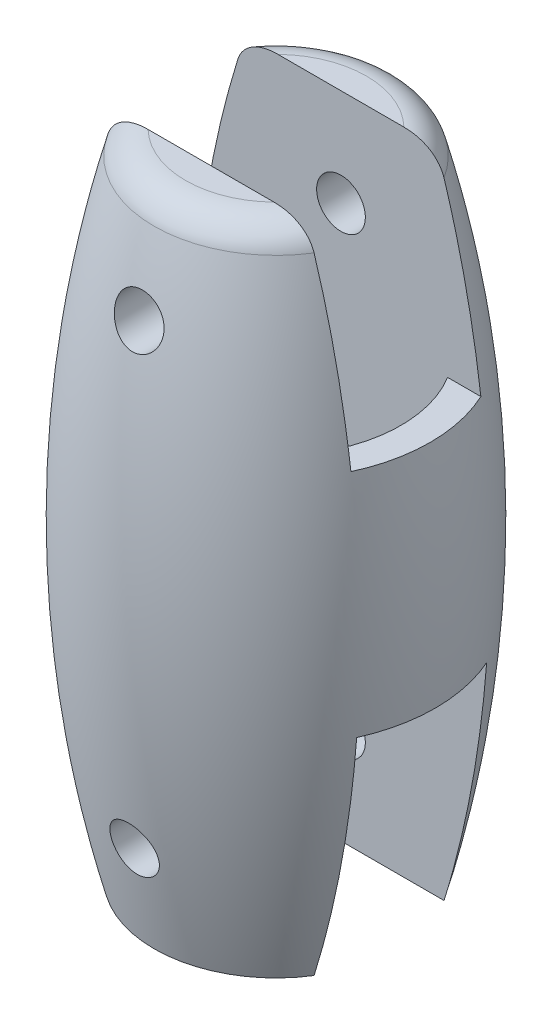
ISO-10303-21;
HEADER;
FILE_DESCRIPTION(('STEP AP214'),'2;1');
FILE_NAME('part.step','',(''),(''),'','','');
FILE_SCHEMA(('AUTOMOTIVE_DESIGN { 1 0 10303 214 1 1 1 1 }'));
ENDSEC;
DATA;
#1=APPLICATION_CONTEXT('core data for automotive mechanical design processes');
#2=APPLICATION_PROTOCOL_DEFINITION('international standard','automotive_design',2000,#1);
#3=PRODUCT_CONTEXT('',#1,'mechanical');
#4=PRODUCT('Part','Part','',(#3));
#5=PRODUCT_RELATED_PRODUCT_CATEGORY('part','',(#4));
#6=PRODUCT_DEFINITION_FORMATION('','',#4);
#7=PRODUCT_DEFINITION_CONTEXT('part definition',#1,'design');
#8=PRODUCT_DEFINITION('design','',#6,#7);
#9=PRODUCT_DEFINITION_SHAPE('','',#8);
#10=(LENGTH_UNIT() NAMED_UNIT(*) SI_UNIT(.MILLI.,.METRE.));
#11=(NAMED_UNIT(*) PLANE_ANGLE_UNIT() SI_UNIT($,.RADIAN.));
#12=(NAMED_UNIT(*) SI_UNIT($,.STERADIAN.) SOLID_ANGLE_UNIT());
#13=UNCERTAINTY_MEASURE_WITH_UNIT(LENGTH_MEASURE(1.E-05),#10,'distance_accuracy_value','');
#14=(GEOMETRIC_REPRESENTATION_CONTEXT(3) GLOBAL_UNCERTAINTY_ASSIGNED_CONTEXT((#13)) GLOBAL_UNIT_ASSIGNED_CONTEXT((#10,
#11,#12)) REPRESENTATION_CONTEXT('',''));
#15=CARTESIAN_POINT('',(0.,0.,0.));
#16=DIRECTION('',(0.,0.,1.));
#17=DIRECTION('',(1.,0.,0.));
#18=AXIS2_PLACEMENT_3D('',#15,#16,#17);
#19=CARTESIAN_POINT('',(-10.0036116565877,8.,0.));
#20=DIRECTION('',(0.,-1.,0.));
#21=DIRECTION('',(0.,0.,-1.));
#22=AXIS2_PLACEMENT_3D('',#19,#20,#21);
#23=PLANE('',#22);
#24=DIRECTION('',(1.,0.,0.));
#25=VECTOR('',#24,1.);
#26=CARTESIAN_POINT('',(-10.0036116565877,8.,4.));
#27=LINE('',#26,#25);
#28=CARTESIAN_POINT('',(-8.61164390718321,8.,4.));
#29=VERTEX_POINT('',#28);
#30=CARTESIAN_POINT('',(-6.56770372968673,8.,4.));
#31=VERTEX_POINT('',#30);
#32=EDGE_CURVE('E170',#29,#31,#27,.T.);
#33=ORIENTED_EDGE('',*,*,#32,.T.);
#34=CARTESIAN_POINT('',(0.,8.,0.));
#35=DIRECTION('',(0.,-1.,0.));
#36=DIRECTION('',(0.,0.,-1.));
#37=AXIS2_PLACEMENT_3D('',#34,#35,#36);
#38=CIRCLE('',#37,7.68991107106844);
#39=CARTESIAN_POINT('',(-6.56770372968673,8.,-4.));
#40=VERTEX_POINT('',#39);
#41=EDGE_CURVE('E162',#31,#40,#38,.T.);
#42=ORIENTED_EDGE('',*,*,#41,.T.);
#43=DIRECTION('',(1.,0.,0.));
#44=VECTOR('',#43,1.);
#45=CARTESIAN_POINT('',(-10.0036116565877,8.,-4.));
#46=LINE('',#45,#44);
#47=CARTESIAN_POINT('',(-8.61164390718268,8.,-4.));
#48=VERTEX_POINT('',#47);
#49=EDGE_CURVE('E191',#48,#40,#46,.T.);
#50=ORIENTED_EDGE('',*,*,#49,.F.);
#51=CARTESIAN_POINT('',(0.,8.,0.));
#52=DIRECTION('',(0.,-1.,0.));
#53=DIRECTION('',(0.,0.,-1.));
#54=AXIS2_PLACEMENT_3D('',#51,#52,#53);
#55=CIRCLE('',#54,9.4952836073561);
#56=EDGE_CURVE('E281',#48,#29,#55,.F.);
#57=ORIENTED_EDGE('',*,*,#56,.T.);
#58=EDGE_LOOP('',(#33,#42,#50,#57));
#59=FACE_BOUND('',#58,.T.);
#60=ADVANCED_FACE('F44',(#59),#23,.F.);
#61=CARTESIAN_POINT('',(-10.0036116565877,-6.,0.));
#62=DIRECTION('',(0.,-1.,0.));
#63=DIRECTION('',(0.,0.,-1.));
#64=AXIS2_PLACEMENT_3D('',#61,#62,#63);
#65=PLANE('',#64);
#66=CARTESIAN_POINT('',(0.,-6.,0.));
#67=DIRECTION('',(0.,-1.,0.));
#68=DIRECTION('',(0.,0.,-1.));
#69=AXIS2_PLACEMENT_3D('',#66,#67,#68);
#70=CIRCLE('',#69,7.68991107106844);
#71=CARTESIAN_POINT('',(-6.56770372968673,-6.,4.));
#72=VERTEX_POINT('',#71);
#73=CARTESIAN_POINT('',(-6.56770372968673,-6.,-4.));
#74=VERTEX_POINT('',#73);
#75=EDGE_CURVE('E12',#72,#74,#70,.T.);
#76=ORIENTED_EDGE('',*,*,#75,.F.);
#77=DIRECTION('',(1.,0.,0.));
#78=VECTOR('',#77,1.);
#79=CARTESIAN_POINT('',(-10.0036116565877,-6.,3.99999999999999));
#80=LINE('',#79,#78);
#81=CARTESIAN_POINT('',(-8.96801705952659,-6.,3.99999999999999));
#82=VERTEX_POINT('',#81);
#83=EDGE_CURVE('E203',#82,#72,#80,.T.);
#84=ORIENTED_EDGE('',*,*,#83,.F.);
#85=CARTESIAN_POINT('',(0.,-6.,0.));
#86=DIRECTION('',(0.,-1.,0.));
#87=DIRECTION('',(0.,0.,-1.));
#88=AXIS2_PLACEMENT_3D('',#85,#86,#87);
#89=CIRCLE('',#88,9.81964001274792);
#90=CARTESIAN_POINT('',(-8.96801705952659,-6.,-4.));
#91=VERTEX_POINT('',#90);
#92=EDGE_CURVE('E272',#91,#82,#89,.F.);
#93=ORIENTED_EDGE('',*,*,#92,.F.);
#94=DIRECTION('',(1.,0.,0.));
#95=VECTOR('',#94,1.);
#96=CARTESIAN_POINT('',(-10.0036116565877,-6.,-4.));
#97=LINE('',#96,#95);
#98=EDGE_CURVE('E207',#91,#74,#97,.T.);
#99=ORIENTED_EDGE('',*,*,#98,.T.);
#100=EDGE_LOOP('',(#76,#84,#93,#99));
#101=FACE_BOUND('',#100,.T.);
#102=ADVANCED_FACE('F339',(#101),#65,.T.);
#103=CARTESIAN_POINT('',(0.,20.,0.));
#104=DIRECTION('',(0.,1.,0.));
#105=DIRECTION('',(0.,0.,1.));
#106=AXIS2_PLACEMENT_3D('',#103,#104,#105);
#107=PLANE('',#106);
#108=DIRECTION('',(1.,0.,0.));
#109=VECTOR('',#108,1.);
#110=CARTESIAN_POINT('',(-10.0036116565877,20.,3.99999999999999));
#111=LINE('',#110,#109);
#112=CARTESIAN_POINT('',(-3.87619658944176,20.,3.99999999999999));
#113=VERTEX_POINT('',#112);
#114=CARTESIAN_POINT('',(3.87619658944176,20.,3.99999999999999));
#115=VERTEX_POINT('',#114);
#116=EDGE_CURVE('E171',#113,#115,#111,.T.);
#117=ORIENTED_EDGE('',*,*,#116,.F.);
#118=CARTESIAN_POINT('',(0.,20.,0.));
#119=DIRECTION('',(0.,1.,0.));
#120=DIRECTION('',(0.,0.,1.));
#121=AXIS2_PLACEMENT_3D('',#118,#119,#120);
#122=CIRCLE('',#121,5.56999999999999);
#123=EDGE_CURVE('E308',#113,#115,#122,.T.);
#124=ORIENTED_EDGE('',*,*,#123,.T.);
#125=EDGE_LOOP('',(#117,#124));
#126=FACE_BOUND('',#125,.T.);
#127=ADVANCED_FACE('F356',(#126),#107,.T.);
#128=CARTESIAN_POINT('',(0.,-20.,0.));
#129=DIRECTION('',(0.,1.,0.));
#130=DIRECTION('',(0.,0.,1.));
#131=AXIS2_PLACEMENT_3D('',#128,#129,#130);
#132=PLANE('',#131);
#133=DIRECTION('',(1.,0.,0.));
#134=VECTOR('',#133,1.);
#135=CARTESIAN_POINT('',(-10.0036116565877,-20.,-3.99999999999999));
#136=LINE('',#135,#134);
#137=CARTESIAN_POINT('',(-6.34428877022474,-20.,-3.99999999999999));
#138=VERTEX_POINT('',#137);
#139=CARTESIAN_POINT('',(6.34428877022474,-20.,-3.99999999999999));
#140=VERTEX_POINT('',#139);
#141=EDGE_CURVE('E195',#138,#140,#136,.T.);
#142=ORIENTED_EDGE('',*,*,#141,.F.);
#143=CARTESIAN_POINT('',(0.,-20.,0.));
#144=DIRECTION('',(0.,1.,0.));
#145=DIRECTION('',(0.,0.,1.));
#146=AXIS2_PLACEMENT_3D('',#143,#144,#145);
#147=CIRCLE('',#146,7.5);
#148=EDGE_CURVE('E247',#140,#138,#147,.T.);
#149=ORIENTED_EDGE('',*,*,#148,.F.);
#150=EDGE_LOOP('',(#142,#149));
#151=FACE_BOUND('',#150,.T.);
#152=ADVANCED_FACE('F358',(#151),#132,.F.);
#153=DIRECTION('',(1.,0.,0.));
#154=VECTOR('',#153,1.);
#155=CARTESIAN_POINT('',(-10.0036116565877,-20.,3.99999999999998));
#156=LINE('',#155,#154);
#157=CARTESIAN_POINT('',(-6.34428877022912,-20.,3.99999999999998));
#158=VERTEX_POINT('',#157);
#159=CARTESIAN_POINT('',(6.34428877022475,-20.,3.99999999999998));
#160=VERTEX_POINT('',#159);
#161=EDGE_CURVE('E199',#158,#160,#156,.T.);
#162=ORIENTED_EDGE('',*,*,#161,.T.);
#163=EDGE_CURVE('E248',#158,#160,#147,.T.);
#164=ORIENTED_EDGE('',*,*,#163,.F.);
#165=EDGE_LOOP('',(#162,#164));
#166=FACE_BOUND('',#165,.T.);
#167=ADVANCED_FACE('F363',(#166),#132,.F.);
#168=CARTESIAN_POINT('',(0.,-0.73775011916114,0.));
#169=DIRECTION('',(0.,1.,0.));
#170=DIRECTION('',(0.,0.,1.));
#171=AXIS2_PLACEMENT_3D('',#168,#169,#170);
#172=DEGENERATE_TOROIDAL_SURFACE('',#171,65.3479990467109,75.3516107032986,.F.);
#173=CARTESIAN_POINT('',(-0.973028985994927,12.858415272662,-8.71267525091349));
#174=CARTESIAN_POINT('',(-1.03895588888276,12.9146124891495,-8.69493879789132));
#175=CARTESIAN_POINT('',(-1.09985024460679,12.9764006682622,-8.67587980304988));
#176=CARTESIAN_POINT('',(-1.20999695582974,13.1092832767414,-8.63624819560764));
#177=CARTESIAN_POINT('',(-1.25923150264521,13.1803916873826,-8.61567332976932));
#178=CARTESIAN_POINT('',(-1.34471604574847,13.3298240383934,-8.5741607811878));
#179=CARTESIAN_POINT('',(-1.38098074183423,13.4081396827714,-8.55322353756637));
#180=CARTESIAN_POINT('',(-1.43960296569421,13.5699466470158,-8.51200336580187));
#181=CARTESIAN_POINT('',(-1.46196514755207,13.6534362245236,-8.49172022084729));
#182=CARTESIAN_POINT('',(-1.49215933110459,13.8239273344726,-8.4525778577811));
#183=CARTESIAN_POINT('',(-1.49989628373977,13.9109481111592,-8.43372871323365));
#184=CARTESIAN_POINT('',(-1.50010159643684,14.0854854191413,-8.3983389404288));
#185=CARTESIAN_POINT('',(-1.49257124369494,14.1730019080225,-8.381798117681));
#186=CARTESIAN_POINT('',(-1.46258623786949,14.3437656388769,-8.35187520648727));
#187=CARTESIAN_POINT('',(-1.4404947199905,14.4270649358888,-8.33842674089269));
#188=CARTESIAN_POINT('',(-1.38219947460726,14.5890046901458,-8.31437315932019));
#189=CARTESIAN_POINT('',(-1.34599802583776,14.6676458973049,-8.30376758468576));
#190=CARTESIAN_POINT('',(-1.26158915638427,14.8157604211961,-8.28555499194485));
#191=CARTESIAN_POINT('',(-1.21372816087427,14.8854224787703,-8.27787546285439));
#192=CARTESIAN_POINT('',(-1.10686708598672,15.0158501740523,-8.26482917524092));
#193=CARTESIAN_POINT('',(-1.04786756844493,15.0766162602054,-8.25946230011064));
#194=CARTESIAN_POINT('',(-0.920988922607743,15.186921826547,-8.25065471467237));
#195=CARTESIAN_POINT('',(-0.853194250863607,15.2365571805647,-8.24719714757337));
#196=CARTESIAN_POINT('',(-0.710237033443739,15.3238495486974,-8.2416756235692));
#197=CARTESIAN_POINT('',(-0.635074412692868,15.3615064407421,-8.23961168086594));
#198=CARTESIAN_POINT('',(-0.479301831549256,15.4238419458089,-8.23645678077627));
#199=CARTESIAN_POINT('',(-0.398678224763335,15.4484865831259,-8.23536836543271));
#200=CARTESIAN_POINT('',(-0.234438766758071,15.4839463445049,-8.23386788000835));
#201=CARTESIAN_POINT('',(-0.150822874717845,15.4947612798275,-8.23345581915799));
#202=CARTESIAN_POINT('',(0.0172651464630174,15.5022643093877,-8.23316564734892));
#203=CARTESIAN_POINT('',(0.101738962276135,15.4989147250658,-8.23328896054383));
#204=CARTESIAN_POINT('',(0.268926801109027,15.4780983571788,-8.23411745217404));
#205=CARTESIAN_POINT('',(0.351640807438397,15.460631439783,-8.23482263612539));
#206=CARTESIAN_POINT('',(0.512986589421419,15.4120710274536,-8.23704106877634));
#207=CARTESIAN_POINT('',(0.591617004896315,15.3809730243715,-8.23855458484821));
#208=CARTESIAN_POINT('',(0.74252409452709,15.3060453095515,-8.24276106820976));
#209=CARTESIAN_POINT('',(0.814800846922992,15.2622157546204,-8.24545402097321));
#210=CARTESIAN_POINT('',(0.950810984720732,15.1631944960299,-8.25246743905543));
#211=CARTESIAN_POINT('',(1.0145595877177,15.1080234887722,-8.25678495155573));
#212=CARTESIAN_POINT('',(1.13185162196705,14.9879056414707,-8.26750161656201));
#213=CARTESIAN_POINT('',(1.18539554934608,14.922959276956,-8.27390066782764));
#214=CARTESIAN_POINT('',(1.28061819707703,14.785483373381,-8.28911975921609));
#215=CARTESIAN_POINT('',(1.32233832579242,14.7129815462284,-8.29793113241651));
#216=CARTESIAN_POINT('',(1.39307609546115,14.5623711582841,-8.31818059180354));
#217=CARTESIAN_POINT('',(1.42209383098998,14.484262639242,-8.32961865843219));
#218=CARTESIAN_POINT('',(1.46684745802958,14.3244513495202,-8.3551415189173));
#219=CARTESIAN_POINT('',(1.48253697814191,14.2427370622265,-8.36923534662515));
#220=CARTESIAN_POINT('',(1.50023842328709,14.0782783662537,-8.39977833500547));
#221=CARTESIAN_POINT('',(1.50224886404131,13.9955338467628,-8.41622775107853));
#222=CARTESIAN_POINT('',(1.49264601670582,13.8295158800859,-8.45135551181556));
#223=CARTESIAN_POINT('',(1.48074813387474,13.7462673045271,-8.47007314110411));
#224=CARTESIAN_POINT('',(1.44335118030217,13.5831782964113,-8.50873850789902));
#225=CARTESIAN_POINT('',(1.41784959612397,13.5033384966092,-8.52868647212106));
#226=CARTESIAN_POINT('',(1.35305498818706,13.346838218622,-8.56953289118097));
#227=CARTESIAN_POINT('',(1.31338368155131,13.2703369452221,-8.59044213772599));
#228=CARTESIAN_POINT('',(1.22144973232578,13.125100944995,-8.63159853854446));
#229=CARTESIAN_POINT('',(1.16918559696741,13.0563671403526,-8.65184561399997));
#230=CARTESIAN_POINT('',(1.05291312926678,12.9281235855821,-8.69070601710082));
#231=CARTESIAN_POINT('',(0.988820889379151,12.8686857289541,-8.709306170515));
#232=CARTESIAN_POINT('',(0.850786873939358,12.7615372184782,-8.7435541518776));
#233=CARTESIAN_POINT('',(0.776847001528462,12.7138243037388,-8.75920254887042));
#234=CARTESIAN_POINT('',(0.623755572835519,12.6331922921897,-8.78602954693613));
#235=CARTESIAN_POINT('',(0.544858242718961,12.5998349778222,-8.79733919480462));
#236=CARTESIAN_POINT('',(0.382069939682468,12.5469555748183,-8.81540856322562));
#237=CARTESIAN_POINT('',(0.298181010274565,12.5274278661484,-8.82217013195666));
#238=CARTESIAN_POINT('',(0.132397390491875,12.5036293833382,-8.83042687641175));
#239=CARTESIAN_POINT('',(0.0506189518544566,12.4986317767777,-8.83217288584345));
#240=CARTESIAN_POINT('',(-0.112638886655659,12.5020093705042,-8.83099648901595));
#241=CARTESIAN_POINT('',(-0.194118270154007,12.510385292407,-8.82807383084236));
#242=CARTESIAN_POINT('',(-0.352532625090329,12.5398391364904,-8.81788207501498));
#243=CARTESIAN_POINT('',(-0.429528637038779,12.5606264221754,-8.81071245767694));
#244=CARTESIAN_POINT('',(-0.578812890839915,12.6139094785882,-8.79257144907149));
#245=CARTESIAN_POINT('',(-0.651105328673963,12.64639463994,-8.78160350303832));
#246=CARTESIAN_POINT('',(-0.765325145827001,12.7089014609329,-8.76087193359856));
#247=CARTESIAN_POINT('',(-0.809109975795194,12.7358923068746,-8.75200280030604));
#248=CARTESIAN_POINT('',(-0.89352290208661,12.7940790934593,-8.73313416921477));
#249=CARTESIAN_POINT('',(-0.934151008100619,12.8252750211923,-8.72313467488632));
#250=CARTESIAN_POINT('',(-0.973028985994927,12.858415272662,-8.71267525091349));
#251=B_SPLINE_CURVE_WITH_KNOTS('',3,(#173,#174,#175,#176,#177,#178,#179,#180,#181,#182,#183,
#184,#185,#186,#187,#188,#189,#190,#191,#192,#193,#194,#195,#196,#197,#198,#199,#200,#201,#202,
#203,#204,#205,#206,#207,#208,#209,#210,#211,#212,#213,#214,#215,#216,#217,#218,#219,#220,#221,
#222,#223,#224,#225,#226,#227,#228,#229,#230,#231,#232,#233,#234,#235,#236,#237,#238,#239,#240,
#241,#242,#243,#244,#245,#246,#247,#248,#249,#250),.UNSPECIFIED.,.T.,.F.,(4,2,2,2,2,2,2,2,2,2,2,
2,2,2,2,2,2,2,2,2,2,2,2,2,2,2,2,2,2,2,2,2,2,2,2,2,2,2,4),(0.,0.265081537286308,
0.530565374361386,0.795747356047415,1.06084051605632,1.32765066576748,1.59443832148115,
1.85481234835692,2.11514434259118,2.36852438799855,2.62189165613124,2.87298470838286,
3.1240803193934,3.37582835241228,3.62757982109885,3.88000138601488,4.13242534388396,
4.38493284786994,4.63743724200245,4.88948488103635,5.14152026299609,5.39266176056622,
5.64380138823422,5.89581124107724,6.14784843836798,6.40513447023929,6.66246805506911,
6.9272596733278,7.19208269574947,7.45886208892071,7.72558999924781,7.98347048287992,
8.24124610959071,8.48588450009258,8.73053609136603,8.96967177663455,9.20859112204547,
9.36491373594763,9.52123586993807),.UNSPECIFIED.);
#252=CARTESIAN_POINT('',(-0.973028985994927,12.858415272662,-8.71267525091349));
#253=VERTEX_POINT('',#252);
#254=EDGE_CURVE('E180',#253,#253,#251,.T.);
#255=ORIENTED_EDGE('',*,*,#254,.F.);
#256=EDGE_LOOP('',(#255));
#257=FACE_BOUND('',#256,.T.);
#258=CARTESIAN_POINT('',(-1.13444382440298,13.0186554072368,8.66330535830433));
#259=CARTESIAN_POINT('',(-1.08019356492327,12.9559448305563,8.68215267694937));
#260=CARTESIAN_POINT('',(-1.02059966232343,12.8975816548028,8.7002545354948));
#261=CARTESIAN_POINT('',(-0.892097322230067,12.7912302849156,8.73395816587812));
#262=CARTESIAN_POINT('',(-0.82318328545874,12.7432483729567,8.74955842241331));
#263=CARTESIAN_POINT('',(-0.677632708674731,12.6591466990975,8.77732179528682));
#264=CARTESIAN_POINT('',(-0.600982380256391,12.623048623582,8.7894786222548));
#265=CARTESIAN_POINT('',(-0.442209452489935,12.5641679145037,8.80949151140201));
#266=CARTESIAN_POINT('',(-0.360088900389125,12.5413803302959,8.81734917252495));
#267=CARTESIAN_POINT('',(-0.195937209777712,12.510595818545,8.82800061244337));
#268=CARTESIAN_POINT('',(-0.114013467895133,12.5020866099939,8.83096970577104));
#269=CARTESIAN_POINT('',(0.0501513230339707,12.4985931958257,8.83218620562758));
#270=CARTESIAN_POINT('',(0.132392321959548,12.5036069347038,8.83043432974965));
#271=CARTESIAN_POINT('',(0.292430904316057,12.5266236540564,8.82244947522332));
#272=CARTESIAN_POINT('',(0.370288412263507,12.5442578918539,8.81634372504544));
#273=CARTESIAN_POINT('',(0.521854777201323,12.5914654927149,8.80018867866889));
#274=CARTESIAN_POINT('',(0.595563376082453,12.6210395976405,8.79013913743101));
#275=CARTESIAN_POINT('',(0.738293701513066,12.691800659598,8.76648846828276));
#276=CARTESIAN_POINT('',(0.807202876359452,12.7331932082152,8.75282481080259));
#277=CARTESIAN_POINT('',(0.937178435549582,12.8260827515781,8.7228293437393));
#278=CARTESIAN_POINT('',(0.99824303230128,12.8775820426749,8.7064969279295));
#279=CARTESIAN_POINT('',(1.11394392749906,12.9919999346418,8.67118898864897));
#280=CARTESIAN_POINT('',(1.16812525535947,13.0553510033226,8.65212373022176));
#281=CARTESIAN_POINT('',(1.26517767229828,13.1899305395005,8.61301263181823));
#282=CARTESIAN_POINT('',(1.30804603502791,13.2611608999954,8.59296655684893));
#283=CARTESIAN_POINT('',(1.38291240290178,13.4126591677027,8.55206979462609));
#284=CARTESIAN_POINT('',(1.41441376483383,13.4931730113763,8.53121862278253));
#285=CARTESIAN_POINT('',(1.46318753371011,13.6586461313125,8.49050362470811));
#286=CARTESIAN_POINT('',(1.48045938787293,13.7436055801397,8.47063983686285));
#287=CARTESIAN_POINT('',(1.50014770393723,13.9158340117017,8.43270877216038));
#288=CARTESIAN_POINT('',(1.50253145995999,14.0031076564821,8.41464553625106));
#289=CARTESIAN_POINT('',(1.4920438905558,14.1772211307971,8.38101865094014));
#290=CARTESIAN_POINT('',(1.47917515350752,14.2640610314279,8.36545457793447));
#291=CARTESIAN_POINT('',(1.43888643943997,14.4323024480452,8.33758892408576));
#292=CARTESIAN_POINT('',(1.41186826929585,14.5137874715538,8.32521067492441));
#293=CARTESIAN_POINT('',(1.3441521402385,14.6712659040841,8.30326355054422));
#294=CARTESIAN_POINT('',(1.30345606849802,14.7472600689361,8.29369428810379));
#295=CARTESIAN_POINT('',(1.21064028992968,14.8896039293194,8.27738991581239));
#296=CARTESIAN_POINT('',(1.15882125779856,14.9561426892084,8.27059175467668));
#297=CARTESIAN_POINT('',(1.04466363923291,15.0796997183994,8.2591555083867));
#298=CARTESIAN_POINT('',(0.98232540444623,15.1367183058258,8.25451735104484));
#299=CARTESIAN_POINT('',(0.849308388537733,15.2392273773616,8.24697529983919));
#300=CARTESIAN_POINT('',(0.778681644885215,15.2847846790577,8.24406121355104));
#301=CARTESIAN_POINT('',(0.630788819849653,15.3634964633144,8.23947092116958));
#302=CARTESIAN_POINT('',(0.553522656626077,15.3966507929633,8.23779473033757));
#303=CARTESIAN_POINT('',(0.394274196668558,15.449694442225,8.23529236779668));
#304=CARTESIAN_POINT('',(0.3122775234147,15.4695407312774,8.23446894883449));
#305=CARTESIAN_POINT('',(0.146115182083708,15.4952317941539,8.23342871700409));
#306=CARTESIAN_POINT('',(0.0619494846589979,15.5010763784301,8.23321191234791));
#307=CARTESIAN_POINT('',(-0.106359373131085,15.498594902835,8.23330747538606));
#308=CARTESIAN_POINT('',(-0.190502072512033,15.4902374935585,8.2336210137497));
#309=CARTESIAN_POINT('',(-0.356190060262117,15.4595299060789,8.23489039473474));
#310=CARTESIAN_POINT('',(-0.437735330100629,15.4371796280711,8.23584624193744));
#311=CARTESIAN_POINT('',(-0.595909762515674,15.3791260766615,8.23868291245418));
#312=CARTESIAN_POINT('',(-0.672538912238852,15.3434227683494,8.24056373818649));
#313=CARTESIAN_POINT('',(-0.818693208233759,15.2596958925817,8.24565900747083));
#314=CARTESIAN_POINT('',(-0.888218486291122,15.211672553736,8.24887342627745));
#315=CARTESIAN_POINT('',(-1.01802882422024,15.1048380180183,8.25709132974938));
#316=CARTESIAN_POINT('',(-1.07833463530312,15.046051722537,8.26209070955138));
#317=CARTESIAN_POINT('',(-1.1881877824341,14.9193683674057,8.27431196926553));
#318=CARTESIAN_POINT('',(-1.2377356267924,14.8514717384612,8.2815337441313));
#319=CARTESIAN_POINT('',(-1.32457507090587,14.7088371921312,8.2984872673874));
#320=CARTESIAN_POINT('',(-1.36190559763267,14.6341219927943,8.30821086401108));
#321=CARTESIAN_POINT('',(-1.42358902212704,14.4798886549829,8.33030135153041));
#322=CARTESIAN_POINT('',(-1.44794215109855,14.4003706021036,8.34266819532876));
#323=CARTESIAN_POINT('',(-1.48327616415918,14.2383464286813,8.37001918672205));
#324=CARTESIAN_POINT('',(-1.49417588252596,14.1558252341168,8.38501860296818));
#325=CARTESIAN_POINT('',(-1.50225186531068,13.990533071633,8.41723682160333));
#326=CARTESIAN_POINT('',(-1.4994240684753,13.907762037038,8.43445627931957));
#327=CARTESIAN_POINT('',(-1.4800853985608,13.7421988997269,8.4709820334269));
#328=CARTESIAN_POINT('',(-1.46324738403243,13.6594540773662,8.49032853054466));
#329=CARTESIAN_POINT('',(-1.41606556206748,13.4981938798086,8.52996035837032));
#330=CARTESIAN_POINT('',(-1.38572996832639,13.4196759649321,8.55024511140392));
#331=CARTESIAN_POINT('',(-1.32061124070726,13.2856947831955,8.58629638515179));
#332=CARTESIAN_POINT('',(-1.28833271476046,13.2289977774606,8.60206066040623));
#333=CARTESIAN_POINT('',(-1.21662342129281,13.1201858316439,8.63313937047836));
#334=CARTESIAN_POINT('',(-1.17719264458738,13.0680708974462,8.64845380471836));
#335=CARTESIAN_POINT('',(-1.13444382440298,13.0186554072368,8.66330535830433));
#336=B_SPLINE_CURVE_WITH_KNOTS('',3,(#258,#259,#260,#261,#262,#263,#264,#265,#266,#267,#268,
#269,#270,#271,#272,#273,#274,#275,#276,#277,#278,#279,#280,#281,#282,#283,#284,#285,#286,#287,
#288,#289,#290,#291,#292,#293,#294,#295,#296,#297,#298,#299,#300,#301,#302,#303,#304,#305,#306,
#307,#308,#309,#310,#311,#312,#313,#314,#315,#316,#317,#318,#319,#320,#321,#322,#323,#324,#325,
#326,#327,#328,#329,#330,#331,#332,#333,#334,#335),.UNSPECIFIED.,.T.,.F.,(4,2,2,2,2,2,2,2,2,2,2,
2,2,2,2,2,2,2,2,2,2,2,2,2,2,2,2,2,2,2,2,2,2,2,2,2,2,2,4),(0.,0.254877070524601,
0.509907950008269,0.765401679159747,1.02080032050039,1.26682278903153,1.51280786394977,
1.75188472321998,1.99097643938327,2.23451125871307,2.47810147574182,2.73349711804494,
2.98895425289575,3.25450873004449,3.52007352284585,3.78622149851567,4.05232431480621,
4.31125034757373,4.5701406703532,4.82275831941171,5.07536752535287,5.32646802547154,
5.57757162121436,5.82948327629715,6.0813983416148,6.33387020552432,6.58634387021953,
6.83881819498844,7.0912878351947,7.34318057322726,7.59506140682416,7.84613169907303,
8.09719751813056,8.34977075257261,8.60241871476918,8.86113724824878,9.11969855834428,
9.32053962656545,9.52138095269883),.UNSPECIFIED.);
#337=CARTESIAN_POINT('',(-1.13444382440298,13.0186554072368,8.66330535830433));
#338=VERTEX_POINT('',#337);
#339=EDGE_CURVE('E546',#338,#338,#336,.T.);
#340=ORIENTED_EDGE('',*,*,#339,.F.);
#341=EDGE_LOOP('',(#340));
#342=FACE_BOUND('',#341,.T.);
#343=CARTESIAN_POINT('',(-1.1049573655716,-15.014430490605,-8.56781035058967));
#344=CARTESIAN_POINT('',(-1.16165478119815,-14.952668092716,-8.57251500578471));
#345=CARTESIAN_POINT('',(-1.21315879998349,-14.8861432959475,-8.57819297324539));
#346=CARTESIAN_POINT('',(-1.30429177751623,-14.7455560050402,-8.59185557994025));
#347=CARTESIAN_POINT('',(-1.34390935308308,-14.6714863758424,-8.59984241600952));
#348=CARTESIAN_POINT('',(-1.41015738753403,-14.518100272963,-8.61830792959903));
#349=CARTESIAN_POINT('',(-1.43679697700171,-14.4387875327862,-8.62878484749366));
#350=CARTESIAN_POINT('',(-1.47650842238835,-14.2772094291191,-8.65220476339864));
#351=CARTESIAN_POINT('',(-1.4895824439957,-14.1949445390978,-8.6651473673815));
#352=CARTESIAN_POINT('',(-1.50203757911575,-14.029131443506,-8.69334770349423));
#353=CARTESIAN_POINT('',(-1.50131287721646,-13.9455782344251,-8.70862243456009));
#354=CARTESIAN_POINT('',(-1.48611648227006,-13.7800755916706,-8.7409252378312));
#355=CARTESIAN_POINT('',(-1.47164251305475,-13.6981264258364,-8.75795359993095));
#356=CARTESIAN_POINT('',(-1.42895160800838,-13.5360029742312,-8.79351816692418));
#357=CARTESIAN_POINT('',(-1.40040937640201,-13.4559201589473,-8.81208095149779));
#358=CARTESIAN_POINT('',(-1.3302709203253,-13.3017493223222,-8.84947202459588));
#359=CARTESIAN_POINT('',(-1.28867267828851,-13.2276622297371,-8.86830035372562));
#360=CARTESIAN_POINT('',(-1.19259673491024,-13.0861276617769,-8.90559850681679));
#361=CARTESIAN_POINT('',(-1.13789412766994,-13.0188290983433,-8.92405517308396));
#362=CARTESIAN_POINT('',(-1.01743280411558,-12.8944112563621,-8.95916643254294));
#363=CARTESIAN_POINT('',(-0.951674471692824,-12.8372916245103,-8.97582108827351));
#364=CARTESIAN_POINT('',(-0.811737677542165,-12.7356980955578,-9.00607106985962));
#365=CARTESIAN_POINT('',(-0.737679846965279,-12.6910693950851,-9.01970336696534));
#366=CARTESIAN_POINT('',(-0.582518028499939,-12.6150342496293,-9.04325154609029));
#367=CARTESIAN_POINT('',(-0.501416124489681,-12.5836239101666,-9.05316852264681));
#368=CARTESIAN_POINT('',(-0.33812185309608,-12.536239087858,-9.06823724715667));
#369=CARTESIAN_POINT('',(-0.256118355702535,-12.5196716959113,-9.07357164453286));
#370=CARTESIAN_POINT('',(-0.0903385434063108,-12.5004008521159,-9.07978338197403));
#371=CARTESIAN_POINT('',(-0.00656265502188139,-12.4976941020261,-9.08066178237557));
#372=CARTESIAN_POINT('',(0.157325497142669,-12.5060952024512,-9.07794804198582));
#373=CARTESIAN_POINT('',(0.237464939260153,-12.516732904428,-9.07450804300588));
#374=CARTESIAN_POINT('',(0.394738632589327,-12.5506371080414,-9.06364948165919));
#375=CARTESIAN_POINT('',(0.471872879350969,-12.5739036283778,-9.05623091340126));
#376=CARTESIAN_POINT('',(0.621421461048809,-12.632405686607,-9.03785285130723));
#377=CARTESIAN_POINT('',(0.693811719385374,-12.6676973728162,-9.02687675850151));
#378=CARTESIAN_POINT('',(0.831676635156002,-12.7491097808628,-9.00206569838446));
#379=CARTESIAN_POINT('',(0.897150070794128,-12.7952324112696,-8.98823022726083));
#380=CARTESIAN_POINT('',(1.02202138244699,-12.898950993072,-8.95791144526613));
#381=CARTESIAN_POINT('',(1.08109088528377,-12.9569184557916,-8.94134706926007));
#382=CARTESIAN_POINT('',(1.18877704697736,-13.0815261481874,-8.90690206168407));
#383=CARTESIAN_POINT('',(1.23739134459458,-13.1481683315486,-8.88902113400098));
#384=CARTESIAN_POINT('',(1.32471472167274,-13.291183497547,-8.85215131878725));
#385=CARTESIAN_POINT('',(1.36296092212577,-13.367835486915,-8.83314647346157));
#386=CARTESIAN_POINT('',(1.42591326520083,-13.5266416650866,-8.79567508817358));
#387=CARTESIAN_POINT('',(1.45061829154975,-13.6087963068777,-8.77720859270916));
#388=CARTESIAN_POINT('',(1.48588044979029,-13.7772201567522,-8.74149484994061));
#389=CARTESIAN_POINT('',(1.49629895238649,-13.8635213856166,-8.72426106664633));
#390=CARTESIAN_POINT('',(1.50205200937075,-14.0370225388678,-8.69191506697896));
#391=CARTESIAN_POINT('',(1.49738844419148,-14.1242223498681,-8.67680258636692));
#392=CARTESIAN_POINT('',(1.47315709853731,-14.2951370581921,-8.64944340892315));
#393=CARTESIAN_POINT('',(1.45389398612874,-14.3788867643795,-8.63714473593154));
#394=CARTESIAN_POINT('',(1.40121410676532,-14.5421766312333,-8.61520740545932));
#395=CARTESIAN_POINT('',(1.36779928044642,-14.6217173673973,-8.60556838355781));
#396=CARTESIAN_POINT('',(1.28863794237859,-14.772321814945,-8.58906293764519));
#397=CARTESIAN_POINT('',(1.243197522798,-14.8435400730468,-8.58213704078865));
#398=CARTESIAN_POINT('',(1.14091215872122,-14.9774544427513,-8.57046118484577));
#399=CARTESIAN_POINT('',(1.08406765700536,-15.0401508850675,-8.56571114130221));
#400=CARTESIAN_POINT('',(0.961062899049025,-15.154716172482,-8.55799914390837));
#401=CARTESIAN_POINT('',(0.894976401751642,-15.2066633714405,-8.55502392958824));
#402=CARTESIAN_POINT('',(0.75503363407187,-15.2988239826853,-8.55034645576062));
#403=CARTESIAN_POINT('',(0.681177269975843,-15.3390372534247,-8.54864421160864));
#404=CARTESIAN_POINT('',(0.527556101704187,-15.4066800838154,-8.54608141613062));
#405=CARTESIAN_POINT('',(0.447774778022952,-15.4340722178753,-8.54522332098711));
#406=CARTESIAN_POINT('',(0.284752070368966,-15.4751208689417,-8.54402870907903));
#407=CARTESIAN_POINT('',(0.201510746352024,-15.4887776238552,-8.54369218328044));
#408=CARTESIAN_POINT('',(0.0337033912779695,-15.5019872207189,-8.54336563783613));
#409=CARTESIAN_POINT('',(-0.050865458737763,-15.5015042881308,-8.54337649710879));
#410=CARTESIAN_POINT('',(-0.218742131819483,-15.486356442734,-8.54375329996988));
#411=CARTESIAN_POINT('',(-0.302049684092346,-15.4716885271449,-8.54411931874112));
#412=CARTESIAN_POINT('',(-0.465079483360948,-15.4285722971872,-8.54539471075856));
#413=CARTESIAN_POINT('',(-0.544798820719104,-15.4001130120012,-8.5463045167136));
#414=CARTESIAN_POINT('',(-0.698258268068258,-15.3302366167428,-8.54900944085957));
#415=CARTESIAN_POINT('',(-0.772004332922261,-15.288832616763,-8.55080366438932));
#416=CARTESIAN_POINT('',(-0.889818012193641,-15.2089704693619,-8.55495235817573));
#417=CARTESIAN_POINT('',(-0.936003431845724,-15.1735716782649,-8.55696119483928));
#418=CARTESIAN_POINT('',(-1.02394184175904,-15.0976866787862,-8.56176122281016));
#419=CARTESIAN_POINT('',(-1.06569483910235,-15.0572004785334,-8.56455241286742));
#420=CARTESIAN_POINT('',(-1.1049573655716,-15.014430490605,-8.56781035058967));
#421=B_SPLINE_CURVE_WITH_KNOTS('',3,(#343,#344,#345,#346,#347,#348,#349,#350,#351,#352,#353,
#354,#355,#356,#357,#358,#359,#360,#361,#362,#363,#364,#365,#366,#367,#368,#369,#370,#371,#372,
#373,#374,#375,#376,#377,#378,#379,#380,#381,#382,#383,#384,#385,#386,#387,#388,#389,#390,#391,
#392,#393,#394,#395,#396,#397,#398,#399,#400,#401,#402,#403,#404,#405,#406,#407,#408,#409,#410,
#411,#412,#413,#414,#415,#416,#417,#418,#419,#420),.UNSPECIFIED.,.T.,.F.,(4,2,2,2,2,2,2,2,2,2,2,
2,2,2,2,2,2,2,2,2,2,2,2,2,2,2,2,2,2,2,2,2,2,2,2,2,2,2,4),(0.,0.251704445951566,
0.503649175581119,0.755416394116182,1.00714341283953,1.26080157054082,1.51450172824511,
1.77436462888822,2.03426770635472,2.29899900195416,2.56372110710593,2.82500035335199,
3.08620256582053,3.33643406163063,3.58660601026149,3.82820638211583,4.06980711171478,
4.31255175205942,4.55533919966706,4.80741745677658,5.05955258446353,5.32156941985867,
5.58360785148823,5.84817139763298,6.1127019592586,6.37185920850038,6.63098093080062,
6.88405348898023,7.13711622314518,7.38826373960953,7.63941428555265,7.89129345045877,
8.14316825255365,8.3956803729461,8.64824595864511,8.90101278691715,9.15352444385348,
9.32782812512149,9.50213152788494),.UNSPECIFIED.);
#422=CARTESIAN_POINT('',(-1.1049573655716,-15.014430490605,-8.56781035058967));
#423=VERTEX_POINT('',#422);
#424=EDGE_CURVE('E291',#423,#423,#421,.T.);
#425=ORIENTED_EDGE('',*,*,#424,.F.);
#426=EDGE_LOOP('',(#425));
#427=FACE_BOUND('',#426,.T.);
#428=CARTESIAN_POINT('',(-1.04033937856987,-15.0805988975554,8.56300369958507));
#429=CARTESIAN_POINT('',(-0.979844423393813,-15.1388352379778,8.55897819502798));
#430=CARTESIAN_POINT('',(-0.914380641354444,-15.1920437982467,8.55584317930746));
#431=CARTESIAN_POINT('',(-0.775388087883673,-15.2868030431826,8.55089804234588));
#432=CARTESIAN_POINT('',(-0.701851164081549,-15.3283417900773,8.54908927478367));
#433=CARTESIAN_POINT('',(-0.548879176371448,-15.3985013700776,8.5463606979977));
#434=CARTESIAN_POINT('',(-0.469447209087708,-15.4271289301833,8.54544042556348));
#435=CARTESIAN_POINT('',(-0.306924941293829,-15.4706713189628,8.54414653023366));
#436=CARTESIAN_POINT('',(-0.223835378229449,-15.485588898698,8.54377279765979));
#437=CARTESIAN_POINT('',(-0.0561788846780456,-15.5013145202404,8.54338082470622));
#438=CARTESIAN_POINT('',(0.0283904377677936,-15.5020970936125,8.54336322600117));
#439=CARTESIAN_POINT('',(0.196464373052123,-15.489464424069,8.54367492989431));
#440=CARTESIAN_POINT('',(0.279968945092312,-15.476048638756,8.54400424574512));
#441=CARTESIAN_POINT('',(0.443578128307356,-15.4353908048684,8.54518256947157));
#442=CARTESIAN_POINT('',(0.523681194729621,-15.4081425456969,8.54603181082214));
#443=CARTESIAN_POINT('',(0.678167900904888,-15.340595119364,8.54857967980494));
#444=CARTESIAN_POINT('',(0.752551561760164,-15.3002960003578,8.55027830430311));
#445=CARTESIAN_POINT('',(0.893395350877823,-15.2078624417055,8.55495672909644));
#446=CARTESIAN_POINT('',(0.959864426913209,-15.1557415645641,8.5579350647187));
#447=CARTESIAN_POINT('',(1.08307809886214,-15.0411621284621,8.56563820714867));
#448=CARTESIAN_POINT('',(1.13982311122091,-14.978704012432,8.57036293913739));
#449=CARTESIAN_POINT('',(1.24180210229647,-14.8455386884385,8.58195237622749));
#450=CARTESIAN_POINT('',(1.28707637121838,-14.7748616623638,8.58880939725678));
#451=CARTESIAN_POINT('',(1.36514510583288,-14.6271801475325,8.60494594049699));
#452=CARTESIAN_POINT('',(1.39793990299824,-14.5501758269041,8.61422539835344));
#453=CARTESIAN_POINT('',(1.45023235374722,-14.3921164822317,8.63528641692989));
#454=CARTESIAN_POINT('',(1.46973133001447,-14.3110618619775,8.64706772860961));
#455=CARTESIAN_POINT('',(1.49505889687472,-14.1472163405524,8.67298368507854));
#456=CARTESIAN_POINT('',(1.50088651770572,-14.0644253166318,8.68711849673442));
#457=CARTESIAN_POINT('',(1.49888078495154,-13.8981909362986,8.71758190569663));
#458=CARTESIAN_POINT('',(1.4908501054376,-13.814755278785,8.73393908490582));
#459=CARTESIAN_POINT('',(1.46113451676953,-13.6506544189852,8.76808734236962));
#460=CARTESIAN_POINT('',(1.43944745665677,-13.5699896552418,8.78587864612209));
#461=CARTESIAN_POINT('',(1.38236519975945,-13.411492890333,8.82259573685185));
#462=CARTESIAN_POINT('',(1.34663432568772,-13.3337856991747,8.84153888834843));
#463=CARTESIAN_POINT('',(1.26248214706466,-13.1855012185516,8.87918713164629));
#464=CARTESIAN_POINT('',(1.21405921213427,-13.1149248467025,8.89789219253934));
#465=CARTESIAN_POINT('',(1.10507185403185,-12.9820165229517,8.93426595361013));
#466=CARTESIAN_POINT('',(1.04436646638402,-12.9197956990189,8.95191921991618));
#467=CARTESIAN_POINT('',(0.912749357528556,-12.806507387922,8.98485953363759));
#468=CARTESIAN_POINT('',(0.841838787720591,-12.7554386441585,9.00014684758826));
#469=CARTESIAN_POINT('',(0.6934361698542,-12.6671722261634,9.02702759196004));
#470=CARTESIAN_POINT('',(0.616129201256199,-12.6296870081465,9.03869673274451));
#471=CARTESIAN_POINT('',(0.455809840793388,-12.5683589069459,9.05798445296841));
#472=CARTESIAN_POINT('',(0.372799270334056,-12.544511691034,9.06560431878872));
#473=CARTESIAN_POINT('',(0.207379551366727,-12.5121217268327,9.07599442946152));
#474=CARTESIAN_POINT('',(0.125105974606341,-12.5029491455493,9.07896412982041));
#475=CARTESIAN_POINT('',(-0.0398632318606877,-12.4982621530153,9.08047872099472));
#476=CARTESIAN_POINT('',(-0.122558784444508,-12.502745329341,9.07902439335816));
#477=CARTESIAN_POINT('',(-0.283785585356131,-12.524900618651,9.07189055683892));
#478=CARTESIAN_POINT('',(-0.362369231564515,-12.5422300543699,9.06632083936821));
#479=CARTESIAN_POINT('',(-0.515439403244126,-12.5890677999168,9.05145192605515));
#480=CARTESIAN_POINT('',(-0.589925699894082,-12.6185767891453,9.04215252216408));
#481=CARTESIAN_POINT('',(-0.734010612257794,-12.6893618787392,9.02023413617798));
#482=CARTESIAN_POINT('',(-0.803514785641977,-12.7308144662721,9.00756560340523));
#483=CARTESIAN_POINT('',(-0.934656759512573,-12.8240352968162,8.97973482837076));
#484=CARTESIAN_POINT('',(-0.996292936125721,-12.8758056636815,8.96457207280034));
#485=CARTESIAN_POINT('',(-1.11271382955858,-12.9906288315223,8.93190888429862));
#486=CARTESIAN_POINT('',(-1.16710019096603,-13.054065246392,8.91433685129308));
#487=CARTESIAN_POINT('',(-1.26453713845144,-13.1889088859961,8.87834606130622));
#488=CARTESIAN_POINT('',(-1.30758536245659,-13.2603177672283,8.8599271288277));
#489=CARTESIAN_POINT('',(-1.3825314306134,-13.411796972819,8.82255097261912));
#490=CARTESIAN_POINT('',(-1.41400671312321,-13.4920775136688,8.80359642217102));
#491=CARTESIAN_POINT('',(-1.46280198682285,-13.6570572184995,8.76670521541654));
#492=CARTESIAN_POINT('',(-1.48012209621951,-13.7417563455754,8.74876855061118));
#493=CARTESIAN_POINT('',(-1.49997527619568,-13.9132514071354,8.71469246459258));
#494=CARTESIAN_POINT('',(-1.50250577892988,-14.0000477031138,8.69855335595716));
#495=CARTESIAN_POINT('',(-1.49248757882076,-14.1732000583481,8.66865340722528));
#496=CARTESIAN_POINT('',(-1.47993808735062,-14.259556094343,8.65489269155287));
#497=CARTESIAN_POINT('',(-1.44041472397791,-14.4271341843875,8.63036677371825));
#498=CARTESIAN_POINT('',(-1.4137894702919,-14.508429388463,8.61953835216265));
#499=CARTESIAN_POINT('',(-1.34698454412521,-14.6655070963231,8.60050232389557));
#500=CARTESIAN_POINT('',(-1.30682007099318,-14.7412956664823,8.59229179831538));
#501=CARTESIAN_POINT('',(-1.22913863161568,-14.8617240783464,8.58055173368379));
#502=CARTESIAN_POINT('',(-1.19497800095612,-14.9085018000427,8.57636740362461));
#503=CARTESIAN_POINT('',(-1.12144632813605,-14.9978502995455,8.56898200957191));
#504=CARTESIAN_POINT('',(-1.08207536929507,-15.0404211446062,8.56578092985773));
#505=CARTESIAN_POINT('',(-1.04033937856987,-15.0805988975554,8.56300369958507));
#506=B_SPLINE_CURVE_WITH_KNOTS('',3,(#428,#429,#430,#431,#432,#433,#434,#435,#436,#437,#438,
#439,#440,#441,#442,#443,#444,#445,#446,#447,#448,#449,#450,#451,#452,#453,#454,#455,#456,#457,
#458,#459,#460,#461,#462,#463,#464,#465,#466,#467,#468,#469,#470,#471,#472,#473,#474,#475,#476,
#477,#478,#479,#480,#481,#482,#483,#484,#485,#486,#487,#488,#489,#490,#491,#492,#493,#494,#495,
#496,#497,#498,#499,#500,#501,#502,#503,#504,#505),.UNSPECIFIED.,.T.,.F.,(4,2,2,2,2,2,2,2,2,2,2,
2,2,2,2,2,2,2,2,2,2,2,2,2,2,2,2,2,2,2,2,2,2,2,2,2,2,2,4),(0.,0.251990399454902,
0.504237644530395,0.75635331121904,1.00841837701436,1.26093756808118,1.51346640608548,
1.76610872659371,2.01875011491,2.27110311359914,2.52344530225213,2.77488846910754,
3.02632495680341,3.27773642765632,3.529165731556,3.78420469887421,4.03928384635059,
4.30087200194,4.56249377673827,4.82730842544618,5.09209321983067,5.35089063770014,
5.60960579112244,5.85688643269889,6.10412339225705,6.34499235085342,6.58587474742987,
6.8305171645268,7.07520999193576,7.33021788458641,7.58527886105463,7.84889733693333,
8.11251361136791,8.3761756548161,8.63985148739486,8.89728326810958,9.15442700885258,
9.32828013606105,9.50213048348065),.UNSPECIFIED.);
#507=CARTESIAN_POINT('',(-1.04033937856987,-15.0805988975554,8.56300369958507));
#508=VERTEX_POINT('',#507);
#509=EDGE_CURVE('E563',#508,#508,#506,.T.);
#510=ORIENTED_EDGE('',*,*,#509,.F.);
#511=EDGE_LOOP('',(#510));
#512=FACE_BOUND('',#511,.T.);
#513=CARTESIAN_POINT('',(0.,28.7363107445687,3.99999999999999));
#514=CARTESIAN_POINT('',(0.105576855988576,28.7362897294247,3.99999999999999));
#515=CARTESIAN_POINT('',(0.211268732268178,28.7263272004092,3.99999999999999));
#516=CARTESIAN_POINT('',(0.419259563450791,28.68788742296,3.99999999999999));
#517=CARTESIAN_POINT('',(0.521550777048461,28.6593706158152,3.99999999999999));
#518=CARTESIAN_POINT('',(0.755761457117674,28.5744477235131,3.99999999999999));
#519=CARTESIAN_POINT('',(0.88535640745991,28.5117434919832,3.99999999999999));
#520=CARTESIAN_POINT('',(1.133390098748,28.3673136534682,3.99999999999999));
#521=CARTESIAN_POINT('',(1.25179794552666,28.2855374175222,3.99999999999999));
#522=CARTESIAN_POINT('',(1.50328014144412,28.0902238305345,3.99999999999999));
#523=CARTESIAN_POINT('',(1.63394989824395,27.9736462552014,3.99999999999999));
#524=CARTESIAN_POINT('',(1.88367814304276,27.7285155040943,3.99999999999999));
#525=CARTESIAN_POINT('',(2.00271436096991,27.5999402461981,3.99999999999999));
#526=CARTESIAN_POINT('',(2.23210473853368,27.3340918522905,3.99999999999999));
#527=CARTESIAN_POINT('',(2.34240648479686,27.1967739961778,3.99999999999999));
#528=CARTESIAN_POINT('',(2.55536149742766,26.9165734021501,3.99999999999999));
#529=CARTESIAN_POINT('',(2.6580212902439,26.7736955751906,3.99999999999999));
#530=CARTESIAN_POINT('',(2.84623290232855,26.4996334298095,3.99999999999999));
#531=CARTESIAN_POINT('',(2.93242587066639,26.3688863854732,3.99999999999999));
#532=CARTESIAN_POINT('',(3.10062731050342,26.1047218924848,3.99999999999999));
#533=CARTESIAN_POINT('',(3.18263539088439,25.9713041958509,3.99999999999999));
#534=CARTESIAN_POINT('',(3.42331138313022,25.5676977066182,3.99999999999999));
#535=CARTESIAN_POINT('',(3.57655370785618,25.294270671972,3.99999999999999));
#536=CARTESIAN_POINT('',(3.87192286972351,24.7408541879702,3.99999999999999));
#537=CARTESIAN_POINT('',(4.01402703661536,24.4608527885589,3.99999999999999));
#538=CARTESIAN_POINT('',(4.28875222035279,23.8962174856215,3.99999999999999));
#539=CARTESIAN_POINT('',(4.42137230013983,23.6115831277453,3.99999999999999));
#540=CARTESIAN_POINT('',(4.67859060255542,23.038317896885,3.99999999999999));
#541=CARTESIAN_POINT('',(4.80317901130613,22.7496826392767,3.99999999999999));
#542=CARTESIAN_POINT('',(5.0450916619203,22.1693760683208,3.99999999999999));
#543=CARTESIAN_POINT('',(5.16241556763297,21.8777046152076,3.99999999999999));
#544=CARTESIAN_POINT('',(5.39032303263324,21.2921522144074,3.99999999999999));
#545=CARTESIAN_POINT('',(5.50091458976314,20.9982743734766,3.99999999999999));
#546=CARTESIAN_POINT('',(5.71600320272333,20.4082966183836,3.99999999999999));
#547=CARTESIAN_POINT('',(5.82050015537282,20.112196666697,3.99999999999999));
#548=CARTESIAN_POINT('',(6.06173460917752,19.4070891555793,3.99999999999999));
#549=CARTESIAN_POINT('',(6.19593824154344,18.997212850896,4.));
#550=CARTESIAN_POINT('',(6.45426525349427,18.1742889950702,4.));
#551=CARTESIAN_POINT('',(6.57838808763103,17.7612412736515,4.));
#552=CARTESIAN_POINT('',(6.93646216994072,16.517819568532,4.));
#553=CARTESIAN_POINT('',(7.15608029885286,15.6832813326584,4.));
#554=CARTESIAN_POINT('',(7.5599154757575,14.0045929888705,4.));
#555=CARTESIAN_POINT('',(7.7440854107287,13.1604316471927,4.));
#556=CARTESIAN_POINT('',(8.07809226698,11.4654299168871,4.));
#557=CARTESIAN_POINT('',(8.22793214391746,10.6145901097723,4.));
#558=CARTESIAN_POINT('',(8.49432842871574,8.90665934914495,4.));
#559=CARTESIAN_POINT('',(8.6108441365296,8.04956205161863,4.));
#560=CARTESIAN_POINT('',(8.81086438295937,6.33155353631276,4.));
#561=CARTESIAN_POINT('',(8.89436824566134,5.47064224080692,4.));
#562=CARTESIAN_POINT('',(9.09575152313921,2.8853704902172,4.));
#563=CARTESIAN_POINT('',(9.16473327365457,1.15698043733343,4.));
#564=CARTESIAN_POINT('',(9.17317650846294,-2.35242660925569,4.));
#565=CARTESIAN_POINT('',(9.10865924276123,-4.13345489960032,4.));
#566=CARTESIAN_POINT('',(8.90801551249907,-6.79746659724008,4.));
#567=CARTESIAN_POINT('',(8.82376124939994,-7.68461540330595,4.));
#568=CARTESIAN_POINT('',(8.62022863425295,-9.45492027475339,4.));
#569=CARTESIAN_POINT('',(8.50095123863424,-10.3380764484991,4.));
#570=CARTESIAN_POINT('',(8.22758116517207,-12.0939213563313,4.));
#571=CARTESIAN_POINT('',(8.0736866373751,-12.9666410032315,4.00000000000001));
#572=CARTESIAN_POINT('',(7.72976046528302,-14.70508410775,4.00000000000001));
#573=CARTESIAN_POINT('',(7.5397252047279,-15.5708068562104,4.));
#574=CARTESIAN_POINT('',(7.2264972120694,-16.8619710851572,4.00000000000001));
#575=CARTESIAN_POINT('',(7.11746071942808,-17.2908852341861,4.00000000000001));
#576=CARTESIAN_POINT('',(6.8896544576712,-18.1461160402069,4.00000000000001));
#577=CARTESIAN_POINT('',(6.77088503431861,-18.5724327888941,4.00000000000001));
#578=CARTESIAN_POINT('',(6.52322612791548,-19.4220184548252,4.00000000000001));
#579=CARTESIAN_POINT('',(6.39433881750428,-19.8452880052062,4.00000000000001));
#580=CARTESIAN_POINT('',(6.12585717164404,-20.6884015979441,4.00000000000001));
#581=CARTESIAN_POINT('',(5.98626353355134,-21.1082458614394,4.00000000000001));
#582=CARTESIAN_POINT('',(5.75599823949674,-21.7701517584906,4.00000000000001));
#583=CARTESIAN_POINT('',(5.66912304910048,-22.0135386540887,4.00000000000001));
#584=CARTESIAN_POINT('',(5.49121752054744,-22.4987842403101,4.00000000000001));
#585=CARTESIAN_POINT('',(5.40018730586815,-22.7406429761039,4.00000000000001));
#586=CARTESIAN_POINT('',(5.21365566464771,-23.2227547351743,4.00000000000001));
#587=CARTESIAN_POINT('',(5.11815228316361,-23.4630070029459,4.00000000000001));
#588=CARTESIAN_POINT('',(4.92235932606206,-23.9415563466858,4.00000000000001));
#589=CARTESIAN_POINT('',(4.82206975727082,-24.1798534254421,4.00000000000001));
#590=CARTESIAN_POINT('',(4.61541868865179,-24.6560853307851,4.00000000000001));
#591=CARTESIAN_POINT('',(4.50901483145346,-24.8940018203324,4.00000000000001));
#592=CARTESIAN_POINT('',(4.29025915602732,-25.3670814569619,4.00000000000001));
#593=CARTESIAN_POINT('',(4.17790755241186,-25.6022447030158,4.00000000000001));
#594=CARTESIAN_POINT('',(3.94652426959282,-26.0689730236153,4.00000000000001));
#595=CARTESIAN_POINT('',(3.82749964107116,-26.3005415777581,4.00000000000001));
#596=CARTESIAN_POINT('',(3.58149821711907,-26.7593845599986,4.00000000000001));
#597=CARTESIAN_POINT('',(3.45452264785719,-26.9866596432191,4.00000000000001));
#598=CARTESIAN_POINT('',(3.18918195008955,-27.4385129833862,4.00000000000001));
#599=CARTESIAN_POINT('',(3.05069040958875,-27.6630179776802,4.00000000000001));
#600=CARTESIAN_POINT('',(2.83332797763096,-27.9938018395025,4.00000000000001));
#601=CARTESIAN_POINT('',(2.75918051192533,-28.1031875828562,4.00000000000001));
#602=CARTESIAN_POINT('',(2.60722678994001,-28.3193802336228,4.00000000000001));
#603=CARTESIAN_POINT('',(2.5294209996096,-28.4261874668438,4.00000000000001));
#604=CARTESIAN_POINT('',(2.37059768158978,-28.6351986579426,4.00000000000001));
#605=CARTESIAN_POINT('',(2.28963569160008,-28.7374446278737,4.00000000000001));
#606=CARTESIAN_POINT('',(2.12279279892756,-28.9379389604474,4.00000000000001));
#607=CARTESIAN_POINT('',(2.03691003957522,-29.0361857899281,4.00000000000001));
#608=CARTESIAN_POINT('',(1.85967061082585,-29.226957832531,4.00000000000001));
#609=CARTESIAN_POINT('',(1.76833586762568,-29.3195032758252,4.00000000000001));
#610=CARTESIAN_POINT('',(1.57884800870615,-29.4972661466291,4.00000000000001));
#611=CARTESIAN_POINT('',(1.48070232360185,-29.5824913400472,4.00000000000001));
#612=CARTESIAN_POINT('',(1.3293177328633,-29.7011311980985,4.00000000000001));
#613=CARTESIAN_POINT('',(1.27917658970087,-29.7384999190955,4.00000000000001));
#614=CARTESIAN_POINT('',(1.17688798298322,-29.8103905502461,4.00000000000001));
#615=CARTESIAN_POINT('',(1.12474013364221,-29.8449119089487,4.00000000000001));
#616=CARTESIAN_POINT('',(0.965162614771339,-29.9433778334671,4.00000000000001));
#617=CARTESIAN_POINT('',(0.854492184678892,-30.0023106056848,4.00000000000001));
#618=CARTESIAN_POINT('',(0.642818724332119,-30.0934367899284,4.00000000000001));
#619=CARTESIAN_POINT('',(0.543016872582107,-30.1283726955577,4.00000000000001));
#620=CARTESIAN_POINT('',(0.338968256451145,-30.1810720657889,4.00000000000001));
#621=CARTESIAN_POINT('',(0.234728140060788,-30.1988603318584,4.00000000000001));
#622=CARTESIAN_POINT('',(0.0241157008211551,-30.2149106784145,4.00000000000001));
#623=CARTESIAN_POINT('',(-0.082265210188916,-30.2130645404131,4.00000000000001));
#624=CARTESIAN_POINT('',(-0.292881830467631,-30.1898689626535,4.00000000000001));
#625=CARTESIAN_POINT('',(-0.397115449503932,-30.1685013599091,4.00000000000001));
#626=CARTESIAN_POINT('',(-0.623767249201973,-30.1023259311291,4.00000000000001));
#627=CARTESIAN_POINT('',(-0.744920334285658,-30.0532879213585,4.00000000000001));
#628=CARTESIAN_POINT('',(-0.978039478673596,-29.9368627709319,4.00000000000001));
#629=CARTESIAN_POINT('',(-1.08998197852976,-29.8694303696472,4.00000000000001));
#630=CARTESIAN_POINT('',(-1.29677992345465,-29.7275224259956,4.00000000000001));
#631=CARTESIAN_POINT('',(-1.3922874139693,-29.6539746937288,4.00000000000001));
#632=CARTESIAN_POINT('',(-1.57677199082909,-29.4990290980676,4.00000000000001));
#633=CARTESIAN_POINT('',(-1.66574278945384,-29.4176238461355,4.00000000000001));
#634=CARTESIAN_POINT('',(-1.83828379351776,-29.2488658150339,4.00000000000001));
#635=CARTESIAN_POINT('',(-1.92183808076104,-29.1614969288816,4.00000000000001));
#636=CARTESIAN_POINT('',(-2.08409250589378,-28.9824669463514,4.00000000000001));
#637=CARTESIAN_POINT('',(-2.16279473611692,-28.8908077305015,4.00000000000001));
#638=CARTESIAN_POINT('',(-2.3742238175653,-28.6334208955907,4.00000000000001));
#639=CARTESIAN_POINT('',(-2.50269331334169,-28.4642021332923,4.00000000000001));
#640=CARTESIAN_POINT('',(-2.74993647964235,-28.1187768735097,4.00000000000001));
#641=CARTESIAN_POINT('',(-2.86870398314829,-27.9425660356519,4.00000000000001));
#642=CARTESIAN_POINT('',(-3.09862985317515,-27.5847820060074,4.00000000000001));
#643=CARTESIAN_POINT('',(-3.20977273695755,-27.4031989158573,4.00000000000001));
#644=CARTESIAN_POINT('',(-3.42556510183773,-27.0362094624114,4.00000000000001));
#645=CARTESIAN_POINT('',(-3.53021383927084,-26.850802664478,4.00000000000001));
#646=CARTESIAN_POINT('',(-3.73446833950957,-26.4760937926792,4.00000000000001));
#647=CARTESIAN_POINT('',(-3.83404765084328,-26.2867773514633,4.00000000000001));
#648=CARTESIAN_POINT('',(-4.02835655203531,-25.9056686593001,4.00000000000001));
#649=CARTESIAN_POINT('',(-4.12308592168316,-25.7138762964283,4.00000000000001));
#650=CARTESIAN_POINT('',(-4.30811931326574,-25.3284756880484,4.00000000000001));
#651=CARTESIAN_POINT('',(-4.39842885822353,-25.1348700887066,4.00000000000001));
#652=CARTESIAN_POINT('',(-4.5751678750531,-24.7458996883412,4.00000000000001));
#653=CARTESIAN_POINT('',(-4.66159733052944,-24.5505348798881,4.00000000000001));
#654=CARTESIAN_POINT('',(-4.89305992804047,-24.0142931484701,4.00000000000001));
#655=CARTESIAN_POINT('',(-5.03453720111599,-23.6718779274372,4.00000000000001));
#656=CARTESIAN_POINT('',(-5.30809262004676,-22.9832978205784,4.00000000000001));
#657=CARTESIAN_POINT('',(-5.44016991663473,-22.6371325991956,4.00000000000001));
#658=CARTESIAN_POINT('',(-5.6958088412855,-21.9415575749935,4.00000000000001));
#659=CARTESIAN_POINT('',(-5.8193678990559,-21.5921468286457,4.00000000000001));
#660=CARTESIAN_POINT('',(-6.05854096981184,-20.8906115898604,4.00000000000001));
#661=CARTESIAN_POINT('',(-6.17415465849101,-20.5384869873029,4.00000000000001));
#662=CARTESIAN_POINT('',(-6.51015809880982,-19.4773727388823,4.00000000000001));
#663=CARTESIAN_POINT('',(-6.71929127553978,-18.7647939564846,4.00000000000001));
#664=CARTESIAN_POINT('',(-7.1099174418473,-17.332280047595,4.00000000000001));
#665=CARTESIAN_POINT('',(-7.29141473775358,-16.6123460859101,4.00000000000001));
#666=CARTESIAN_POINT('',(-7.62806749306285,-15.1669769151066,4.00000000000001));
#667=CARTESIAN_POINT('',(-7.78324449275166,-14.4415467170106,4.00000000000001));
#668=CARTESIAN_POINT('',(-8.0683183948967,-12.985723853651,4.00000000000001));
#669=CARTESIAN_POINT('',(-8.19821438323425,-12.2553310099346,4.));
#670=CARTESIAN_POINT('',(-8.43317265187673,-10.7912453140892,4.));
#671=CARTESIAN_POINT('',(-8.53825758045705,-10.0575560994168,4.));
#672=CARTESIAN_POINT('',(-8.72410817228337,-8.58708925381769,4.));
#673=CARTESIAN_POINT('',(-8.80487209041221,-7.85031140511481,4.));
#674=CARTESIAN_POINT('',(-9.01992922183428,-5.54117536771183,4.));
#675=CARTESIAN_POINT('',(-9.11170227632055,-3.96463677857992,4.));
#676=CARTESIAN_POINT('',(-9.18710617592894,-0.808553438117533,4.));
#677=CARTESIAN_POINT('',(-9.17069328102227,0.770992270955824,4.));
#678=CARTESIAN_POINT('',(-9.02960108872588,3.92235618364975,4.));
#679=CARTESIAN_POINT('',(-8.90513415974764,5.49418346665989,4.));
#680=CARTESIAN_POINT('',(-8.63643633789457,7.84190694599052,4.));
#681=CARTESIAN_POINT('',(-8.533226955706,8.62268920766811,4.));
#682=CARTESIAN_POINT('',(-8.29907502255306,10.1800698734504,4.));
#683=CARTESIAN_POINT('',(-8.16813368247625,10.9566684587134,4.));
#684=CARTESIAN_POINT('',(-7.83452610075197,12.7361983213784,4.));
#685=CARTESIAN_POINT('',(-7.6221214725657,13.737335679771,4.));
#686=CARTESIAN_POINT('',(-7.26605324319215,15.229781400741,4.));
#687=CARTESIAN_POINT('',(-7.14114758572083,15.7256265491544,4.));
#688=CARTESIAN_POINT('',(-6.87834644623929,16.7138633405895,4.));
#689=CARTESIAN_POINT('',(-6.74045108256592,17.2062550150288,4.));
#690=CARTESIAN_POINT('',(-6.39277697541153,18.3845434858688,3.99999999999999));
#691=CARTESIAN_POINT('',(-6.17641128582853,19.0685234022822,3.99999999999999));
#692=CARTESIAN_POINT('',(-5.82962423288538,20.0869726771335,3.99999999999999));
#693=CARTESIAN_POINT('',(-5.71030445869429,20.4252476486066,3.99999999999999));
#694=CARTESIAN_POINT('',(-5.46367017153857,21.0988621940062,3.99999999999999));
#695=CARTESIAN_POINT('',(-5.33635589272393,21.4342018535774,3.99999999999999));
#696=CARTESIAN_POINT('',(-5.02164662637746,22.23158461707,3.99999999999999));
#697=CARTESIAN_POINT('',(-4.83018292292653,22.6920428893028,3.99999999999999));
#698=CARTESIAN_POINT('',(-4.52806944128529,23.375924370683,3.99999999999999));
#699=CARTESIAN_POINT('',(-4.42491827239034,23.6026704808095,3.99999999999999));
#700=CARTESIAN_POINT('',(-4.21300400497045,24.0535138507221,3.99999999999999));
#701=CARTESIAN_POINT('',(-4.1042411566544,24.2776112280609,3.99999999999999));
#702=CARTESIAN_POINT('',(-3.83734399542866,24.8080719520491,3.99999999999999));
#703=CARTESIAN_POINT('',(-3.6762864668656,25.1129869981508,3.99999999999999));
#704=CARTESIAN_POINT('',(-3.42300602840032,25.5641994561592,3.99999999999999));
#705=CARTESIAN_POINT('',(-3.33653281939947,25.7137313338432,3.99999999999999));
#706=CARTESIAN_POINT('',(-3.15912901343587,26.0101227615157,3.99999999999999));
#707=CARTESIAN_POINT('',(-3.0681988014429,26.1569825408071,3.99999999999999));
#708=CARTESIAN_POINT('',(-2.87872375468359,26.4510823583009,3.99999999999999));
#709=CARTESIAN_POINT('',(-2.78004343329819,26.5982355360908,3.99999999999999));
#710=CARTESIAN_POINT('',(-2.57604337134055,26.8880029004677,3.99999999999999));
#711=CARTESIAN_POINT('',(-2.47072062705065,27.0306149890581,3.99999999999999));
#712=CARTESIAN_POINT('',(-2.25228152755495,27.3091278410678,3.99999999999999));
#713=CARTESIAN_POINT('',(-2.1391886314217,27.4450468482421,3.99999999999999));
#714=CARTESIAN_POINT('',(-1.90297401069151,27.7077796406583,3.99999999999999));
#715=CARTESIAN_POINT('',(-1.77986392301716,27.8346036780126,3.99999999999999));
#716=CARTESIAN_POINT('',(-1.54572909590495,28.0514411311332,3.99999999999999));
#717=CARTESIAN_POINT('',(-1.43694043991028,28.1438407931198,3.99999999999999));
#718=CARTESIAN_POINT('',(-1.20924268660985,28.3155464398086,3.99999999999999));
#719=CARTESIAN_POINT('',(-1.09033747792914,28.3948574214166,3.99999999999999));
#720=CARTESIAN_POINT('',(-0.865160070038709,28.5205705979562,3.99999999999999));
#721=CARTESIAN_POINT('',(-0.760815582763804,28.5703652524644,3.99999999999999));
#722=CARTESIAN_POINT('',(-0.545491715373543,28.6523451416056,3.99999999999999));
#723=CARTESIAN_POINT('',(-0.434535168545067,28.6845874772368,3.99999999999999));
#724=CARTESIAN_POINT('',(-0.268613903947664,28.7159328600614,3.99999999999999));
#725=CARTESIAN_POINT('',(-0.215191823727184,28.7235419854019,3.99999999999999));
#726=CARTESIAN_POINT('',(-0.107856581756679,28.7337369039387,3.99999999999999));
#727=CARTESIAN_POINT('',(-0.05394330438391,28.7363214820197,3.99999999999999));
#728=CARTESIAN_POINT('',(0.,28.7363107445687,3.99999999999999));
#729=B_SPLINE_CURVE_WITH_KNOTS('',3,(#513,#514,#515,#516,#517,#518,#519,#520,#521,#522,#523,
#524,#525,#526,#527,#528,#529,#530,#531,#532,#533,#534,#535,#536,#537,#538,#539,#540,#541,#542,
#543,#544,#545,#546,#547,#548,#549,#550,#551,#552,#553,#554,#555,#556,#557,#558,#559,#560,#561,
#562,#563,#564,#565,#566,#567,#568,#569,#570,#571,#572,#573,#574,#575,#576,#577,#578,#579,#580,
#581,#582,#583,#584,#585,#586,#587,#588,#589,#590,#591,#592,#593,#594,#595,#596,#597,#598,#599,
#600,#601,#602,#603,#604,#605,#606,#607,#608,#609,#610,#611,#612,#613,#614,#615,#616,#617,#618,
#619,#620,#621,#622,#623,#624,#625,#626,#627,#628,#629,#630,#631,#632,#633,#634,#635,#636,#637,
#638,#639,#640,#641,#642,#643,#644,#645,#646,#647,#648,#649,#650,#651,#652,#653,#654,#655,#656,
#657,#658,#659,#660,#661,#662,#663,#664,#665,#666,#667,#668,#669,#670,#671,#672,#673,#674,#675,
#676,#677,#678,#679,#680,#681,#682,#683,#684,#685,#686,#687,#688,#689,#690,#691,#692,#693,#694,
#695,#696,#697,#698,#699,#700,#701,#702,#703,#704,#705,#706,#707,#708,#709,#710,#711,#712,#713,
#714,#715,#716,#717,#718,#719,#720,#721,#722,#723,#724,#725,#726,#727,#728),.UNSPECIFIED.,.T.,
.F.,(4,2,2,2,2,2,2,2,2,2,2,2,2,2,2,2,2,2,2,2,2,2,2,2,2,2,2,2,2,2,2,2,2,2,2,2,2,2,2,2,2,2,2,2,2,
2,2,2,2,2,2,2,2,2,2,2,2,2,2,2,2,2,2,2,2,2,2,2,2,2,2,2,2,2,2,2,2,2,2,2,2,2,2,2,2,2,2,2,2,2,2,2,2,
2,2,2,2,2,2,2,2,2,2,2,2,2,2,4),(0.,0.316501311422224,0.633679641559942,1.0630960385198,
1.49366561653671,2.01780368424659,2.54292622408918,3.07099264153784,3.59860277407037,
4.06831670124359,4.53807444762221,5.47800548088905,6.41980245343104,7.36169235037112,
8.30471213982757,9.24777553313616,10.1896958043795,11.1316320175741,12.4253434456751,
13.7191248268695,16.3070492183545,18.8983897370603,21.489507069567,24.0837756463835,
26.678097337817,31.8622242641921,37.2030794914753,39.8759289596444,42.5487054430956,
45.2065554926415,47.864671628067,49.1922488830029,50.5197789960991,51.8470248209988,
53.1741842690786,53.9494331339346,54.724658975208,55.5002268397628,56.2757935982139,
57.0575997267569,57.8393776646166,58.6203446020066,59.4011913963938,60.1921705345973,
60.5885557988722,60.9848907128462,61.3760252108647,61.767308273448,62.1571117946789,
62.546496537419,62.7340111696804,62.9215620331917,63.2962541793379,63.6122536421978,
63.9277953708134,64.2450771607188,64.5626544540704,64.9525602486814,65.3434342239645,
65.7045330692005,66.065974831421,66.4284346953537,66.7907371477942,67.4276013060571,
68.0648671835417,68.7033909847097,69.3419877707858,69.9836322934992,70.625305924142,
71.2661560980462,71.9070089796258,73.0183096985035,74.1297106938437,75.2414455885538,
76.3532258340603,78.5804587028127,80.8073441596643,83.0323982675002,85.2575328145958,
87.4806282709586,89.7038832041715,94.4373608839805,99.1727524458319,103.898858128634,
106.261164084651,108.623366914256,111.692252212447,113.226111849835,114.759957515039,
116.911419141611,117.98744151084,119.063432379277,120.559011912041,121.306266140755,
122.053487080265,123.087590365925,123.605735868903,124.123836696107,124.655226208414,
125.186857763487,125.716949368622,126.246433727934,126.673984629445,127.101371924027,
127.44709129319,127.791679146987,127.953352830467,128.115065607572),.UNSPECIFIED.);
#730=CARTESIAN_POINT('',(-6.34428877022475,18.5244997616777,4.));
#731=VERTEX_POINT('',#730);
#732=EDGE_CURVE('E301',#29,#731,#729,.T.);
#733=ORIENTED_EDGE('',*,*,#732,.F.);
#734=ORIENTED_EDGE('',*,*,#56,.F.);
#735=CARTESIAN_POINT('',(0.,28.7363107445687,-3.99999999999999));
#736=CARTESIAN_POINT('',(-0.105576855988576,28.7362897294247,-3.99999999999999));
#737=CARTESIAN_POINT('',(-0.211268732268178,28.7263272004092,-3.99999999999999));
#738=CARTESIAN_POINT('',(-0.419259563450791,28.68788742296,-3.99999999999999));
#739=CARTESIAN_POINT('',(-0.52155077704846,28.6593706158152,-3.99999999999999));
#740=CARTESIAN_POINT('',(-0.755761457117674,28.5744477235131,-3.99999999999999));
#741=CARTESIAN_POINT('',(-0.88535640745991,28.5117434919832,-3.99999999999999));
#742=CARTESIAN_POINT('',(-1.13339009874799,28.3673136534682,-3.99999999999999));
#743=CARTESIAN_POINT('',(-1.25179794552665,28.2855374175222,-3.99999999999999));
#744=CARTESIAN_POINT('',(-1.50328014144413,28.0902238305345,-3.99999999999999));
#745=CARTESIAN_POINT('',(-1.63394989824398,27.9736462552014,-3.99999999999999));
#746=CARTESIAN_POINT('',(-1.88367814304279,27.7285155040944,-3.99999999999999));
#747=CARTESIAN_POINT('',(-2.0027143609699,27.599940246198,-3.99999999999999));
#748=CARTESIAN_POINT('',(-2.23210473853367,27.3340918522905,-3.99999999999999));
#749=CARTESIAN_POINT('',(-2.34240648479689,27.1967739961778,-3.99999999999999));
#750=CARTESIAN_POINT('',(-2.55536149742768,26.9165734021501,-3.99999999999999));
#751=CARTESIAN_POINT('',(-2.65802129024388,26.7736955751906,-3.99999999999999));
#752=CARTESIAN_POINT('',(-2.84623290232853,26.4996334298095,-3.99999999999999));
#753=CARTESIAN_POINT('',(-2.93242587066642,26.3688863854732,-3.99999999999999));
#754=CARTESIAN_POINT('',(-3.10062731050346,26.1047218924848,-3.99999999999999));
#755=CARTESIAN_POINT('',(-3.1826353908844,25.9713041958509,-3.99999999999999));
#756=CARTESIAN_POINT('',(-3.42331138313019,25.5676977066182,-3.99999999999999));
#757=CARTESIAN_POINT('',(-3.57655370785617,25.294270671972,-3.99999999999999));
#758=CARTESIAN_POINT('',(-3.87192286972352,24.7408541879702,-3.99999999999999));
#759=CARTESIAN_POINT('',(-4.01402703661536,24.4608527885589,-3.99999999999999));
#760=CARTESIAN_POINT('',(-4.28875222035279,23.8962174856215,-3.99999999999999));
#761=CARTESIAN_POINT('',(-4.42137230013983,23.6115831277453,-3.99999999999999));
#762=CARTESIAN_POINT('',(-4.67859060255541,23.0383178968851,-3.99999999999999));
#763=CARTESIAN_POINT('',(-4.80317901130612,22.7496826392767,-3.99999999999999));
#764=CARTESIAN_POINT('',(-5.04509166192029,22.1693760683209,-3.99999999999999));
#765=CARTESIAN_POINT('',(-5.16241556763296,21.8777046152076,-3.99999999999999));
#766=CARTESIAN_POINT('',(-5.39032303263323,21.2921522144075,-3.99999999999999));
#767=CARTESIAN_POINT('',(-5.50091458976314,20.9982743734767,-3.99999999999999));
#768=CARTESIAN_POINT('',(-5.71600320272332,20.4082966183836,-3.99999999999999));
#769=CARTESIAN_POINT('',(-5.82050015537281,20.1121966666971,-3.99999999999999));
#770=CARTESIAN_POINT('',(-6.0617346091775,19.4070891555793,-4.));
#771=CARTESIAN_POINT('',(-6.19593824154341,18.9972128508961,-4.));
#772=CARTESIAN_POINT('',(-6.45426525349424,18.1742889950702,-4.));
#773=CARTESIAN_POINT('',(-6.57838808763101,17.7612412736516,-4.));
#774=CARTESIAN_POINT('',(-6.93646216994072,16.517819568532,-4.));
#775=CARTESIAN_POINT('',(-7.15608029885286,15.6832813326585,-4.));
#776=CARTESIAN_POINT('',(-7.55991547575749,14.0045929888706,-4.));
#777=CARTESIAN_POINT('',(-7.74408541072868,13.1604316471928,-4.));
#778=CARTESIAN_POINT('',(-8.07809226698,11.4654299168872,-4.));
#779=CARTESIAN_POINT('',(-8.22793214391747,10.6145901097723,-4.));
#780=CARTESIAN_POINT('',(-8.49432842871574,8.90665934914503,-4.));
#781=CARTESIAN_POINT('',(-8.61084413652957,8.04956205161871,-4.));
#782=CARTESIAN_POINT('',(-8.81086438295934,6.33155353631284,-4.));
#783=CARTESIAN_POINT('',(-8.89436824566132,5.47064224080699,-4.));
#784=CARTESIAN_POINT('',(-9.09575152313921,2.88537049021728,-4.));
#785=CARTESIAN_POINT('',(-9.16473327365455,1.1569804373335,-4.00000000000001));
#786=CARTESIAN_POINT('',(-9.17317650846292,-2.35242660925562,-4.00000000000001));
#787=CARTESIAN_POINT('',(-9.10865924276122,-4.13345489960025,-4.00000000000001));
#788=CARTESIAN_POINT('',(-8.90801551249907,-6.79746659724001,-4.00000000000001));
#789=CARTESIAN_POINT('',(-8.82376124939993,-7.68461540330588,-4.00000000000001));
#790=CARTESIAN_POINT('',(-8.62022863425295,-9.45492027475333,-4.00000000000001));
#791=CARTESIAN_POINT('',(-8.50095123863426,-10.338076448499,-4.00000000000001));
#792=CARTESIAN_POINT('',(-8.22758116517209,-12.0939213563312,-4.00000000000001));
#793=CARTESIAN_POINT('',(-8.07368663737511,-12.9666410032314,-4.00000000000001));
#794=CARTESIAN_POINT('',(-7.72976046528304,-14.7050841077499,-4.00000000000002));
#795=CARTESIAN_POINT('',(-7.53972520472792,-15.5708068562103,-4.00000000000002));
#796=CARTESIAN_POINT('',(-7.22649721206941,-16.8619710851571,-4.00000000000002));
#797=CARTESIAN_POINT('',(-7.11746071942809,-17.290885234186,-4.00000000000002));
#798=CARTESIAN_POINT('',(-6.88965445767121,-18.1461160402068,-4.00000000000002));
#799=CARTESIAN_POINT('',(-6.77088503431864,-18.572432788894,-4.00000000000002));
#800=CARTESIAN_POINT('',(-6.5232261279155,-19.4220184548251,-4.00000000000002));
#801=CARTESIAN_POINT('',(-6.39433881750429,-19.8452880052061,-4.00000000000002));
#802=CARTESIAN_POINT('',(-6.12585717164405,-20.688401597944,-4.00000000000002));
#803=CARTESIAN_POINT('',(-5.98626353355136,-21.1082458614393,-4.00000000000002));
#804=CARTESIAN_POINT('',(-5.75599823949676,-21.7701517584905,-4.00000000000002));
#805=CARTESIAN_POINT('',(-5.6691230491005,-22.0135386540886,-4.00000000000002));
#806=CARTESIAN_POINT('',(-5.49121752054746,-22.49878424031,-4.00000000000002));
#807=CARTESIAN_POINT('',(-5.40018730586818,-22.7406429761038,-4.00000000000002));
#808=CARTESIAN_POINT('',(-5.21365566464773,-23.2227547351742,-4.00000000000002));
#809=CARTESIAN_POINT('',(-5.11815228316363,-23.4630070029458,-4.00000000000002));
#810=CARTESIAN_POINT('',(-4.92235932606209,-23.9415563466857,-4.00000000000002));
#811=CARTESIAN_POINT('',(-4.82206975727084,-24.1798534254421,-4.00000000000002));
#812=CARTESIAN_POINT('',(-4.61541868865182,-24.656085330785,-4.00000000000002));
#813=CARTESIAN_POINT('',(-4.50901483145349,-24.8940018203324,-4.00000000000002));
#814=CARTESIAN_POINT('',(-4.29025915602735,-25.3670814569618,-4.00000000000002));
#815=CARTESIAN_POINT('',(-4.17790755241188,-25.6022447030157,-4.00000000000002));
#816=CARTESIAN_POINT('',(-3.94652426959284,-26.0689730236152,-4.00000000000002));
#817=CARTESIAN_POINT('',(-3.82749964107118,-26.300541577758,-4.00000000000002));
#818=CARTESIAN_POINT('',(-3.58149821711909,-26.7593845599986,-4.00000000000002));
#819=CARTESIAN_POINT('',(-3.45452264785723,-26.9866596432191,-4.00000000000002));
#820=CARTESIAN_POINT('',(-3.18918195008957,-27.4385129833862,-4.00000000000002));
#821=CARTESIAN_POINT('',(-3.05069040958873,-27.6630179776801,-4.00000000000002));
#822=CARTESIAN_POINT('',(-2.83332797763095,-27.9938018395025,-4.00000000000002));
#823=CARTESIAN_POINT('',(-2.75918051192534,-28.1031875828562,-4.00000000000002));
#824=CARTESIAN_POINT('',(-2.60722678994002,-28.3193802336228,-4.00000000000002));
#825=CARTESIAN_POINT('',(-2.5294209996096,-28.4261874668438,-4.00000000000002));
#826=CARTESIAN_POINT('',(-2.37059768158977,-28.6351986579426,-4.00000000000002));
#827=CARTESIAN_POINT('',(-2.28963569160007,-28.7374446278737,-4.00000000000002));
#828=CARTESIAN_POINT('',(-2.12279279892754,-28.9379389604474,-4.00000000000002));
#829=CARTESIAN_POINT('',(-2.03691003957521,-29.0361857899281,-4.00000000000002));
#830=CARTESIAN_POINT('',(-1.85967061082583,-29.226957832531,-4.00000000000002));
#831=CARTESIAN_POINT('',(-1.76833586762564,-29.3195032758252,-4.00000000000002));
#832=CARTESIAN_POINT('',(-1.57884800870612,-29.497266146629,-4.00000000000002));
#833=CARTESIAN_POINT('',(-1.48070232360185,-29.5824913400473,-4.00000000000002));
#834=CARTESIAN_POINT('',(-1.32931773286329,-29.7011311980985,-4.00000000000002));
#835=CARTESIAN_POINT('',(-1.27917658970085,-29.7384999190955,-4.00000000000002));
#836=CARTESIAN_POINT('',(-1.1768879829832,-29.810390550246,-4.00000000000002));
#837=CARTESIAN_POINT('',(-1.1247401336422,-29.8449119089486,-4.00000000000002));
#838=CARTESIAN_POINT('',(-0.965162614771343,-29.9433778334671,-4.00000000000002));
#839=CARTESIAN_POINT('',(-0.854492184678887,-30.0023106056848,-4.00000000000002));
#840=CARTESIAN_POINT('',(-0.642818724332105,-30.0934367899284,-4.00000000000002));
#841=CARTESIAN_POINT('',(-0.543016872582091,-30.1283726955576,-4.00000000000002));
#842=CARTESIAN_POINT('',(-0.338968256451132,-30.1810720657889,-4.00000000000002));
#843=CARTESIAN_POINT('',(-0.234728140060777,-30.1988603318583,-4.00000000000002));
#844=CARTESIAN_POINT('',(-0.0241157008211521,-30.2149106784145,-4.00000000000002));
#845=CARTESIAN_POINT('',(0.0822652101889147,-30.213064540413,-4.00000000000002));
#846=CARTESIAN_POINT('',(0.292881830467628,-30.1898689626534,-4.00000000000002));
#847=CARTESIAN_POINT('',(0.397115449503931,-30.168501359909,-4.00000000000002));
#848=CARTESIAN_POINT('',(0.623767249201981,-30.102325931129,-4.00000000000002));
#849=CARTESIAN_POINT('',(0.744920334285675,-30.0532879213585,-4.00000000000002));
#850=CARTESIAN_POINT('',(0.978039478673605,-29.9368627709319,-4.00000000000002));
#851=CARTESIAN_POINT('',(1.08998197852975,-29.8694303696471,-4.00000000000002));
#852=CARTESIAN_POINT('',(1.29677992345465,-29.7275224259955,-4.00000000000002));
#853=CARTESIAN_POINT('',(1.3922874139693,-29.6539746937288,-4.00000000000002));
#854=CARTESIAN_POINT('',(1.57677199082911,-29.4990290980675,-4.00000000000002));
#855=CARTESIAN_POINT('',(1.66574278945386,-29.4176238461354,-4.00000000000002));
#856=CARTESIAN_POINT('',(1.83828379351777,-29.2488658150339,-4.00000000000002));
#857=CARTESIAN_POINT('',(1.92183808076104,-29.1614969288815,-4.00000000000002));
#858=CARTESIAN_POINT('',(2.08409250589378,-28.9824669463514,-4.00000000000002));
#859=CARTESIAN_POINT('',(2.16279473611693,-28.8908077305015,-4.00000000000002));
#860=CARTESIAN_POINT('',(2.37422381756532,-28.6334208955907,-4.00000000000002));
#861=CARTESIAN_POINT('',(2.5026933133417,-28.4642021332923,-4.00000000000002));
#862=CARTESIAN_POINT('',(2.74993647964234,-28.1187768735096,-4.00000000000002));
#863=CARTESIAN_POINT('',(2.86870398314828,-27.9425660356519,-4.00000000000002));
#864=CARTESIAN_POINT('',(3.09862985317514,-27.5847820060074,-4.00000000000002));
#865=CARTESIAN_POINT('',(3.20977273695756,-27.4031989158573,-4.00000000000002));
#866=CARTESIAN_POINT('',(3.42556510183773,-27.0362094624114,-4.00000000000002));
#867=CARTESIAN_POINT('',(3.53021383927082,-26.850802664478,-4.00000000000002));
#868=CARTESIAN_POINT('',(3.73446833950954,-26.4760937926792,-4.00000000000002));
#869=CARTESIAN_POINT('',(3.83404765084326,-26.2867773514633,-4.00000000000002));
#870=CARTESIAN_POINT('',(4.0283565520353,-25.9056686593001,-4.00000000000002));
#871=CARTESIAN_POINT('',(4.12308592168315,-25.7138762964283,-4.00000000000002));
#872=CARTESIAN_POINT('',(4.30811931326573,-25.3284756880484,-4.00000000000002));
#873=CARTESIAN_POINT('',(4.39842885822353,-25.1348700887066,-4.00000000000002));
#874=CARTESIAN_POINT('',(4.57516787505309,-24.7458996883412,-4.00000000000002));
#875=CARTESIAN_POINT('',(4.66159733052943,-24.5505348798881,-4.00000000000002));
#876=CARTESIAN_POINT('',(4.89305992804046,-24.0142931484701,-4.00000000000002));
#877=CARTESIAN_POINT('',(5.03453720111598,-23.6718779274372,-4.00000000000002));
#878=CARTESIAN_POINT('',(5.30809262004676,-22.9832978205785,-4.00000000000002));
#879=CARTESIAN_POINT('',(5.44016991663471,-22.6371325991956,-4.00000000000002));
#880=CARTESIAN_POINT('',(5.69580884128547,-21.9415575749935,-4.00000000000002));
#881=CARTESIAN_POINT('',(5.81936789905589,-21.5921468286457,-4.00000000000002));
#882=CARTESIAN_POINT('',(6.05854096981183,-20.8906115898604,-4.00000000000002));
#883=CARTESIAN_POINT('',(6.17415465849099,-20.5384869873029,-4.00000000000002));
#884=CARTESIAN_POINT('',(6.5101580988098,-19.4773727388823,-4.00000000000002));
#885=CARTESIAN_POINT('',(6.71929127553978,-18.7647939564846,-4.00000000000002));
#886=CARTESIAN_POINT('',(7.1099174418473,-17.332280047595,-4.00000000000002));
#887=CARTESIAN_POINT('',(7.29141473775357,-16.6123460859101,-4.00000000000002));
#888=CARTESIAN_POINT('',(7.62806749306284,-15.1669769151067,-4.00000000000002));
#889=CARTESIAN_POINT('',(7.78324449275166,-14.4415467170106,-4.00000000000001));
#890=CARTESIAN_POINT('',(8.06831839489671,-12.9857238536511,-4.00000000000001));
#891=CARTESIAN_POINT('',(8.19821438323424,-12.2553310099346,-4.00000000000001));
#892=CARTESIAN_POINT('',(8.43317265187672,-10.7912453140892,-4.00000000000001));
#893=CARTESIAN_POINT('',(8.53825758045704,-10.0575560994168,-4.00000000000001));
#894=CARTESIAN_POINT('',(8.72410817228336,-8.58708925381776,-4.00000000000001));
#895=CARTESIAN_POINT('',(8.8048720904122,-7.85031140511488,-4.00000000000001));
#896=CARTESIAN_POINT('',(9.01992922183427,-5.54117536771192,-4.00000000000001));
#897=CARTESIAN_POINT('',(9.11170227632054,-3.96463677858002,-4.00000000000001));
#898=CARTESIAN_POINT('',(9.18710617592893,-0.80855343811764,-4.00000000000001));
#899=CARTESIAN_POINT('',(9.17069328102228,0.770992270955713,-4.00000000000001));
#900=CARTESIAN_POINT('',(9.02960108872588,3.92235618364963,-4.));
#901=CARTESIAN_POINT('',(8.90513415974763,5.49418346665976,-4.));
#902=CARTESIAN_POINT('',(8.63643633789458,7.84190694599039,-4.));
#903=CARTESIAN_POINT('',(8.53322695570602,8.62268920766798,-4.));
#904=CARTESIAN_POINT('',(8.2990750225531,10.1800698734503,-4.));
#905=CARTESIAN_POINT('',(8.16813368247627,10.9566684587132,-4.));
#906=CARTESIAN_POINT('',(7.83452610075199,12.7361983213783,-4.));
#907=CARTESIAN_POINT('',(7.62212147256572,13.7373356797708,-4.));
#908=CARTESIAN_POINT('',(7.26605324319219,15.2297814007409,-4.));
#909=CARTESIAN_POINT('',(7.14114758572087,15.7256265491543,-4.));
#910=CARTESIAN_POINT('',(6.87834644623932,16.7138633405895,-4.));
#911=CARTESIAN_POINT('',(6.74045108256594,17.2062550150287,-4.));
#912=CARTESIAN_POINT('',(6.39277697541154,18.3845434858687,-4.));
#913=CARTESIAN_POINT('',(6.17641128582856,19.0685234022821,-3.99999999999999));
#914=CARTESIAN_POINT('',(5.82962423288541,20.0869726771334,-3.99999999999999));
#915=CARTESIAN_POINT('',(5.71030445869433,20.4252476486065,-3.99999999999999));
#916=CARTESIAN_POINT('',(5.46367017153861,21.0988621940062,-3.99999999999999));
#917=CARTESIAN_POINT('',(5.33635589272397,21.4342018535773,-3.99999999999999));
#918=CARTESIAN_POINT('',(5.02164662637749,22.2315846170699,-3.99999999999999));
#919=CARTESIAN_POINT('',(4.83018292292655,22.6920428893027,-3.99999999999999));
#920=CARTESIAN_POINT('',(4.52806944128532,23.3759243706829,-3.99999999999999));
#921=CARTESIAN_POINT('',(4.42491827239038,23.6026704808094,-3.99999999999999));
#922=CARTESIAN_POINT('',(4.2130040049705,24.053513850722,-3.99999999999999));
#923=CARTESIAN_POINT('',(4.10424115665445,24.2776112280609,-3.99999999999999));
#924=CARTESIAN_POINT('',(3.83734399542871,24.808071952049,-3.99999999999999));
#925=CARTESIAN_POINT('',(3.67628646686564,25.1129869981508,-3.99999999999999));
#926=CARTESIAN_POINT('',(3.42300602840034,25.5641994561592,-3.99999999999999));
#927=CARTESIAN_POINT('',(3.33653281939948,25.7137313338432,-3.99999999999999));
#928=CARTESIAN_POINT('',(3.1591290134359,26.0101227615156,-3.99999999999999));
#929=CARTESIAN_POINT('',(3.06819880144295,26.156982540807,-3.99999999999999));
#930=CARTESIAN_POINT('',(2.87872375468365,26.4510823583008,-3.99999999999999));
#931=CARTESIAN_POINT('',(2.78004343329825,26.5982355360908,-3.99999999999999));
#932=CARTESIAN_POINT('',(2.57604337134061,26.8880029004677,-3.99999999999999));
#933=CARTESIAN_POINT('',(2.47072062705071,27.0306149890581,-3.99999999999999));
#934=CARTESIAN_POINT('',(2.25228152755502,27.3091278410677,-3.99999999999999));
#935=CARTESIAN_POINT('',(2.13918863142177,27.445046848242,-3.99999999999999));
#936=CARTESIAN_POINT('',(1.9029740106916,27.7077796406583,-3.99999999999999));
#937=CARTESIAN_POINT('',(1.77986392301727,27.8346036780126,-3.99999999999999));
#938=CARTESIAN_POINT('',(1.54572909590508,28.0514411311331,-3.99999999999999));
#939=CARTESIAN_POINT('',(1.43694043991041,28.1438407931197,-3.99999999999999));
#940=CARTESIAN_POINT('',(1.20924268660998,28.3155464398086,-3.99999999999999));
#941=CARTESIAN_POINT('',(1.09033747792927,28.3948574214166,-3.99999999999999));
#942=CARTESIAN_POINT('',(0.865160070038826,28.5205705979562,-3.99999999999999));
#943=CARTESIAN_POINT('',(0.760815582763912,28.5703652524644,-3.99999999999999));
#944=CARTESIAN_POINT('',(0.545491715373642,28.6523451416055,-3.99999999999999));
#945=CARTESIAN_POINT('',(0.434535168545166,28.6845874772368,-3.99999999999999));
#946=CARTESIAN_POINT('',(0.268613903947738,28.7159328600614,-3.99999999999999));
#947=CARTESIAN_POINT('',(0.215191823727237,28.7235419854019,-3.99999999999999));
#948=CARTESIAN_POINT('',(0.107856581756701,28.7337369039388,-3.99999999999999));
#949=CARTESIAN_POINT('',(0.0539433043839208,28.7363214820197,-3.99999999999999));
#950=CARTESIAN_POINT('',(0.,28.7363107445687,-3.99999999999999));
#951=B_SPLINE_CURVE_WITH_KNOTS('',3,(#735,#736,#737,#738,#739,#740,#741,#742,#743,#744,#745,
#746,#747,#748,#749,#750,#751,#752,#753,#754,#755,#756,#757,#758,#759,#760,#761,#762,#763,#764,
#765,#766,#767,#768,#769,#770,#771,#772,#773,#774,#775,#776,#777,#778,#779,#780,#781,#782,#783,
#784,#785,#786,#787,#788,#789,#790,#791,#792,#793,#794,#795,#796,#797,#798,#799,#800,#801,#802,
#803,#804,#805,#806,#807,#808,#809,#810,#811,#812,#813,#814,#815,#816,#817,#818,#819,#820,#821,
#822,#823,#824,#825,#826,#827,#828,#829,#830,#831,#832,#833,#834,#835,#836,#837,#838,#839,#840,
#841,#842,#843,#844,#845,#846,#847,#848,#849,#850,#851,#852,#853,#854,#855,#856,#857,#858,#859,
#860,#861,#862,#863,#864,#865,#866,#867,#868,#869,#870,#871,#872,#873,#874,#875,#876,#877,#878,
#879,#880,#881,#882,#883,#884,#885,#886,#887,#888,#889,#890,#891,#892,#893,#894,#895,#896,#897,
#898,#899,#900,#901,#902,#903,#904,#905,#906,#907,#908,#909,#910,#911,#912,#913,#914,#915,#916,
#917,#918,#919,#920,#921,#922,#923,#924,#925,#926,#927,#928,#929,#930,#931,#932,#933,#934,#935,
#936,#937,#938,#939,#940,#941,#942,#943,#944,#945,#946,#947,#948,#949,#950),.UNSPECIFIED.,.T.,
.F.,(4,2,2,2,2,2,2,2,2,2,2,2,2,2,2,2,2,2,2,2,2,2,2,2,2,2,2,2,2,2,2,2,2,2,2,2,2,2,2,2,2,2,2,2,2,
2,2,2,2,2,2,2,2,2,2,2,2,2,2,2,2,2,2,2,2,2,2,2,2,2,2,2,2,2,2,2,2,2,2,2,2,2,2,2,2,2,2,2,2,2,2,2,2,
2,2,2,2,2,2,2,2,2,2,2,2,2,2,4),(0.,0.316501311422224,0.633679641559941,1.06309603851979,
1.49366561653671,2.0178036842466,2.54292622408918,3.07099264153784,3.59860277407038,
4.0683167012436,4.53807444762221,5.47800548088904,6.41980245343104,7.36169235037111,
8.30471213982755,9.24777553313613,10.1896958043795,11.1316320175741,12.425343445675,
13.7191248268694,16.3070492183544,18.8983897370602,21.4895070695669,24.0837756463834,
26.678097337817,31.8622242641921,37.2030794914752,39.8759289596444,42.5487054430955,
45.2065554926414,47.8646716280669,49.1922488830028,50.519778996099,51.8470248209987,
53.1741842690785,53.9494331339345,54.7246589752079,55.5002268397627,56.2757935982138,
57.0575997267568,57.8393776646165,58.6203446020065,59.4011913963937,60.1921705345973,
60.5885557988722,60.9848907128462,61.3760252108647,61.767308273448,62.1571117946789,
62.546496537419,62.7340111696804,62.9215620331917,63.2962541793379,63.6122536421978,
63.9277953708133,64.2450771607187,64.5626544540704,64.9525602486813,65.3434342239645,
65.7045330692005,66.065974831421,66.4284346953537,66.7907371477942,67.4276013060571,
68.0648671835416,68.7033909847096,69.3419877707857,69.9836322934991,70.6253059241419,
71.2661560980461,71.9070089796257,73.0183096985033,74.1297106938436,75.2414455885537,
76.3532258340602,78.5804587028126,80.8073441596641,83.0323982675,85.2575328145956,
87.4806282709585,89.7038832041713,94.4373608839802,99.1727524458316,103.898858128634,
106.261164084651,108.623366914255,111.692252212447,113.226111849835,114.759957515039,
116.911419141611,117.98744151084,119.063432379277,120.559011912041,121.306266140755,
122.053487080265,123.087590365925,123.605735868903,124.123836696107,124.655226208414,
125.186857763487,125.716949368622,126.246433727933,126.673984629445,127.101371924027,
127.44709129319,127.791679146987,127.953352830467,128.115065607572),.UNSPECIFIED.);
#952=CARTESIAN_POINT('',(-6.34428877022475,18.5244997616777,-4.));
#953=VERTEX_POINT('',#952);
#954=EDGE_CURVE('E176',#953,#48,#951,.T.);
#955=ORIENTED_EDGE('',*,*,#954,.F.);
#956=CARTESIAN_POINT('',(0.,18.5244997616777,0.));
#957=DIRECTION('',(0.,1.,0.));
#958=DIRECTION('',(0.,0.,1.));
#959=AXIS2_PLACEMENT_3D('',#956,#957,#958);
#960=CIRCLE('',#959,7.49999999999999);
#961=CARTESIAN_POINT('',(6.34428877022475,18.5244997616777,-4.));
#962=VERTEX_POINT('',#961);
#963=EDGE_CURVE('E320',#962,#953,#960,.T.);
#964=ORIENTED_EDGE('',*,*,#963,.F.);
#965=CARTESIAN_POINT('',(8.61164390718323,8.,-4.));
#966=VERTEX_POINT('',#965);
#967=EDGE_CURVE('E218',#966,#962,#951,.T.);
#968=ORIENTED_EDGE('',*,*,#967,.F.);
#969=CARTESIAN_POINT('',(8.61164390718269,8.,4.));
#970=VERTEX_POINT('',#969);
#971=EDGE_CURVE('E278',#970,#966,#55,.F.);
#972=ORIENTED_EDGE('',*,*,#971,.F.);
#973=CARTESIAN_POINT('',(6.34428877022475,18.5244997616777,4.));
#974=VERTEX_POINT('',#973);
#975=EDGE_CURVE('E168',#974,#970,#729,.T.);
#976=ORIENTED_EDGE('',*,*,#975,.F.);
#977=EDGE_CURVE('E306',#731,#974,#960,.T.);
#978=ORIENTED_EDGE('',*,*,#977,.F.);
#979=EDGE_LOOP('',(#733,#734,#955,#964,#968,#972,#976,#978));
#980=FACE_BOUND('',#979,.T.);
#981=ORIENTED_EDGE('',*,*,#148,.T.);
#982=CARTESIAN_POINT('',(0.,-30.2118109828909,-4.00000000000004));
#983=CARTESIAN_POINT('',(-0.105576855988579,-30.2117899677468,-4.00000000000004));
#984=CARTESIAN_POINT('',(-0.211268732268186,-30.2018274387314,-4.00000000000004));
#985=CARTESIAN_POINT('',(-0.4192595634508,-30.1633876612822,-4.00000000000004));
#986=CARTESIAN_POINT('',(-0.521550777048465,-30.1348708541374,-4.00000000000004));
#987=CARTESIAN_POINT('',(-0.755761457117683,-30.0499479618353,-4.00000000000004));
#988=CARTESIAN_POINT('',(-0.885356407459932,-29.9872437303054,-4.00000000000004));
#989=CARTESIAN_POINT('',(-1.13339009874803,-29.8428138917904,-4.00000000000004));
#990=CARTESIAN_POINT('',(-1.25179794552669,-29.7610376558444,-4.00000000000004));
#991=CARTESIAN_POINT('',(-1.50328014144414,-29.5657240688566,-4.00000000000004));
#992=CARTESIAN_POINT('',(-1.63394989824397,-29.4491464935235,-4.00000000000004));
#993=CARTESIAN_POINT('',(-1.88367814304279,-29.2040157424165,-4.00000000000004));
#994=CARTESIAN_POINT('',(-2.00271436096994,-29.0754404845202,-4.00000000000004));
#995=CARTESIAN_POINT('',(-2.23210473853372,-28.8095920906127,-4.00000000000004));
#996=CARTESIAN_POINT('',(-2.3424064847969,-28.6722742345,-4.00000000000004));
#997=CARTESIAN_POINT('',(-2.55536149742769,-28.3920736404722,-4.00000000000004));
#998=CARTESIAN_POINT('',(-2.65802129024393,-28.2491958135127,-4.00000000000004));
#999=CARTESIAN_POINT('',(-2.84623290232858,-27.9751336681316,-4.00000000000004));
#1000=CARTESIAN_POINT('',(-2.93242587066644,-27.8443866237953,-4.00000000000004));
#1001=CARTESIAN_POINT('',(-3.10062731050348,-27.5802221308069,-4.00000000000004));
#1002=CARTESIAN_POINT('',(-3.18263539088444,-27.4468044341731,-4.00000000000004));
#1003=CARTESIAN_POINT('',(-3.42331138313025,-27.0431979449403,-4.00000000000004));
#1004=CARTESIAN_POINT('',(-3.57655370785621,-26.7697709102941,-4.00000000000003));
#1005=CARTESIAN_POINT('',(-3.87192286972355,-26.2163544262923,-4.00000000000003));
#1006=CARTESIAN_POINT('',(-4.0140270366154,-25.936353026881,-4.00000000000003));
#1007=CARTESIAN_POINT('',(-4.28875222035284,-25.3717177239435,-4.00000000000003));
#1008=CARTESIAN_POINT('',(-4.42137230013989,-25.0870833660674,-4.00000000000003));
#1009=CARTESIAN_POINT('',(-4.67859060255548,-24.5138181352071,-4.00000000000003));
#1010=CARTESIAN_POINT('',(-4.80317901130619,-24.2251828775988,-4.00000000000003));
#1011=CARTESIAN_POINT('',(-5.04509166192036,-23.6448763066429,-4.00000000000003));
#1012=CARTESIAN_POINT('',(-5.16241556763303,-23.3532048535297,-4.00000000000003));
#1013=CARTESIAN_POINT('',(-5.39032303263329,-22.7676524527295,-4.00000000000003));
#1014=CARTESIAN_POINT('',(-5.50091458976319,-22.4737746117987,-4.00000000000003));
#1015=CARTESIAN_POINT('',(-5.71600320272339,-21.8837968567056,-4.00000000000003));
#1016=CARTESIAN_POINT('',(-5.8205001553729,-21.5876969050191,-4.00000000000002));
#1017=CARTESIAN_POINT('',(-6.0617346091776,-20.8825893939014,-4.00000000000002));
#1018=CARTESIAN_POINT('',(-6.19593824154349,-20.4727130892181,-4.00000000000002));
#1019=CARTESIAN_POINT('',(-6.45426525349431,-19.6497892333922,-4.00000000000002));
#1020=CARTESIAN_POINT('',(-6.57838808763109,-19.2367415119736,-4.00000000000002));
#1021=CARTESIAN_POINT('',(-6.93646216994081,-17.993319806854,-4.00000000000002));
#1022=CARTESIAN_POINT('',(-7.15608029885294,-17.1587815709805,-4.00000000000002));
#1023=CARTESIAN_POINT('',(-7.55991547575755,-15.4800932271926,-4.00000000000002));
#1024=CARTESIAN_POINT('',(-7.74408541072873,-14.6359318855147,-4.00000000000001));
#1025=CARTESIAN_POINT('',(-8.07809226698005,-12.9409301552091,-4.00000000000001));
#1026=CARTESIAN_POINT('',(-8.22793214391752,-12.0900903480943,-4.00000000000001));
#1027=CARTESIAN_POINT('',(-8.49432842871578,-10.382159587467,-4.00000000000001));
#1028=CARTESIAN_POINT('',(-8.61084413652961,-9.52506228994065,-4.));
#1029=CARTESIAN_POINT('',(-8.81086438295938,-7.80705377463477,-4.));
#1030=CARTESIAN_POINT('',(-8.89436824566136,-6.94614247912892,-4.));
#1031=CARTESIAN_POINT('',(-9.09575152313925,-4.3608707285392,-4.));
#1032=CARTESIAN_POINT('',(-9.16473327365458,-2.63248067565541,-3.99999999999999));
#1033=CARTESIAN_POINT('',(-9.17317650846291,0.876926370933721,-3.99999999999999));
#1034=CARTESIAN_POINT('',(-9.10865924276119,2.65795466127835,-3.99999999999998));
#1035=CARTESIAN_POINT('',(-8.90801551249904,5.32196635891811,-3.99999999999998));
#1036=CARTESIAN_POINT('',(-8.82376124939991,6.20911516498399,-3.99999999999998));
#1037=CARTESIAN_POINT('',(-8.62022863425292,7.97942003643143,-3.99999999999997));
#1038=CARTESIAN_POINT('',(-8.50095123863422,8.86257621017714,-3.99999999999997));
#1039=CARTESIAN_POINT('',(-8.22758116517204,10.6184211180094,-3.99999999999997));
#1040=CARTESIAN_POINT('',(-8.07368663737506,11.4911407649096,-3.99999999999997));
#1041=CARTESIAN_POINT('',(-7.72976046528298,13.229583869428,-3.99999999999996));
#1042=CARTESIAN_POINT('',(-7.53972520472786,14.0953066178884,-3.99999999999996));
#1043=CARTESIAN_POINT('',(-7.22649721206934,15.3864708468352,-3.99999999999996));
#1044=CARTESIAN_POINT('',(-7.11746071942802,15.8153849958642,-3.99999999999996));
#1045=CARTESIAN_POINT('',(-6.88965445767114,16.6706158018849,-3.99999999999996));
#1046=CARTESIAN_POINT('',(-6.77088503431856,17.0969325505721,-3.99999999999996));
#1047=CARTESIAN_POINT('',(-6.52322612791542,17.9465182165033,-3.99999999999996));
#1048=CARTESIAN_POINT('',(-6.39433881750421,18.3697877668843,-3.99999999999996));
#1049=CARTESIAN_POINT('',(-6.12585717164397,19.2129013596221,-3.99999999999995));
#1050=CARTESIAN_POINT('',(-5.98626353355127,19.6327456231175,-3.99999999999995));
#1051=CARTESIAN_POINT('',(-5.75599823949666,20.2946515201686,-3.99999999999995));
#1052=CARTESIAN_POINT('',(-5.6691230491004,20.5380384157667,-3.99999999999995));
#1053=CARTESIAN_POINT('',(-5.49121752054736,21.0232840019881,-3.99999999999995));
#1054=CARTESIAN_POINT('',(-5.40018730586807,21.2651427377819,-3.99999999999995));
#1055=CARTESIAN_POINT('',(-5.21365566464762,21.7472544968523,-3.99999999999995));
#1056=CARTESIAN_POINT('',(-5.11815228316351,21.9875067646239,-3.99999999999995));
#1057=CARTESIAN_POINT('',(-4.92235932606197,22.4660561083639,-3.99999999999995));
#1058=CARTESIAN_POINT('',(-4.82206975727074,22.7043531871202,-3.99999999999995));
#1059=CARTESIAN_POINT('',(-4.61541868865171,23.1805850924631,-3.99999999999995));
#1060=CARTESIAN_POINT('',(-4.50901483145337,23.4185015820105,-3.99999999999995));
#1061=CARTESIAN_POINT('',(-4.29025915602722,23.8915812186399,-3.99999999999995));
#1062=CARTESIAN_POINT('',(-4.17790755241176,24.1267444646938,-3.99999999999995));
#1063=CARTESIAN_POINT('',(-3.94652426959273,24.5934727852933,-3.99999999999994));
#1064=CARTESIAN_POINT('',(-3.82749964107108,24.8250413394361,-3.99999999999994));
#1065=CARTESIAN_POINT('',(-3.58149821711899,25.2838843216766,-3.99999999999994));
#1066=CARTESIAN_POINT('',(-3.45452264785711,25.5111594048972,-3.99999999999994));
#1067=CARTESIAN_POINT('',(-3.18918195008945,25.9630127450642,-3.99999999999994));
#1068=CARTESIAN_POINT('',(-3.05069040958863,26.1875177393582,-3.99999999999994));
#1069=CARTESIAN_POINT('',(-2.83332797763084,26.5183016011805,-3.99999999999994));
#1070=CARTESIAN_POINT('',(-2.75918051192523,26.6276873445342,-3.99999999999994));
#1071=CARTESIAN_POINT('',(-2.60722678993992,26.8438799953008,-3.99999999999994));
#1072=CARTESIAN_POINT('',(-2.52942099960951,26.9506872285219,-3.99999999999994));
#1073=CARTESIAN_POINT('',(-2.37059768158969,27.1596984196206,-3.99999999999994));
#1074=CARTESIAN_POINT('',(-2.28963569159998,27.2619443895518,-3.99999999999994));
#1075=CARTESIAN_POINT('',(-2.12279279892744,27.4624387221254,-3.99999999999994));
#1076=CARTESIAN_POINT('',(-2.03691003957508,27.5606855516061,-3.99999999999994));
#1077=CARTESIAN_POINT('',(-1.8596706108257,27.751457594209,-3.99999999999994));
#1078=CARTESIAN_POINT('',(-1.76833586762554,27.8440030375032,-3.99999999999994));
#1079=CARTESIAN_POINT('',(-1.578848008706,28.0217659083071,-3.99999999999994));
#1080=CARTESIAN_POINT('',(-1.48070232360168,28.1069911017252,-3.99999999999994));
#1081=CARTESIAN_POINT('',(-1.32931773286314,28.2256309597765,-3.99999999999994));
#1082=CARTESIAN_POINT('',(-1.27917658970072,28.2629996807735,-3.99999999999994));
#1083=CARTESIAN_POINT('',(-1.17688798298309,28.3348903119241,-3.99999999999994));
#1084=CARTESIAN_POINT('',(-1.12474013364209,28.3694116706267,-3.99999999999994));
#1085=CARTESIAN_POINT('',(-0.965162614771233,28.4678775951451,-3.99999999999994));
#1086=CARTESIAN_POINT('',(-0.854492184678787,28.5268103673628,-3.99999999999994));
#1087=CARTESIAN_POINT('',(-0.642818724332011,28.6179365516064,-3.99999999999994));
#1088=CARTESIAN_POINT('',(-0.543016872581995,28.6528724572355,-3.99999999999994));
#1089=CARTESIAN_POINT('',(-0.338968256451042,28.7055718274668,-3.99999999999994));
#1090=CARTESIAN_POINT('',(-0.234728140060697,28.7233600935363,-3.99999999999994));
#1091=CARTESIAN_POINT('',(-0.024115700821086,28.7394104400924,-3.99999999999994));
#1092=CARTESIAN_POINT('',(0.0822652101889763,28.737564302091,-3.99999999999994));
#1093=CARTESIAN_POINT('',(0.29288183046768,28.7143687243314,-3.99999999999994));
#1094=CARTESIAN_POINT('',(0.397115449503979,28.693001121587,-3.99999999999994));
#1095=CARTESIAN_POINT('',(0.623767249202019,28.6268256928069,-3.99999999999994));
#1096=CARTESIAN_POINT('',(0.744920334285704,28.5777876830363,-3.99999999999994));
#1097=CARTESIAN_POINT('',(0.978039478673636,28.4613625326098,-3.99999999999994));
#1098=CARTESIAN_POINT('',(1.08998197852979,28.393930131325,-3.99999999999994));
#1099=CARTESIAN_POINT('',(1.29677992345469,28.2520221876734,-3.99999999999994));
#1100=CARTESIAN_POINT('',(1.39228741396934,28.1784744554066,-3.99999999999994));
#1101=CARTESIAN_POINT('',(1.57677199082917,28.0235288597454,-3.99999999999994));
#1102=CARTESIAN_POINT('',(1.66574278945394,27.9421236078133,-3.99999999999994));
#1103=CARTESIAN_POINT('',(1.83828379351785,27.7733655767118,-3.99999999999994));
#1104=CARTESIAN_POINT('',(1.9218380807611,27.6859966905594,-3.99999999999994));
#1105=CARTESIAN_POINT('',(2.08409250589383,27.5069667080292,-3.99999999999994));
#1106=CARTESIAN_POINT('',(2.16279473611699,27.4153074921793,-3.99999999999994));
#1107=CARTESIAN_POINT('',(2.3742238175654,27.1579206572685,-3.99999999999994));
#1108=CARTESIAN_POINT('',(2.50269331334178,26.9887018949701,-3.99999999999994));
#1109=CARTESIAN_POINT('',(2.74993647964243,26.6432766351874,-3.99999999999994));
#1110=CARTESIAN_POINT('',(2.86870398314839,26.4670657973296,-3.99999999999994));
#1111=CARTESIAN_POINT('',(3.09862985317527,26.1092817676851,-3.99999999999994));
#1112=CARTESIAN_POINT('',(3.20977273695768,25.927698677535,-3.99999999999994));
#1113=CARTESIAN_POINT('',(3.42556510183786,25.560709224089,-3.99999999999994));
#1114=CARTESIAN_POINT('',(3.53021383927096,25.3753024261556,-3.99999999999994));
#1115=CARTESIAN_POINT('',(3.7344683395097,25.0005935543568,-3.99999999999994));
#1116=CARTESIAN_POINT('',(3.83404765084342,24.8112771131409,-3.99999999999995));
#1117=CARTESIAN_POINT('',(4.02835655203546,24.4301684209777,-3.99999999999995));
#1118=CARTESIAN_POINT('',(4.12308592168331,24.2383760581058,-3.99999999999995));
#1119=CARTESIAN_POINT('',(4.3081193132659,23.8529754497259,-3.99999999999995));
#1120=CARTESIAN_POINT('',(4.39842885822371,23.6593698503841,-3.99999999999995));
#1121=CARTESIAN_POINT('',(4.57516787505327,23.2703994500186,-3.99999999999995));
#1122=CARTESIAN_POINT('',(4.66159733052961,23.0750346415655,-3.99999999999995));
#1123=CARTESIAN_POINT('',(4.89305992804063,22.5387929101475,-3.99999999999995));
#1124=CARTESIAN_POINT('',(5.03453720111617,22.1963776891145,-3.99999999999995));
#1125=CARTESIAN_POINT('',(5.30809262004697,21.5077975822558,-3.99999999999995));
#1126=CARTESIAN_POINT('',(5.44016991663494,21.1616323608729,-3.99999999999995));
#1127=CARTESIAN_POINT('',(5.69580884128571,20.4660573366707,-3.99999999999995));
#1128=CARTESIAN_POINT('',(5.81936789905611,20.1166465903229,-3.99999999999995));
#1129=CARTESIAN_POINT('',(6.05854096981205,19.4151113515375,-3.99999999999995));
#1130=CARTESIAN_POINT('',(6.17415465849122,19.06298674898,-3.99999999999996));
#1131=CARTESIAN_POINT('',(6.51015809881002,18.0018725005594,-3.99999999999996));
#1132=CARTESIAN_POINT('',(6.71929127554,17.2892937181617,-3.99999999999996));
#1133=CARTESIAN_POINT('',(7.10991744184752,15.856779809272,-3.99999999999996));
#1134=CARTESIAN_POINT('',(7.2914147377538,15.136845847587,-3.99999999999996));
#1135=CARTESIAN_POINT('',(7.62806749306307,13.6914766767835,-3.99999999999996));
#1136=CARTESIAN_POINT('',(7.78324449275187,12.9660464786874,-3.99999999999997));
#1137=CARTESIAN_POINT('',(8.06831839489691,11.5102236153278,-3.99999999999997));
#1138=CARTESIAN_POINT('',(8.19821438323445,10.7798307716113,-3.99999999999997));
#1139=CARTESIAN_POINT('',(8.43317265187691,9.31574507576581,-3.99999999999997));
#1140=CARTESIAN_POINT('',(8.53825758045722,8.58205586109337,-3.99999999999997));
#1141=CARTESIAN_POINT('',(8.72410817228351,7.11158901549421,-3.99999999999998));
#1142=CARTESIAN_POINT('',(8.80487209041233,6.37481116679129,-3.99999999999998));
#1143=CARTESIAN_POINT('',(9.01992922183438,4.06567512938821,-3.99999999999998));
#1144=CARTESIAN_POINT('',(9.11170227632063,2.48913654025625,-3.99999999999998));
#1145=CARTESIAN_POINT('',(9.18710617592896,-0.666946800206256,-3.99999999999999));
#1146=CARTESIAN_POINT('',(9.17069328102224,-2.24649250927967,-3.99999999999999));
#1147=CARTESIAN_POINT('',(9.02960108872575,-5.39785642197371,-4.));
#1148=CARTESIAN_POINT('',(8.90513415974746,-6.9696837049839,-4.));
#1149=CARTESIAN_POINT('',(8.63643633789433,-9.31740718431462,-4.));
#1150=CARTESIAN_POINT('',(8.53322695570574,-10.0981894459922,-4.00000000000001));
#1151=CARTESIAN_POINT('',(8.29907502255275,-11.6555701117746,-4.00000000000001));
#1152=CARTESIAN_POINT('',(8.16813368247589,-12.4321686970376,-4.00000000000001));
#1153=CARTESIAN_POINT('',(7.83452610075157,-14.2116985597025,-4.00000000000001));
#1154=CARTESIAN_POINT('',(7.62212147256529,-15.212835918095,-4.00000000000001));
#1155=CARTESIAN_POINT('',(7.26605324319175,-16.7052816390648,-4.00000000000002));
#1156=CARTESIAN_POINT('',(7.14114758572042,-17.2011267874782,-4.00000000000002));
#1157=CARTESIAN_POINT('',(6.87834644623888,-18.1893635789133,-4.00000000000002));
#1158=CARTESIAN_POINT('',(6.74045108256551,-18.6817552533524,-4.00000000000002));
#1159=CARTESIAN_POINT('',(6.39277697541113,-19.8600437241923,-4.00000000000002));
#1160=CARTESIAN_POINT('',(6.17641128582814,-20.5440236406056,-4.00000000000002));
#1161=CARTESIAN_POINT('',(5.82962423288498,-21.5624729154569,-4.00000000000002));
#1162=CARTESIAN_POINT('',(5.7103044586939,-21.9007478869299,-4.00000000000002));
#1163=CARTESIAN_POINT('',(5.46367017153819,-22.5743624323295,-4.00000000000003));
#1164=CARTESIAN_POINT('',(5.33635589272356,-22.9097020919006,-4.00000000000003));
#1165=CARTESIAN_POINT('',(5.02164662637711,-23.7070848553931,-4.00000000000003));
#1166=CARTESIAN_POINT('',(4.83018292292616,-24.1675431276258,-4.00000000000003));
#1167=CARTESIAN_POINT('',(4.52806944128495,-24.8514246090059,-4.00000000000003));
#1168=CARTESIAN_POINT('',(4.42491827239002,-25.0781707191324,-4.00000000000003));
#1169=CARTESIAN_POINT('',(4.21300400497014,-25.5290140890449,-4.00000000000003));
#1170=CARTESIAN_POINT('',(4.10424115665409,-25.7531114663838,-4.00000000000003));
#1171=CARTESIAN_POINT('',(3.83734399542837,-26.2835721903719,-4.00000000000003));
#1172=CARTESIAN_POINT('',(3.67628646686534,-26.5884872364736,-4.00000000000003));
#1173=CARTESIAN_POINT('',(3.42300602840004,-27.0396996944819,-4.00000000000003));
#1174=CARTESIAN_POINT('',(3.33653281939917,-27.1892315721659,-4.00000000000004));
#1175=CARTESIAN_POINT('',(3.15912901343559,-27.4856229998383,-4.00000000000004));
#1176=CARTESIAN_POINT('',(3.06819880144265,-27.6324827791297,-4.00000000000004));
#1177=CARTESIAN_POINT('',(2.87872375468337,-27.9265825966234,-4.00000000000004));
#1178=CARTESIAN_POINT('',(2.78004343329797,-28.0737357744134,-4.00000000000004));
#1179=CARTESIAN_POINT('',(2.57604337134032,-28.3635031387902,-4.00000000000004));
#1180=CARTESIAN_POINT('',(2.47072062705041,-28.5061152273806,-4.00000000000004));
#1181=CARTESIAN_POINT('',(2.25228152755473,-28.7846280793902,-4.00000000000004));
#1182=CARTESIAN_POINT('',(2.13918863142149,-28.9205470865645,-4.00000000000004));
#1183=CARTESIAN_POINT('',(1.90297401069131,-29.1832798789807,-4.00000000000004));
#1184=CARTESIAN_POINT('',(1.77986392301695,-29.310103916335,-4.00000000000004));
#1185=CARTESIAN_POINT('',(1.54572909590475,-29.5269413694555,-4.00000000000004));
#1186=CARTESIAN_POINT('',(1.43694043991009,-29.6193410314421,-4.00000000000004));
#1187=CARTESIAN_POINT('',(1.20924268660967,-29.7910466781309,-4.00000000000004));
#1188=CARTESIAN_POINT('',(1.09033747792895,-29.8703576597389,-4.00000000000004));
#1189=CARTESIAN_POINT('',(0.865160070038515,-29.9960708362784,-4.00000000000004));
#1190=CARTESIAN_POINT('',(0.76081558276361,-30.0458654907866,-4.00000000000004));
#1191=CARTESIAN_POINT('',(0.545491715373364,-30.1278453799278,-4.00000000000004));
#1192=CARTESIAN_POINT('',(0.434535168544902,-30.160087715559,-4.00000000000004));
#1193=CARTESIAN_POINT('',(0.268613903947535,-30.1914330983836,-4.00000000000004));
#1194=CARTESIAN_POINT('',(0.21519182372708,-30.1990422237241,-4.00000000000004));
#1195=CARTESIAN_POINT('',(0.107856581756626,-30.2092371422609,-4.00000000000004));
#1196=CARTESIAN_POINT('',(0.0539433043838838,-30.2118217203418,-4.00000000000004));
#1197=CARTESIAN_POINT('',(0.,-30.2118109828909,-4.00000000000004));
#1198=B_SPLINE_CURVE_WITH_KNOTS('',3,(#982,#983,#984,#985,#986,#987,#988,#989,#990,#991,#992,
#993,#994,#995,#996,#997,#998,#999,#1000,#1001,#1002,#1003,#1004,#1005,#1006,#1007,#1008,#1009,
#1010,#1011,#1012,#1013,#1014,#1015,#1016,#1017,#1018,#1019,#1020,#1021,#1022,#1023,#1024,#1025,
#1026,#1027,#1028,#1029,#1030,#1031,#1032,#1033,#1034,#1035,#1036,#1037,#1038,#1039,#1040,#1041,
#1042,#1043,#1044,#1045,#1046,#1047,#1048,#1049,#1050,#1051,#1052,#1053,#1054,#1055,#1056,#1057,
#1058,#1059,#1060,#1061,#1062,#1063,#1064,#1065,#1066,#1067,#1068,#1069,#1070,#1071,#1072,#1073,
#1074,#1075,#1076,#1077,#1078,#1079,#1080,#1081,#1082,#1083,#1084,#1085,#1086,#1087,#1088,#1089,
#1090,#1091,#1092,#1093,#1094,#1095,#1096,#1097,#1098,#1099,#1100,#1101,#1102,#1103,#1104,#1105,
#1106,#1107,#1108,#1109,#1110,#1111,#1112,#1113,#1114,#1115,#1116,#1117,#1118,#1119,#1120,#1121,
#1122,#1123,#1124,#1125,#1126,#1127,#1128,#1129,#1130,#1131,#1132,#1133,#1134,#1135,#1136,#1137,
#1138,#1139,#1140,#1141,#1142,#1143,#1144,#1145,#1146,#1147,#1148,#1149,#1150,#1151,#1152,#1153,
#1154,#1155,#1156,#1157,#1158,#1159,#1160,#1161,#1162,#1163,#1164,#1165,#1166,#1167,#1168,#1169,
#1170,#1171,#1172,#1173,#1174,#1175,#1176,#1177,#1178,#1179,#1180,#1181,#1182,#1183,#1184,#1185,
#1186,#1187,#1188,#1189,#1190,#1191,#1192,#1193,#1194,#1195,#1196,#1197),.UNSPECIFIED.,.T.,.F.,
(4,2,2,2,2,2,2,2,2,2,2,2,2,2,2,2,2,2,2,2,2,2,2,2,2,2,2,2,2,2,2,2,2,2,2,2,2,2,2,2,2,2,2,2,2,2,2,
2,2,2,2,2,2,2,2,2,2,2,2,2,2,2,2,2,2,2,2,2,2,2,2,2,2,2,2,2,2,2,2,2,2,2,2,2,2,2,2,2,2,2,2,2,2,2,2,
2,2,2,2,2,2,2,2,2,2,2,2,4),(0.,0.316501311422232,0.633679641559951,1.06309603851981,
1.49366561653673,2.01780368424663,2.54292622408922,3.07099264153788,3.59860277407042,
4.06831670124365,4.53807444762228,5.47800548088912,6.41980245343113,7.36169235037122,
8.30471213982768,9.24777553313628,10.1896958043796,11.1316320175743,12.4253434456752,
13.7191248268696,16.3070492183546,18.8983897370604,21.4895070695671,24.0837756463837,
26.6780973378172,31.8622242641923,37.2030794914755,39.8759289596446,42.5487054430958,
45.2065554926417,47.8646716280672,49.1922488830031,50.5197789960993,51.847024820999,
53.1741842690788,53.9494331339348,54.7246589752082,55.500226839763,56.2757935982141,
57.0575997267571,57.8393776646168,58.6203446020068,59.401191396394,60.1921705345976,
60.5885557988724,60.9848907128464,61.3760252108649,61.7673082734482,62.1571117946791,
62.5464965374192,62.7340111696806,62.9215620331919,63.2962541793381,63.612253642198,
63.9277953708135,64.2450771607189,64.5626544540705,64.9525602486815,65.3434342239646,
65.7045330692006,66.0659748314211,66.4284346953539,66.7907371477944,67.4276013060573,
68.0648671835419,68.70339098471,69.3419877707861,69.9836322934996,70.6253059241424,
71.2661560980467,71.9070089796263,73.0183096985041,74.1297106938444,75.2414455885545,
76.3532258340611,78.5804587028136,80.8073441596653,83.0323982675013,85.257532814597,
87.48062827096,89.703883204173,94.4373608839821,99.1727524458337,103.898858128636,
106.261164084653,108.623366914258,111.692252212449,113.226111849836,114.759957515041,
116.911419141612,117.987441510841,119.063432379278,120.559011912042,121.306266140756,
122.053487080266,123.087590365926,123.605735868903,124.123836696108,124.655226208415,
125.186857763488,125.716949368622,126.246433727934,126.673984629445,127.101371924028,
127.447091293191,127.791679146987,127.953352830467,128.115065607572),.UNSPECIFIED.);
#1199=EDGE_CURVE('E274',#138,#91,#1198,.T.);
#1200=ORIENTED_EDGE('',*,*,#1199,.T.);
#1201=ORIENTED_EDGE('',*,*,#92,.T.);
#1202=CARTESIAN_POINT('',(0.,-30.211810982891,3.99999999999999));
#1203=CARTESIAN_POINT('',(0.105576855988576,-30.211789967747,3.99999999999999));
#1204=CARTESIAN_POINT('',(0.211268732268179,-30.2018274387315,3.99999999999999));
#1205=CARTESIAN_POINT('',(0.419259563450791,-30.1633876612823,3.99999999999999));
#1206=CARTESIAN_POINT('',(0.521550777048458,-30.1348708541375,3.99999999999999));
#1207=CARTESIAN_POINT('',(0.755761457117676,-30.0499479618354,3.99999999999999));
#1208=CARTESIAN_POINT('',(0.885356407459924,-29.9872437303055,3.99999999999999));
#1209=CARTESIAN_POINT('',(1.13339009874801,-29.8428138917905,3.99999999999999));
#1210=CARTESIAN_POINT('',(1.25179794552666,-29.7610376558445,3.99999999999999));
#1211=CARTESIAN_POINT('',(1.50328014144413,-29.5657240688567,3.99999999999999));
#1212=CARTESIAN_POINT('',(1.63394989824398,-29.4491464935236,3.99999999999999));
#1213=CARTESIAN_POINT('',(1.88367814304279,-29.2040157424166,3.99999999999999));
#1214=CARTESIAN_POINT('',(2.0027143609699,-29.0754404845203,3.99999999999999));
#1215=CARTESIAN_POINT('',(2.23210473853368,-28.8095920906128,3.99999999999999));
#1216=CARTESIAN_POINT('',(2.3424064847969,-28.6722742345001,3.99999999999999));
#1217=CARTESIAN_POINT('',(2.55536149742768,-28.3920736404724,3.99999999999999));
#1218=CARTESIAN_POINT('',(2.65802129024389,-28.2491958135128,3.99999999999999));
#1219=CARTESIAN_POINT('',(2.84623290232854,-27.9751336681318,3.99999999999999));
#1220=CARTESIAN_POINT('',(2.93242587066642,-27.8443866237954,3.99999999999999));
#1221=CARTESIAN_POINT('',(3.10062731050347,-27.5802221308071,3.99999999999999));
#1222=CARTESIAN_POINT('',(3.18263539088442,-27.4468044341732,3.99999999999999));
#1223=CARTESIAN_POINT('',(3.42331138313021,-27.0431979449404,3.99999999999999));
#1224=CARTESIAN_POINT('',(3.57655370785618,-26.7697709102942,3.99999999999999));
#1225=CARTESIAN_POINT('',(3.87192286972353,-26.2163544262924,3.99999999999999));
#1226=CARTESIAN_POINT('',(4.01402703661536,-25.9363530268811,3.99999999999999));
#1227=CARTESIAN_POINT('',(4.2887522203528,-25.3717177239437,3.99999999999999));
#1228=CARTESIAN_POINT('',(4.42137230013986,-25.0870833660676,3.99999999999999));
#1229=CARTESIAN_POINT('',(4.67859060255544,-24.5138181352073,3.99999999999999));
#1230=CARTESIAN_POINT('',(4.80317901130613,-24.225182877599,3.99999999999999));
#1231=CARTESIAN_POINT('',(5.04509166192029,-23.6448763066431,3.99999999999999));
#1232=CARTESIAN_POINT('',(5.16241556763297,-23.3532048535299,3.99999999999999));
#1233=CARTESIAN_POINT('',(5.39032303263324,-22.7676524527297,3.99999999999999));
#1234=CARTESIAN_POINT('',(5.50091458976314,-22.4737746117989,3.99999999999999));
#1235=CARTESIAN_POINT('',(5.71600320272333,-21.8837968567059,3.99999999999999));
#1236=CARTESIAN_POINT('',(5.82050015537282,-21.5876969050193,3.99999999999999));
#1237=CARTESIAN_POINT('',(6.06173460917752,-20.8825893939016,3.99999999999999));
#1238=CARTESIAN_POINT('',(6.19593824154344,-20.4727130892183,3.99999999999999));
#1239=CARTESIAN_POINT('',(6.45426525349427,-19.6497892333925,3.99999999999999));
#1240=CARTESIAN_POINT('',(6.57838808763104,-19.2367415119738,3.99999999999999));
#1241=CARTESIAN_POINT('',(6.93646216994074,-17.9933198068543,3.99999999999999));
#1242=CARTESIAN_POINT('',(7.15608029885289,-17.1587815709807,3.99999999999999));
#1243=CARTESIAN_POINT('',(7.5599154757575,-15.4800932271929,3.99999999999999));
#1244=CARTESIAN_POINT('',(7.74408541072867,-14.635931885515,3.99999999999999));
#1245=CARTESIAN_POINT('',(8.07809226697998,-12.9409301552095,3.99999999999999));
#1246=CARTESIAN_POINT('',(8.22793214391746,-12.0900903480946,3.99999999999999));
#1247=CARTESIAN_POINT('',(8.49432842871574,-10.3821595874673,3.99999999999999));
#1248=CARTESIAN_POINT('',(8.61084413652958,-9.52506228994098,3.99999999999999));
#1249=CARTESIAN_POINT('',(8.81086438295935,-7.80705377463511,3.99999999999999));
#1250=CARTESIAN_POINT('',(8.89436824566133,-6.94614247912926,3.99999999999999));
#1251=CARTESIAN_POINT('',(9.09575152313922,-4.36087072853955,3.99999999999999));
#1252=CARTESIAN_POINT('',(9.16473327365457,-2.63248067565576,3.99999999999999));
#1253=CARTESIAN_POINT('',(9.17317650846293,0.876926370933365,3.99999999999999));
#1254=CARTESIAN_POINT('',(9.10865924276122,2.657954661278,3.99999999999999));
#1255=CARTESIAN_POINT('',(8.90801551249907,5.32196635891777,3.99999999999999));
#1256=CARTESIAN_POINT('',(8.82376124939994,6.20911516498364,3.99999999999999));
#1257=CARTESIAN_POINT('',(8.62022863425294,7.97942003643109,3.99999999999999));
#1258=CARTESIAN_POINT('',(8.50095123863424,8.8625762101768,3.99999999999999));
#1259=CARTESIAN_POINT('',(8.22758116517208,10.618421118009,3.99999999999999));
#1260=CARTESIAN_POINT('',(8.07368663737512,11.4911407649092,3.99999999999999));
#1261=CARTESIAN_POINT('',(7.72976046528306,13.2295838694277,3.99999999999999));
#1262=CARTESIAN_POINT('',(7.53972520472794,14.095306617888,3.99999999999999));
#1263=CARTESIAN_POINT('',(7.22649721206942,15.3864708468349,3.99999999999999));
#1264=CARTESIAN_POINT('',(7.1174607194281,15.8153849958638,3.99999999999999));
#1265=CARTESIAN_POINT('',(6.88965445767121,16.6706158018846,3.99999999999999));
#1266=CARTESIAN_POINT('',(6.77088503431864,17.0969325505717,3.99999999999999));
#1267=CARTESIAN_POINT('',(6.5232261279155,17.9465182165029,3.99999999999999));
#1268=CARTESIAN_POINT('',(6.39433881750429,18.3697877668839,3.99999999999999));
#1269=CARTESIAN_POINT('',(6.12585717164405,19.2129013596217,3.99999999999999));
#1270=CARTESIAN_POINT('',(5.98626353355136,19.6327456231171,3.99999999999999));
#1271=CARTESIAN_POINT('',(5.75599823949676,20.2946515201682,3.99999999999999));
#1272=CARTESIAN_POINT('',(5.6691230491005,20.5380384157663,3.99999999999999));
#1273=CARTESIAN_POINT('',(5.49121752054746,21.0232840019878,3.99999999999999));
#1274=CARTESIAN_POINT('',(5.40018730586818,21.2651427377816,3.99999999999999));
#1275=CARTESIAN_POINT('',(5.21365566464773,21.747254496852,3.99999999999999));
#1276=CARTESIAN_POINT('',(5.11815228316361,21.9875067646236,3.99999999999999));
#1277=CARTESIAN_POINT('',(4.92235932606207,22.4660561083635,3.99999999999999));
#1278=CARTESIAN_POINT('',(4.82206975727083,22.7043531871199,3.99999999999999));
#1279=CARTESIAN_POINT('',(4.61541868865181,23.1805850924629,3.99999999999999));
#1280=CARTESIAN_POINT('',(4.50901483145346,23.4185015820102,3.99999999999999));
#1281=CARTESIAN_POINT('',(4.29025915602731,23.8915812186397,3.99999999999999));
#1282=CARTESIAN_POINT('',(4.17790755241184,24.1267444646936,3.99999999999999));
#1283=CARTESIAN_POINT('',(3.9465242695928,24.5934727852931,3.99999999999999));
#1284=CARTESIAN_POINT('',(3.82749964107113,24.8250413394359,3.99999999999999));
#1285=CARTESIAN_POINT('',(3.58149821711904,25.2838843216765,3.99999999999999));
#1286=CARTESIAN_POINT('',(3.45452264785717,25.511159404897,3.99999999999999));
#1287=CARTESIAN_POINT('',(3.1891819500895,25.9630127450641,3.99999999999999));
#1288=CARTESIAN_POINT('',(3.05069040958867,26.187517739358,3.99999999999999));
#1289=CARTESIAN_POINT('',(2.83332797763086,26.5183016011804,3.99999999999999));
#1290=CARTESIAN_POINT('',(2.75918051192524,26.6276873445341,3.99999999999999));
#1291=CARTESIAN_POINT('',(2.60722678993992,26.8438799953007,3.99999999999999));
#1292=CARTESIAN_POINT('',(2.5294209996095,26.9506872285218,3.99999999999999));
#1293=CARTESIAN_POINT('',(2.37059768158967,27.1596984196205,3.99999999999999));
#1294=CARTESIAN_POINT('',(2.28963569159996,27.2619443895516,3.99999999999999));
#1295=CARTESIAN_POINT('',(2.12279279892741,27.4624387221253,3.99999999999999));
#1296=CARTESIAN_POINT('',(2.03691003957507,27.5606855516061,3.99999999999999));
#1297=CARTESIAN_POINT('',(1.85967061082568,27.7514575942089,3.99999999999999));
#1298=CARTESIAN_POINT('',(1.7683358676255,27.8440030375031,3.99999999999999));
#1299=CARTESIAN_POINT('',(1.57884800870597,28.021765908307,3.99999999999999));
#1300=CARTESIAN_POINT('',(1.48070232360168,28.1069911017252,3.99999999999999));
#1301=CARTESIAN_POINT('',(1.32931773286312,28.2256309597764,3.99999999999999));
#1302=CARTESIAN_POINT('',(1.2791765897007,28.2629996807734,3.99999999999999));
#1303=CARTESIAN_POINT('',(1.17688798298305,28.3348903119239,3.99999999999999));
#1304=CARTESIAN_POINT('',(1.12474013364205,28.3694116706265,3.99999999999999));
#1305=CARTESIAN_POINT('',(0.965162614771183,28.4678775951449,3.99999999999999));
#1306=CARTESIAN_POINT('',(0.854492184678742,28.5268103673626,3.99999999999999));
#1307=CARTESIAN_POINT('',(0.642818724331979,28.6179365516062,3.99999999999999));
#1308=CARTESIAN_POINT('',(0.543016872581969,28.6528724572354,3.99999999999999));
#1309=CARTESIAN_POINT('',(0.338968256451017,28.7055718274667,3.99999999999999));
#1310=CARTESIAN_POINT('',(0.234728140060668,28.7233600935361,3.99999999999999));
#1311=CARTESIAN_POINT('',(0.0241157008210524,28.7394104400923,3.99999999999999));
#1312=CARTESIAN_POINT('',(-0.0822652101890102,28.7375643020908,3.99999999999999));
#1313=CARTESIAN_POINT('',(-0.292881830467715,28.7143687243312,3.99999999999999));
#1314=CARTESIAN_POINT('',(-0.397115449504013,28.6930011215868,3.99999999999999));
#1315=CARTESIAN_POINT('',(-0.623767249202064,28.6268256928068,3.99999999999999));
#1316=CARTESIAN_POINT('',(-0.744920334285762,28.5777876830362,3.99999999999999));
#1317=CARTESIAN_POINT('',(-0.978039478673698,28.4613625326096,3.99999999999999));
#1318=CARTESIAN_POINT('',(-1.08998197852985,28.3939301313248,3.99999999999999));
#1319=CARTESIAN_POINT('',(-1.29677992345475,28.2520221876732,3.99999999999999));
#1320=CARTESIAN_POINT('',(-1.39228741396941,28.1784744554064,3.99999999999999));
#1321=CARTESIAN_POINT('',(-1.57677199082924,28.0235288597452,3.99999999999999));
#1322=CARTESIAN_POINT('',(-1.665742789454,27.9421236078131,3.99999999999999));
#1323=CARTESIAN_POINT('',(-1.83828379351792,27.7733655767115,3.99999999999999));
#1324=CARTESIAN_POINT('',(-1.9218380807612,27.6859966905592,3.99999999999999));
#1325=CARTESIAN_POINT('',(-2.08409250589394,27.506966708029,3.99999999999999));
#1326=CARTESIAN_POINT('',(-2.16279473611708,27.4153074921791,3.99999999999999));
#1327=CARTESIAN_POINT('',(-2.37422381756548,27.1579206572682,3.99999999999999));
#1328=CARTESIAN_POINT('',(-2.50269331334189,26.9887018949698,3.99999999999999));
#1329=CARTESIAN_POINT('',(-2.74993647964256,26.6432766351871,3.99999999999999));
#1330=CARTESIAN_POINT('',(-2.8687039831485,26.4670657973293,3.99999999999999));
#1331=CARTESIAN_POINT('',(-3.09862985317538,26.1092817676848,3.99999999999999));
#1332=CARTESIAN_POINT('',(-3.2097727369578,25.9276986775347,3.99999999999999));
#1333=CARTESIAN_POINT('',(-3.425565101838,25.5607092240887,3.99999999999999));
#1334=CARTESIAN_POINT('',(-3.53021383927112,25.3753024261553,3.99999999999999));
#1335=CARTESIAN_POINT('',(-3.73446833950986,25.0005935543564,3.99999999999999));
#1336=CARTESIAN_POINT('',(-3.83404765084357,24.8112771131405,3.99999999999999));
#1337=CARTESIAN_POINT('',(-4.02835655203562,24.4301684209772,3.99999999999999));
#1338=CARTESIAN_POINT('',(-4.12308592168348,24.2383760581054,3.99999999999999));
#1339=CARTESIAN_POINT('',(-4.30811931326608,23.8529754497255,3.99999999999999));
#1340=CARTESIAN_POINT('',(-4.39842885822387,23.6593698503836,3.99999999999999));
#1341=CARTESIAN_POINT('',(-4.57516787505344,23.2703994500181,3.99999999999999));
#1342=CARTESIAN_POINT('',(-4.66159733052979,23.075034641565,3.99999999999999));
#1343=CARTESIAN_POINT('',(-4.89305992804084,22.5387929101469,3.99999999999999));
#1344=CARTESIAN_POINT('',(-5.03453720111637,22.196377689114,3.99999999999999));
#1345=CARTESIAN_POINT('',(-5.30809262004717,21.5077975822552,3.99999999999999));
#1346=CARTESIAN_POINT('',(-5.44016991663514,21.1616323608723,3.99999999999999));
#1347=CARTESIAN_POINT('',(-5.6958088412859,20.4660573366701,3.99999999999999));
#1348=CARTESIAN_POINT('',(-5.81936789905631,20.1166465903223,3.99999999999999));
#1349=CARTESIAN_POINT('',(-6.05854096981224,19.4151113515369,3.99999999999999));
#1350=CARTESIAN_POINT('',(-6.17415465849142,19.0629867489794,3.99999999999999));
#1351=CARTESIAN_POINT('',(-6.51015809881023,18.0018725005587,3.99999999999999));
#1352=CARTESIAN_POINT('',(-6.7192912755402,17.289293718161,3.99999999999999));
#1353=CARTESIAN_POINT('',(-7.10991744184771,15.8567798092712,3.99999999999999));
#1354=CARTESIAN_POINT('',(-7.29141473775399,15.1368458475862,3.99999999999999));
#1355=CARTESIAN_POINT('',(-7.62806749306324,13.6914766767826,3.99999999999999));
#1356=CARTESIAN_POINT('',(-7.78324449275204,12.9660464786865,3.99999999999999));
#1357=CARTESIAN_POINT('',(-8.06831839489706,11.5102236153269,3.99999999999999));
#1358=CARTESIAN_POINT('',(-8.19821438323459,10.7798307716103,3.99999999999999));
#1359=CARTESIAN_POINT('',(-8.43317265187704,9.31574507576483,3.99999999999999));
#1360=CARTESIAN_POINT('',(-8.53825758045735,8.58205586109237,3.99999999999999));
#1361=CARTESIAN_POINT('',(-8.72410817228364,7.11158901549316,3.99999999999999));
#1362=CARTESIAN_POINT('',(-8.80487209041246,6.37481116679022,3.99999999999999));
#1363=CARTESIAN_POINT('',(-9.01992922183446,4.06567512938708,3.99999999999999));
#1364=CARTESIAN_POINT('',(-9.11170227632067,2.48913654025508,3.99999999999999));
#1365=CARTESIAN_POINT('',(-9.18710617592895,-0.666946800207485,3.99999999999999));
#1366=CARTESIAN_POINT('',(-9.17069328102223,-2.24649250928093,3.99999999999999));
#1367=CARTESIAN_POINT('',(-9.02960108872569,-5.39785642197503,3.99999999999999));
#1368=CARTESIAN_POINT('',(-8.90513415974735,-6.96968370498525,3.99999999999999));
#1369=CARTESIAN_POINT('',(-8.63643633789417,-9.31740718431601,3.99999999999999));
#1370=CARTESIAN_POINT('',(-8.53322695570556,-10.0981894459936,3.99999999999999));
#1371=CARTESIAN_POINT('',(-8.29907502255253,-11.655570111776,3.99999999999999));
#1372=CARTESIAN_POINT('',(-8.16813368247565,-12.432168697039,3.99999999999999));
#1373=CARTESIAN_POINT('',(-7.8345261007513,-14.2116985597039,3.99999999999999));
#1374=CARTESIAN_POINT('',(-7.62212147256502,-15.2128359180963,3.99999999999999));
#1375=CARTESIAN_POINT('',(-7.26605324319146,-16.7052816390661,3.99999999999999));
#1376=CARTESIAN_POINT('',(-7.14114758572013,-17.2011267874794,3.99999999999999));
#1377=CARTESIAN_POINT('',(-6.87834644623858,-18.1893635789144,3.99999999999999));
#1378=CARTESIAN_POINT('',(-6.74045108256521,-18.6817552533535,3.99999999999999));
#1379=CARTESIAN_POINT('',(-6.39277697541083,-19.8600437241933,3.99999999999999));
#1380=CARTESIAN_POINT('',(-6.17641128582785,-20.5440236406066,3.99999999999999));
#1381=CARTESIAN_POINT('',(-5.8296242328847,-21.5624729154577,3.99999999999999));
#1382=CARTESIAN_POINT('',(-5.71030445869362,-21.9007478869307,3.99999999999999));
#1383=CARTESIAN_POINT('',(-5.46367017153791,-22.5743624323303,3.99999999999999));
#1384=CARTESIAN_POINT('',(-5.33635589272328,-22.9097020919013,3.99999999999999));
#1385=CARTESIAN_POINT('',(-5.02164662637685,-23.7070848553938,3.99999999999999));
#1386=CARTESIAN_POINT('',(-4.83018292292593,-24.1675431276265,3.99999999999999));
#1387=CARTESIAN_POINT('',(-4.52806944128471,-24.8514246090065,3.99999999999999));
#1388=CARTESIAN_POINT('',(-4.42491827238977,-25.0781707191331,3.99999999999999));
#1389=CARTESIAN_POINT('',(-4.21300400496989,-25.5290140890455,3.99999999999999));
#1390=CARTESIAN_POINT('',(-4.10424115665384,-25.7531114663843,3.99999999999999));
#1391=CARTESIAN_POINT('',(-3.83734399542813,-26.2835721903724,3.99999999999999));
#1392=CARTESIAN_POINT('',(-3.6762864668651,-26.588487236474,3.99999999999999));
#1393=CARTESIAN_POINT('',(-3.42300602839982,-27.0396996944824,3.99999999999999));
#1394=CARTESIAN_POINT('',(-3.33653281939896,-27.1892315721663,3.99999999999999));
#1395=CARTESIAN_POINT('',(-3.15912901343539,-27.4856229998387,3.99999999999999));
#1396=CARTESIAN_POINT('',(-3.06819880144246,-27.6324827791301,3.99999999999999));
#1397=CARTESIAN_POINT('',(-2.87872375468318,-27.9265825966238,3.99999999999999));
#1398=CARTESIAN_POINT('',(-2.78004343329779,-28.0737357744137,3.99999999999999));
#1399=CARTESIAN_POINT('',(-2.57604337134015,-28.3635031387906,3.99999999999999));
#1400=CARTESIAN_POINT('',(-2.47072062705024,-28.506115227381,3.99999999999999));
#1401=CARTESIAN_POINT('',(-2.25228152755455,-28.7846280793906,3.99999999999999));
#1402=CARTESIAN_POINT('',(-2.1391886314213,-28.9205470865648,3.99999999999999));
#1403=CARTESIAN_POINT('',(-1.90297401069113,-29.183279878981,3.99999999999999));
#1404=CARTESIAN_POINT('',(-1.77986392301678,-29.3101039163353,3.99999999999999));
#1405=CARTESIAN_POINT('',(-1.5457290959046,-29.5269413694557,3.99999999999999));
#1406=CARTESIAN_POINT('',(-1.43694043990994,-29.6193410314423,3.99999999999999));
#1407=CARTESIAN_POINT('',(-1.20924268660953,-29.7910466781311,3.99999999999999));
#1408=CARTESIAN_POINT('',(-1.09033747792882,-29.8703576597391,3.99999999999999));
#1409=CARTESIAN_POINT('',(-0.865160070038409,-29.9960708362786,3.99999999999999));
#1410=CARTESIAN_POINT('',(-0.760815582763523,-30.0458654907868,3.99999999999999));
#1411=CARTESIAN_POINT('',(-0.545491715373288,-30.1278453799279,3.99999999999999));
#1412=CARTESIAN_POINT('',(-0.434535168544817,-30.1600877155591,3.99999999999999));
#1413=CARTESIAN_POINT('',(-0.268613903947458,-30.1914330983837,3.99999999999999));
#1414=CARTESIAN_POINT('',(-0.215191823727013,-30.1990422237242,3.99999999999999));
#1415=CARTESIAN_POINT('',(-0.107856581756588,-30.209237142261,3.99999999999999));
#1416=CARTESIAN_POINT('',(-0.0539433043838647,-30.211821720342,3.99999999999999));
#1417=CARTESIAN_POINT('',(0.,-30.211810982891,3.99999999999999));
#1418=B_SPLINE_CURVE_WITH_KNOTS('',3,(#1202,#1203,#1204,#1205,#1206,#1207,#1208,#1209,#1210,
#1211,#1212,#1213,#1214,#1215,#1216,#1217,#1218,#1219,#1220,#1221,#1222,#1223,#1224,#1225,#1226,
#1227,#1228,#1229,#1230,#1231,#1232,#1233,#1234,#1235,#1236,#1237,#1238,#1239,#1240,#1241,#1242,
#1243,#1244,#1245,#1246,#1247,#1248,#1249,#1250,#1251,#1252,#1253,#1254,#1255,#1256,#1257,#1258,
#1259,#1260,#1261,#1262,#1263,#1264,#1265,#1266,#1267,#1268,#1269,#1270,#1271,#1272,#1273,#1274,
#1275,#1276,#1277,#1278,#1279,#1280,#1281,#1282,#1283,#1284,#1285,#1286,#1287,#1288,#1289,#1290,
#1291,#1292,#1293,#1294,#1295,#1296,#1297,#1298,#1299,#1300,#1301,#1302,#1303,#1304,#1305,#1306,
#1307,#1308,#1309,#1310,#1311,#1312,#1313,#1314,#1315,#1316,#1317,#1318,#1319,#1320,#1321,#1322,
#1323,#1324,#1325,#1326,#1327,#1328,#1329,#1330,#1331,#1332,#1333,#1334,#1335,#1336,#1337,#1338,
#1339,#1340,#1341,#1342,#1343,#1344,#1345,#1346,#1347,#1348,#1349,#1350,#1351,#1352,#1353,#1354,
#1355,#1356,#1357,#1358,#1359,#1360,#1361,#1362,#1363,#1364,#1365,#1366,#1367,#1368,#1369,#1370,
#1371,#1372,#1373,#1374,#1375,#1376,#1377,#1378,#1379,#1380,#1381,#1382,#1383,#1384,#1385,#1386,
#1387,#1388,#1389,#1390,#1391,#1392,#1393,#1394,#1395,#1396,#1397,#1398,#1399,#1400,#1401,#1402,
#1403,#1404,#1405,#1406,#1407,#1408,#1409,#1410,#1411,#1412,#1413,#1414,#1415,#1416,#1417),
.UNSPECIFIED.,.T.,.F.,(4,2,2,2,2,2,2,2,2,2,2,2,2,2,2,2,2,2,2,2,2,2,2,2,2,2,2,2,2,2,2,2,2,2,2,2,
2,2,2,2,2,2,2,2,2,2,2,2,2,2,2,2,2,2,2,2,2,2,2,2,2,2,2,2,2,2,2,2,2,2,2,2,2,2,2,2,2,2,2,2,2,2,2,2,
2,2,2,2,2,2,2,2,2,2,2,2,2,2,2,2,2,2,2,2,2,2,2,4),(0.,0.316501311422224,0.63367964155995,
1.06309603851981,1.49366561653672,2.01780368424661,2.54292622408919,3.07099264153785,
3.59860277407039,4.06831670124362,4.53807444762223,5.47800548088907,6.41980245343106,
7.36169235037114,8.30471213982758,9.24777553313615,10.1896958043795,11.1316320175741,
12.425343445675,13.7191248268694,16.3070492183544,18.8983897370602,21.4895070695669,
24.0837756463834,26.678097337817,31.8622242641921,37.2030794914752,39.8759289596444,
42.5487054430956,45.2065554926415,47.864671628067,49.1922488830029,50.519778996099,
51.8470248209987,53.1741842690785,53.9494331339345,54.7246589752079,55.5002268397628,
56.2757935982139,57.0575997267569,57.8393776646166,58.6203446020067,59.4011913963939,
60.1921705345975,60.5885557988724,60.9848907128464,61.3760252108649,61.7673082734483,
62.1571117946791,62.5464965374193,62.7340111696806,62.9215620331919,63.2962541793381,
63.612253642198,63.9277953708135,64.2450771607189,64.5626544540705,64.9525602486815,
65.3434342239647,65.7045330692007,66.0659748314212,66.428434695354,66.7907371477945,
67.4276013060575,68.0648671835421,68.7033909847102,69.3419877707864,69.9836322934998,
70.6253059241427,71.266156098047,71.9070089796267,73.0183096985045,74.1297106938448,
75.241445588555,76.3532258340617,78.5804587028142,80.8073441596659,83.032398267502,
85.2575328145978,87.4806282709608,89.7038832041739,94.4373608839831,99.1727524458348,
103.898858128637,106.261164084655,108.623366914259,111.69225221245,113.226111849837,
114.759957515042,116.911419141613,117.987441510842,119.063432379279,120.559011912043,
121.306266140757,122.053487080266,123.087590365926,123.605735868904,124.123836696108,
124.655226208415,125.186857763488,125.716949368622,126.246433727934,126.673984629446,
127.101371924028,127.447091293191,127.791679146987,127.953352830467,128.115065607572),.UNSPECIFIED.);
#1419=EDGE_CURVE('E343',#82,#158,#1418,.T.);
#1420=ORIENTED_EDGE('',*,*,#1419,.T.);
#1421=ORIENTED_EDGE('',*,*,#163,.T.);
#1422=CARTESIAN_POINT('',(8.96801705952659,-6.,3.99999999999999));
#1423=VERTEX_POINT('',#1422);
#1424=EDGE_CURVE('E273',#160,#1423,#1418,.T.);
#1425=ORIENTED_EDGE('',*,*,#1424,.T.);
#1426=CARTESIAN_POINT('',(8.96801705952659,-6.,-4.));
#1427=VERTEX_POINT('',#1426);
#1428=EDGE_CURVE('E344',#1423,#1427,#89,.F.);
#1429=ORIENTED_EDGE('',*,*,#1428,.T.);
#1430=EDGE_CURVE('E265',#1427,#140,#1198,.T.);
#1431=ORIENTED_EDGE('',*,*,#1430,.T.);
#1432=EDGE_LOOP('',(#981,#1200,#1201,#1420,#1421,#1425,#1429,#1431));
#1433=FACE_BOUND('',#1432,.T.);
#1434=ADVANCED_FACE('F224',(#257,#342,#427,#512,#980,#1433),#172,.F.);
#1435=CARTESIAN_POINT('',(0.,18.,0.));
#1436=DIRECTION('',(0.,1.,0.));
#1437=DIRECTION('',(0.,0.,1.));
#1438=AXIS2_PLACEMENT_3D('',#1435,#1436,#1437);
#1439=TOROIDAL_SURFACE('',#1438,5.56999999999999,2.);
#1440=ORIENTED_EDGE('',*,*,#123,.F.);
#1441=CARTESIAN_POINT('',(0.,19.2389915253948,4.));
#1442=CARTESIAN_POINT('',(-0.113053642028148,19.2390063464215,4.));
#1443=CARTESIAN_POINT('',(-0.22613586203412,19.2451804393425,4.));
#1444=CARTESIAN_POINT('',(-0.451189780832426,19.2686466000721,4.));
#1445=CARTESIAN_POINT('',(-0.56315996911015,19.2859521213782,4.));
#1446=CARTESIAN_POINT('',(-0.787341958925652,19.3290853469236,4.));
#1447=CARTESIAN_POINT('',(-0.899525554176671,19.3550528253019,4.));
#1448=CARTESIAN_POINT('',(-1.12251733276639,19.4120864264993,4.));
#1449=CARTESIAN_POINT('',(-1.23332573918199,19.4431517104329,4.));
#1450=CARTESIAN_POINT('',(-1.43956825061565,19.503268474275,4.));
#1451=CARTESIAN_POINT('',(-1.53508668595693,19.5320381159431,3.99999999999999));
#1452=CARTESIAN_POINT('',(-1.72606349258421,19.5897888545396,3.99999999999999));
#1453=CARTESIAN_POINT('',(-1.82152186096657,19.6187699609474,3.99999999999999));
#1454=CARTESIAN_POINT('',(-2.0127998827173,19.6756991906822,3.99999999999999));
#1455=CARTESIAN_POINT('',(-2.10861967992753,19.703646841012,3.99999999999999));
#1456=CARTESIAN_POINT('',(-2.30085219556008,19.7574115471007,3.99999999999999));
#1457=CARTESIAN_POINT('',(-2.39726490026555,19.7832286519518,3.99999999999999));
#1458=CARTESIAN_POINT('',(-2.68522552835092,19.855387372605,3.99999999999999));
#1459=CARTESIAN_POINT('',(-2.87796427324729,19.8972257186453,3.99999999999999));
#1460=CARTESIAN_POINT('',(-3.26655116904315,19.9617863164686,3.99999999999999));
#1461=CARTESIAN_POINT('',(-3.46239389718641,19.9845388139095,3.99999999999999));
#1462=CARTESIAN_POINT('',(-3.81634980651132,20.0023807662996,3.99999999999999));
#1463=CARTESIAN_POINT('',(-3.97420623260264,20.0020784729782,3.99999999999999));
#1464=CARTESIAN_POINT('',(-4.28935429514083,19.9815451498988,3.99999999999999));
#1465=CARTESIAN_POINT('',(-4.4466418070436,19.9612418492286,3.99999999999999));
#1466=CARTESIAN_POINT('',(-4.75791583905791,19.8970569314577,3.99999999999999));
#1467=CARTESIAN_POINT('',(-4.91186266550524,19.852975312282,3.99999999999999));
#1468=CARTESIAN_POINT('',(-5.20948852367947,19.7384126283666,3.99999999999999));
#1469=CARTESIAN_POINT('',(-5.35319407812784,19.6680029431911,3.99999999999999));
#1470=CARTESIAN_POINT('',(-5.58754781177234,19.5219786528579,3.99999999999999));
#1471=CARTESIAN_POINT('',(-5.68215306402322,19.4527088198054,4.));
#1472=CARTESIAN_POINT('',(-5.8588353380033,19.2995547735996,4.));
#1473=CARTESIAN_POINT('',(-5.94091388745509,19.2156723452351,4.));
#1474=CARTESIAN_POINT('',(-6.08940059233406,19.0339618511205,4.));
#1475=CARTESIAN_POINT('',(-6.15569873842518,18.936043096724,4.));
#1476=CARTESIAN_POINT('',(-6.26828644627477,18.729278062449,4.));
#1477=CARTESIAN_POINT('',(-6.31459012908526,18.6204395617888,4.));
#1478=CARTESIAN_POINT('',(-6.38025499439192,18.408940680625,4.));
#1479=CARTESIAN_POINT('',(-6.40214756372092,18.307062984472,4.));
#1480=CARTESIAN_POINT('',(-6.42703825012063,18.1010379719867,4.));
#1481=CARTESIAN_POINT('',(-6.43004581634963,17.9968918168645,4.));
#1482=CARTESIAN_POINT('',(-6.41750041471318,17.7973241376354,4.));
#1483=CARTESIAN_POINT('',(-6.40327304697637,17.7018160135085,4.));
#1484=CARTESIAN_POINT('',(-6.35911002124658,17.5145259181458,4.));
#1485=CARTESIAN_POINT('',(-6.32917553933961,17.4227436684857,4.));
#1486=CARTESIAN_POINT('',(-6.25456498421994,17.2444502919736,4.));
#1487=CARTESIAN_POINT('',(-6.20975952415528,17.1579936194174,4.));
#1488=CARTESIAN_POINT('',(-6.10728052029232,16.9931074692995,4.));
#1489=CARTESIAN_POINT('',(-6.04960380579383,16.9146799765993,4.));
#1490=CARTESIAN_POINT('',(-5.91842308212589,16.761306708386,4.));
#1491=CARTESIAN_POINT('',(-5.8440289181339,16.6871248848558,4.));
#1492=CARTESIAN_POINT('',(-5.68521855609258,16.5504723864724,4.));
#1493=CARTESIAN_POINT('',(-5.60079884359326,16.4880058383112,4.));
#1494=CARTESIAN_POINT('',(-5.41187863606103,16.3670382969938,4.));
#1495=CARTESIAN_POINT('',(-5.30622582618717,16.3103425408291,4.));
#1496=CARTESIAN_POINT('',(-5.08811327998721,16.2120877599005,4.));
#1497=CARTESIAN_POINT('',(-4.9756472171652,16.1705430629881,4.));
#1498=CARTESIAN_POINT('',(-4.6812966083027,16.0821210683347,4.));
#1499=CARTESIAN_POINT('',(-4.49627760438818,16.0456260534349,4.));
#1500=CARTESIAN_POINT('',(-4.12313439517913,16.0026938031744,4.));
#1501=CARTESIAN_POINT('',(-3.93500883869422,15.9962700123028,4.));
#1502=CARTESIAN_POINT('',(-3.61192794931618,16.0060937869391,4.));
#1503=CARTESIAN_POINT('',(-3.47672691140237,16.0165364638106,4.));
#1504=CARTESIAN_POINT('',(-3.20749120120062,16.0479015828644,4.));
#1505=CARTESIAN_POINT('',(-3.07345732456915,16.0688306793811,4.));
#1506=CARTESIAN_POINT('',(-2.80572298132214,16.1192138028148,4.));
#1507=CARTESIAN_POINT('',(-2.67203802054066,16.1487476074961,4.));
#1508=CARTESIAN_POINT('',(-2.40629457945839,16.2139173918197,4.));
#1509=CARTESIAN_POINT('',(-2.2742350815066,16.2495493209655,4.));
#1510=CARTESIAN_POINT('',(-2.05498611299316,16.3119309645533,4.));
#1511=CARTESIAN_POINT('',(-1.96750585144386,16.3376848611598,4.));
#1512=CARTESIAN_POINT('',(-1.79276714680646,16.3899379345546,4.));
#1513=CARTESIAN_POINT('',(-1.70550870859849,16.4164371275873,4.));
#1514=CARTESIAN_POINT('',(-1.53072515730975,16.4692689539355,4.));
#1515=CARTESIAN_POINT('',(-1.44319988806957,16.4956010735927,4.));
#1516=CARTESIAN_POINT('',(-1.26773467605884,16.5468816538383,4.));
#1517=CARTESIAN_POINT('',(-1.17979472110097,16.5718300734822,4.));
#1518=CARTESIAN_POINT('',(-1.0054228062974,16.6183575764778,4.));
#1519=CARTESIAN_POINT('',(-0.919009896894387,16.6400065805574,4.));
#1520=CARTESIAN_POINT('',(-0.745236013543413,16.6791979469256,4.));
#1521=CARTESIAN_POINT('',(-0.657875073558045,16.6967404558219,4.));
#1522=CARTESIAN_POINT('',(-0.482638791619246,16.7260824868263,4.));
#1523=CARTESIAN_POINT('',(-0.394768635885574,16.7379119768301,4.));
#1524=CARTESIAN_POINT('',(-0.218373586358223,16.7546608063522,4.));
#1525=CARTESIAN_POINT('',(-0.129848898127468,16.7595822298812,4.));
#1526=CARTESIAN_POINT('',(0.0494948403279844,16.7619238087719,4.));
#1527=CARTESIAN_POINT('',(0.140316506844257,16.7591555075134,4.));
#1528=CARTESIAN_POINT('',(0.321418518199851,16.7460832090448,4.));
#1529=CARTESIAN_POINT('',(0.411698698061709,16.7357770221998,4.));
#1530=CARTESIAN_POINT('',(0.591763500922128,16.7088071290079,4.));
#1531=CARTESIAN_POINT('',(0.681542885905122,16.692109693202,4.));
#1532=CARTESIAN_POINT('',(0.860078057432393,16.6540161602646,4.));
#1533=CARTESIAN_POINT('',(0.948833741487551,16.6326195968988,4.));
#1534=CARTESIAN_POINT('',(1.12793610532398,16.586134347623,4.));
#1535=CARTESIAN_POINT('',(1.21826029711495,16.5609609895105,4.));
#1536=CARTESIAN_POINT('',(1.39840415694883,16.5089180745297,4.));
#1537=CARTESIAN_POINT('',(1.48822384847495,16.4820485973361,4.));
#1538=CARTESIAN_POINT('',(1.66754139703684,16.4279576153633,4.));
#1539=CARTESIAN_POINT('',(1.75703952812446,16.4007370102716,4.));
#1540=CARTESIAN_POINT('',(1.93623343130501,16.3469578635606,4.));
#1541=CARTESIAN_POINT('',(2.02592920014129,16.3203993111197,4.));
#1542=CARTESIAN_POINT('',(2.25723230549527,16.2541398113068,4.));
#1543=CARTESIAN_POINT('',(2.39918550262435,16.21561112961,4.));
#1544=CARTESIAN_POINT('',(2.68498165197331,16.1456241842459,4.));
#1545=CARTESIAN_POINT('',(2.82882587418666,16.1141709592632,4.));
#1546=CARTESIAN_POINT('',(3.11669071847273,16.0615614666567,4.));
#1547=CARTESIAN_POINT('',(3.26068910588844,16.0402877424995,4.));
#1548=CARTESIAN_POINT('',(3.54991491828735,16.010213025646,4.));
#1549=CARTESIAN_POINT('',(3.69514112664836,16.0014008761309,4.));
#1550=CARTESIAN_POINT('',(4.00870959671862,15.9987101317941,4.));
#1551=CARTESIAN_POINT('',(4.17709697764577,16.0073967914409,4.));
#1552=CARTESIAN_POINT('',(4.51131463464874,16.0492041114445,4.));
#1553=CARTESIAN_POINT('',(4.67714091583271,16.0823596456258,4.));
#1554=CARTESIAN_POINT('',(4.97311294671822,16.1687216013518,4.));
#1555=CARTESIAN_POINT('',(5.10452129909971,16.217545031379,4.));
#1556=CARTESIAN_POINT('',(5.35758427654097,16.3359989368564,4.));
#1557=CARTESIAN_POINT('',(5.47925430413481,16.4055956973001,4.));
#1558=CARTESIAN_POINT('',(5.68722672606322,16.5515584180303,4.));
#1559=CARTESIAN_POINT('',(5.77595534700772,16.6244591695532,4.));
#1560=CARTESIAN_POINT('',(5.94022247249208,16.7839675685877,4.));
#1561=CARTESIAN_POINT('',(6.0157632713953,16.8705728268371,4.));
#1562=CARTESIAN_POINT('',(6.1506607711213,17.0565165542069,4.));
#1563=CARTESIAN_POINT('',(6.20991266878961,17.1559316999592,4.));
#1564=CARTESIAN_POINT('',(6.3083501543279,17.3642706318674,4.));
#1565=CARTESIAN_POINT('',(6.34754813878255,17.4731884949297,4.));
#1566=CARTESIAN_POINT('',(6.4003288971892,17.6838752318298,4.));
#1567=CARTESIAN_POINT('',(6.41632198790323,17.7850440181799,4.));
#1568=CARTESIAN_POINT('',(6.42990478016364,17.9885934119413,4.));
#1569=CARTESIAN_POINT('',(6.42750254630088,18.0909734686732,4.));
#1570=CARTESIAN_POINT('',(6.40513113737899,18.2875625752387,4.));
#1571=CARTESIAN_POINT('',(6.3862193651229,18.3818945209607,4.));
#1572=CARTESIAN_POINT('',(6.33312148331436,18.5661333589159,4.));
#1573=CARTESIAN_POINT('',(6.29893564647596,18.656040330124,4.));
#1574=CARTESIAN_POINT('',(6.21590491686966,18.8309796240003,4.));
#1575=CARTESIAN_POINT('',(6.16678128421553,18.9158789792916,4.));
#1576=CARTESIAN_POINT('',(6.0560726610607,19.0770858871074,4.));
#1577=CARTESIAN_POINT('',(5.99448436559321,19.1533911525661,4.));
#1578=CARTESIAN_POINT('',(5.85503987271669,19.3025948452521,4.));
#1579=CARTESIAN_POINT('',(5.77622715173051,19.3745966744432,4.));
#1580=CARTESIAN_POINT('',(5.60902439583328,19.5063801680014,4.));
#1581=CARTESIAN_POINT('',(5.52062967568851,19.5661558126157,3.99999999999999));
#1582=CARTESIAN_POINT('',(5.299137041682,19.695287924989,3.99999999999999));
#1583=CARTESIAN_POINT('',(5.16250789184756,19.7586127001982,3.99999999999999));
#1584=CARTESIAN_POINT('',(4.88071141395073,19.8621487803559,3.99999999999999));
#1585=CARTESIAN_POINT('',(4.73552602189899,19.9023091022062,3.99999999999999));
#1586=CARTESIAN_POINT('',(4.38277382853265,19.9734533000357,3.99999999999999));
#1587=CARTESIAN_POINT('',(4.17323335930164,19.9945351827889,3.99999999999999));
#1588=CARTESIAN_POINT('',(3.75407196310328,20.0035909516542,3.99999999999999));
#1589=CARTESIAN_POINT('',(3.54445111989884,19.9915803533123,3.99999999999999));
#1590=CARTESIAN_POINT('',(3.19524354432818,19.9505121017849,3.99999999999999));
#1591=CARTESIAN_POINT('',(3.05477319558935,19.928163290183,3.99999999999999));
#1592=CARTESIAN_POINT('',(2.77553307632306,19.8744941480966,3.99999999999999));
#1593=CARTESIAN_POINT('',(2.636763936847,19.8431705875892,3.99999999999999));
#1594=CARTESIAN_POINT('',(2.35974536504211,19.7738980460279,3.99999999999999));
#1595=CARTESIAN_POINT('',(2.22150924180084,19.7358974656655,3.99999999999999));
#1596=CARTESIAN_POINT('',(1.94609078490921,19.6563871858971,3.99999999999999));
#1597=CARTESIAN_POINT('',(1.80890836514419,19.6148777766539,3.99999999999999));
#1598=CARTESIAN_POINT('',(1.53401654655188,19.5316885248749,3.99999999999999));
#1599=CARTESIAN_POINT('',(1.39630715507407,19.4900086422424,4.));
#1600=CARTESIAN_POINT('',(1.1194746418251,19.4111722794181,4.));
#1601=CARTESIAN_POINT('',(0.98035084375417,19.3740180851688,4.));
#1602=CARTESIAN_POINT('',(0.701954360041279,19.3108653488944,4.));
#1603=CARTESIAN_POINT('',(0.562727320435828,19.2846821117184,4.));
#1604=CARTESIAN_POINT('',(0.352402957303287,19.2576787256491,4.));
#1605=CARTESIAN_POINT('',(0.282102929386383,19.2507234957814,4.));
#1606=CARTESIAN_POINT('',(0.141205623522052,19.2413755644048,4.));
#1607=CARTESIAN_POINT('',(0.0706083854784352,19.2389822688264,4.));
#1608=CARTESIAN_POINT('',(0.,19.2389915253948,4.));
#1609=B_SPLINE_CURVE_WITH_KNOTS('',3,(#1441,#1442,#1443,#1444,#1445,#1446,#1447,#1448,#1449,
#1450,#1451,#1452,#1453,#1454,#1455,#1456,#1457,#1458,#1459,#1460,#1461,#1462,#1463,#1464,#1465,
#1466,#1467,#1468,#1469,#1470,#1471,#1472,#1473,#1474,#1475,#1476,#1477,#1478,#1479,#1480,#1481,
#1482,#1483,#1484,#1485,#1486,#1487,#1488,#1489,#1490,#1491,#1492,#1493,#1494,#1495,#1496,#1497,
#1498,#1499,#1500,#1501,#1502,#1503,#1504,#1505,#1506,#1507,#1508,#1509,#1510,#1511,#1512,#1513,
#1514,#1515,#1516,#1517,#1518,#1519,#1520,#1521,#1522,#1523,#1524,#1525,#1526,#1527,#1528,#1529,
#1530,#1531,#1532,#1533,#1534,#1535,#1536,#1537,#1538,#1539,#1540,#1541,#1542,#1543,#1544,#1545,
#1546,#1547,#1548,#1549,#1550,#1551,#1552,#1553,#1554,#1555,#1556,#1557,#1558,#1559,#1560,#1561,
#1562,#1563,#1564,#1565,#1566,#1567,#1568,#1569,#1570,#1571,#1572,#1573,#1574,#1575,#1576,#1577,
#1578,#1579,#1580,#1581,#1582,#1583,#1584,#1585,#1586,#1587,#1588,#1589,#1590,#1591,#1592,#1593,
#1594,#1595,#1596,#1597,#1598,#1599,#1600,#1601,#1602,#1603,#1604,#1605,#1606,#1607,#1608),
.UNSPECIFIED.,.T.,.F.,(4,2,2,2,2,2,2,2,2,2,2,2,2,2,2,2,2,2,2,2,2,2,2,2,2,2,2,2,2,2,2,2,2,2,2,2,
2,2,2,2,2,2,2,2,2,2,2,2,2,2,2,2,2,2,2,2,2,2,2,2,2,2,2,2,2,2,2,2,2,2,2,2,2,2,2,2,2,2,2,2,2,2,2,
4),(0.,0.339068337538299,0.678547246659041,1.02379294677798,1.36898189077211,1.66825184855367,
1.96753530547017,2.26695408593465,2.56636596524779,3.15742589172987,3.74754737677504,
4.22009739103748,4.69436118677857,5.17267772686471,5.64970676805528,6.00008829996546,
6.3504270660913,6.70314094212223,7.05560530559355,7.36654696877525,7.67733303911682,
7.96565965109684,8.25396467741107,8.5448469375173,8.8358009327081,9.14972984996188,
9.46376914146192,9.8221490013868,10.1808668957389,10.743404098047,11.3061927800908,
11.7125642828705,12.1191939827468,12.5297206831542,12.9399757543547,13.2135494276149,
13.4871290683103,13.7613287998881,14.0355366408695,14.3027226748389,14.5698991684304,
14.8356585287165,15.101337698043,15.373585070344,15.6459115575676,15.9196955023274,
16.1935066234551,16.4747736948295,16.7560275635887,17.0366655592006,17.3172989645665,
17.7584576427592,18.1999294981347,18.6361766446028,19.0720329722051,19.5764043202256,
20.0814959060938,20.5004617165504,20.9187512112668,21.2618562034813,21.6049014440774,
21.9501047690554,22.2950944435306,22.6007635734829,22.9062987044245,23.1935917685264,
23.4808797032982,23.7738968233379,24.066991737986,24.3859813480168,24.7051276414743,
25.1544055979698,25.6046686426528,26.2329097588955,26.8608563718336,27.2872536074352,
27.7138044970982,28.1438096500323,28.5737792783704,29.005406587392,29.4372510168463,
29.8615009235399,30.0732958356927,30.2850631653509),.UNSPECIFIED.);
#1610=EDGE_CURVE('E348',#113,#731,#1609,.T.);
#1611=ORIENTED_EDGE('',*,*,#1610,.T.);
#1612=ORIENTED_EDGE('',*,*,#977,.T.);
#1613=EDGE_CURVE('E250',#974,#115,#1609,.T.);
#1614=ORIENTED_EDGE('',*,*,#1613,.T.);
#1615=EDGE_LOOP('',(#1440,#1611,#1612,#1614));
#1616=FACE_BOUND('',#1615,.T.);
#1617=ADVANCED_FACE('F260',(#1616),#1439,.T.);
#1618=DIRECTION('',(1.,0.,0.));
#1619=VECTOR('',#1618,1.);
#1620=CARTESIAN_POINT('',(-10.0036116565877,20.,-3.99999999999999));
#1621=LINE('',#1620,#1619);
#1622=CARTESIAN_POINT('',(-3.87619658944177,20.,-3.99999999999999));
#1623=VERTEX_POINT('',#1622);
#1624=CARTESIAN_POINT('',(3.87619658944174,20.,-3.99999999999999));
#1625=VERTEX_POINT('',#1624);
#1626=EDGE_CURVE('E177',#1623,#1625,#1621,.T.);
#1627=ORIENTED_EDGE('',*,*,#1626,.T.);
#1628=EDGE_CURVE('E312',#1625,#1623,#122,.T.);
#1629=ORIENTED_EDGE('',*,*,#1628,.T.);
#1630=EDGE_LOOP('',(#1627,#1629));
#1631=FACE_BOUND('',#1630,.T.);
#1632=ADVANCED_FACE('F46',(#1631),#107,.T.);
#1633=ORIENTED_EDGE('',*,*,#1628,.F.);
#1634=CARTESIAN_POINT('',(0.,19.2389915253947,-3.99999999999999));
#1635=CARTESIAN_POINT('',(0.113053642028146,19.2390063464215,-3.99999999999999));
#1636=CARTESIAN_POINT('',(0.226135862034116,19.2451804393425,-3.99999999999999));
#1637=CARTESIAN_POINT('',(0.451189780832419,19.2686466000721,-3.99999999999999));
#1638=CARTESIAN_POINT('',(0.56315996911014,19.2859521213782,-3.99999999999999));
#1639=CARTESIAN_POINT('',(0.787341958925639,19.3290853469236,-3.99999999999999));
#1640=CARTESIAN_POINT('',(0.899525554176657,19.3550528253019,-3.99999999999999));
#1641=CARTESIAN_POINT('',(1.12251733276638,19.4120864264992,-3.99999999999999));
#1642=CARTESIAN_POINT('',(1.23332573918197,19.4431517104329,-3.99999999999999));
#1643=CARTESIAN_POINT('',(1.43956825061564,19.5032684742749,-3.99999999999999));
#1644=CARTESIAN_POINT('',(1.53508668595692,19.5320381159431,-3.99999999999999));
#1645=CARTESIAN_POINT('',(1.72606349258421,19.5897888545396,-3.99999999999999));
#1646=CARTESIAN_POINT('',(1.82152186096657,19.6187699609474,-3.99999999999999));
#1647=CARTESIAN_POINT('',(2.01279988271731,19.6756991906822,-3.99999999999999));
#1648=CARTESIAN_POINT('',(2.10861967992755,19.703646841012,-3.99999999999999));
#1649=CARTESIAN_POINT('',(2.30085219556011,19.7574115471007,-3.99999999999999));
#1650=CARTESIAN_POINT('',(2.39726490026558,19.7832286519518,-3.99999999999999));
#1651=CARTESIAN_POINT('',(2.68522552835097,19.855387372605,-3.99999999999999));
#1652=CARTESIAN_POINT('',(2.87796427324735,19.8972257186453,-3.99999999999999));
#1653=CARTESIAN_POINT('',(3.26655116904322,19.9617863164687,-3.99999999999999));
#1654=CARTESIAN_POINT('',(3.4623938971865,19.9845388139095,-3.99999999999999));
#1655=CARTESIAN_POINT('',(3.8163498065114,20.0023807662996,-3.99999999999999));
#1656=CARTESIAN_POINT('',(3.97420623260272,20.0020784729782,-3.99999999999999));
#1657=CARTESIAN_POINT('',(4.28935429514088,19.9815451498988,-3.99999999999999));
#1658=CARTESIAN_POINT('',(4.44664180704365,19.9612418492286,-3.99999999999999));
#1659=CARTESIAN_POINT('',(4.75791583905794,19.8970569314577,-3.99999999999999));
#1660=CARTESIAN_POINT('',(4.91186266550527,19.852975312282,-3.99999999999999));
#1661=CARTESIAN_POINT('',(5.20948852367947,19.7384126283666,-3.99999999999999));
#1662=CARTESIAN_POINT('',(5.35319407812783,19.6680029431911,-3.99999999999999));
#1663=CARTESIAN_POINT('',(5.58754781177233,19.5219786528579,-3.99999999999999));
#1664=CARTESIAN_POINT('',(5.68215306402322,19.4527088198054,-3.99999999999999));
#1665=CARTESIAN_POINT('',(5.85883533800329,19.2995547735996,-3.99999999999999));
#1666=CARTESIAN_POINT('',(5.94091388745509,19.2156723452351,-3.99999999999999));
#1667=CARTESIAN_POINT('',(6.08940059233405,19.0339618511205,-3.99999999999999));
#1668=CARTESIAN_POINT('',(6.15569873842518,18.936043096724,-3.99999999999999));
#1669=CARTESIAN_POINT('',(6.26828644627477,18.729278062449,-3.99999999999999));
#1670=CARTESIAN_POINT('',(6.31459012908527,18.6204395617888,-4.));
#1671=CARTESIAN_POINT('',(6.38025499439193,18.408940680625,-4.));
#1672=CARTESIAN_POINT('',(6.40214756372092,18.307062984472,-4.));
#1673=CARTESIAN_POINT('',(6.42703825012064,18.1010379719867,-4.));
#1674=CARTESIAN_POINT('',(6.43004581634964,17.9968918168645,-4.));
#1675=CARTESIAN_POINT('',(6.41750041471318,17.7973241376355,-4.));
#1676=CARTESIAN_POINT('',(6.40327304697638,17.7018160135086,-4.));
#1677=CARTESIAN_POINT('',(6.35911002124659,17.5145259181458,-4.));
#1678=CARTESIAN_POINT('',(6.32917553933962,17.4227436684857,-4.));
#1679=CARTESIAN_POINT('',(6.25456498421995,17.2444502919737,-4.));
#1680=CARTESIAN_POINT('',(6.20975952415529,17.1579936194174,-4.));
#1681=CARTESIAN_POINT('',(6.10728052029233,16.9931074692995,-4.));
#1682=CARTESIAN_POINT('',(6.04960380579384,16.9146799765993,-4.));
#1683=CARTESIAN_POINT('',(5.9184230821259,16.761306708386,-4.));
#1684=CARTESIAN_POINT('',(5.84402891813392,16.6871248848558,-4.));
#1685=CARTESIAN_POINT('',(5.6852185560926,16.5504723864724,-4.));
#1686=CARTESIAN_POINT('',(5.60079884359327,16.4880058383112,-4.));
#1687=CARTESIAN_POINT('',(5.41187863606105,16.3670382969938,-4.));
#1688=CARTESIAN_POINT('',(5.30622582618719,16.3103425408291,-4.));
#1689=CARTESIAN_POINT('',(5.08811327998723,16.2120877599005,-4.));
#1690=CARTESIAN_POINT('',(4.97564721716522,16.1705430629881,-4.));
#1691=CARTESIAN_POINT('',(4.68129660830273,16.0821210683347,-4.));
#1692=CARTESIAN_POINT('',(4.49627760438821,16.0456260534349,-4.));
#1693=CARTESIAN_POINT('',(4.12313439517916,16.0026938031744,-4.));
#1694=CARTESIAN_POINT('',(3.93500883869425,15.9962700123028,-4.));
#1695=CARTESIAN_POINT('',(3.61192794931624,16.006093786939,-4.));
#1696=CARTESIAN_POINT('',(3.47672691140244,16.0165364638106,-4.));
#1697=CARTESIAN_POINT('',(3.20749120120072,16.0479015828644,-4.));
#1698=CARTESIAN_POINT('',(3.07345732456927,16.0688306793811,-4.));
#1699=CARTESIAN_POINT('',(2.80572298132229,16.1192138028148,-4.));
#1700=CARTESIAN_POINT('',(2.67203802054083,16.148747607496,-4.));
#1701=CARTESIAN_POINT('',(2.40629457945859,16.2139173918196,-4.));
#1702=CARTESIAN_POINT('',(2.27423508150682,16.2495493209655,-4.));
#1703=CARTESIAN_POINT('',(2.05498611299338,16.3119309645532,-4.));
#1704=CARTESIAN_POINT('',(1.96750585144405,16.3376848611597,-4.));
#1705=CARTESIAN_POINT('',(1.79276714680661,16.3899379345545,-4.));
#1706=CARTESIAN_POINT('',(1.70550870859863,16.4164371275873,-4.));
#1707=CARTESIAN_POINT('',(1.53072515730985,16.4692689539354,-4.));
#1708=CARTESIAN_POINT('',(1.44319988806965,16.4956010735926,-4.));
#1709=CARTESIAN_POINT('',(1.26773467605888,16.5468816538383,-4.));
#1710=CARTESIAN_POINT('',(1.17979472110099,16.5718300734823,-4.));
#1711=CARTESIAN_POINT('',(1.00542280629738,16.6183575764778,-4.));
#1712=CARTESIAN_POINT('',(0.919009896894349,16.6400065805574,-4.));
#1713=CARTESIAN_POINT('',(0.745236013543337,16.6791979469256,-4.));
#1714=CARTESIAN_POINT('',(0.657875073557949,16.696740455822,-4.));
#1715=CARTESIAN_POINT('',(0.482638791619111,16.7260824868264,-4.));
#1716=CARTESIAN_POINT('',(0.394768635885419,16.7379119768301,-4.));
#1717=CARTESIAN_POINT('',(0.218373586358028,16.7546608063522,-4.));
#1718=CARTESIAN_POINT('',(0.129848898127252,16.7595822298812,-4.));
#1719=CARTESIAN_POINT('',(-0.0494948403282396,16.7619238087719,-4.));
#1720=CARTESIAN_POINT('',(-0.140316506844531,16.7591555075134,-4.));
#1721=CARTESIAN_POINT('',(-0.321418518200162,16.7460832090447,-4.));
#1722=CARTESIAN_POINT('',(-0.411698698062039,16.7357770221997,-4.));
#1723=CARTESIAN_POINT('',(-0.591763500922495,16.7088071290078,-4.));
#1724=CARTESIAN_POINT('',(-0.681542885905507,16.6921096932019,-4.));
#1725=CARTESIAN_POINT('',(-0.860078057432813,16.6540161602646,-4.));
#1726=CARTESIAN_POINT('',(-0.948833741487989,16.6326195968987,-4.));
#1727=CARTESIAN_POINT('',(-1.12793610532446,16.5861343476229,-4.));
#1728=CARTESIAN_POINT('',(-1.21826029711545,16.5609609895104,-4.));
#1729=CARTESIAN_POINT('',(-1.39840415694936,16.5089180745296,-4.));
#1730=CARTESIAN_POINT('',(-1.48822384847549,16.4820485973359,-4.));
#1731=CARTESIAN_POINT('',(-1.66754139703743,16.4279576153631,-4.));
#1732=CARTESIAN_POINT('',(-1.75703952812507,16.4007370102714,-4.));
#1733=CARTESIAN_POINT('',(-1.93623343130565,16.3469578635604,-4.));
#1734=CARTESIAN_POINT('',(-2.02592920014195,16.3203993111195,-4.));
#1735=CARTESIAN_POINT('',(-2.25723230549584,16.2541398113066,-4.));
#1736=CARTESIAN_POINT('',(-2.3991855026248,16.2156111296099,-4.));
#1737=CARTESIAN_POINT('',(-2.68498165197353,16.1456241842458,-4.));
#1738=CARTESIAN_POINT('',(-2.82882587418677,16.1141709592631,-4.));
#1739=CARTESIAN_POINT('',(-3.1166907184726,16.0615614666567,-4.));
#1740=CARTESIAN_POINT('',(-3.2606891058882,16.0402877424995,-4.));
#1741=CARTESIAN_POINT('',(-3.54991491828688,16.0102130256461,-4.));
#1742=CARTESIAN_POINT('',(-3.69514112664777,16.0014008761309,-4.));
#1743=CARTESIAN_POINT('',(-4.008709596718,15.9987101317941,-4.));
#1744=CARTESIAN_POINT('',(-4.17709697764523,16.0073967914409,-4.));
#1745=CARTESIAN_POINT('',(-4.51131463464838,16.0492041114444,-4.));
#1746=CARTESIAN_POINT('',(-4.67714091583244,16.0823596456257,-4.));
#1747=CARTESIAN_POINT('',(-4.97311294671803,16.1687216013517,-4.));
#1748=CARTESIAN_POINT('',(-5.10452129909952,16.217545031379,-4.));
#1749=CARTESIAN_POINT('',(-5.35758427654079,16.3359989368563,-4.));
#1750=CARTESIAN_POINT('',(-5.47925430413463,16.4055956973,-4.));
#1751=CARTESIAN_POINT('',(-5.68722672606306,16.5515584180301,-4.));
#1752=CARTESIAN_POINT('',(-5.77595534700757,16.624459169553,-4.));
#1753=CARTESIAN_POINT('',(-5.94022247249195,16.7839675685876,-4.));
#1754=CARTESIAN_POINT('',(-6.01576327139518,16.870572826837,-4.));
#1755=CARTESIAN_POINT('',(-6.15066077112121,17.0565165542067,-4.));
#1756=CARTESIAN_POINT('',(-6.20991266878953,17.1559316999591,-4.));
#1757=CARTESIAN_POINT('',(-6.30835015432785,17.3642706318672,-4.));
#1758=CARTESIAN_POINT('',(-6.34754813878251,17.4731884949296,-4.));
#1759=CARTESIAN_POINT('',(-6.40032889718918,17.6838752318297,-4.));
#1760=CARTESIAN_POINT('',(-6.41632198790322,17.7850440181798,-4.));
#1761=CARTESIAN_POINT('',(-6.42990478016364,17.9885934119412,-4.));
#1762=CARTESIAN_POINT('',(-6.42750254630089,18.090973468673,-4.));
#1763=CARTESIAN_POINT('',(-6.40513113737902,18.2875625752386,-4.));
#1764=CARTESIAN_POINT('',(-6.38621936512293,18.3818945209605,-4.));
#1765=CARTESIAN_POINT('',(-6.33312148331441,18.5661333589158,-4.));
#1766=CARTESIAN_POINT('',(-6.29893564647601,18.6560403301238,-4.));
#1767=CARTESIAN_POINT('',(-6.21590491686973,18.8309796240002,-4.));
#1768=CARTESIAN_POINT('',(-6.16678128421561,18.9158789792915,-3.99999999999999));
#1769=CARTESIAN_POINT('',(-6.05607266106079,19.0770858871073,-3.99999999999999));
#1770=CARTESIAN_POINT('',(-5.99448436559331,19.153391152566,-3.99999999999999));
#1771=CARTESIAN_POINT('',(-5.85503987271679,19.302594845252,-3.99999999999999));
#1772=CARTESIAN_POINT('',(-5.77622715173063,19.3745966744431,-3.99999999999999));
#1773=CARTESIAN_POINT('',(-5.6090243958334,19.5063801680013,-3.99999999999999));
#1774=CARTESIAN_POINT('',(-5.52062967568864,19.5661558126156,-3.99999999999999));
#1775=CARTESIAN_POINT('',(-5.29913704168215,19.6952879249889,-3.99999999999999));
#1776=CARTESIAN_POINT('',(-5.16250789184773,19.7586127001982,-3.99999999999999));
#1777=CARTESIAN_POINT('',(-4.88071141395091,19.8621487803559,-3.99999999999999));
#1778=CARTESIAN_POINT('',(-4.73552602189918,19.9023091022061,-3.99999999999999));
#1779=CARTESIAN_POINT('',(-4.38277382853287,19.9734533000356,-3.99999999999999));
#1780=CARTESIAN_POINT('',(-4.17323335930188,19.9945351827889,-3.99999999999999));
#1781=CARTESIAN_POINT('',(-3.75407196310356,20.0035909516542,-3.99999999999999));
#1782=CARTESIAN_POINT('',(-3.54445111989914,19.9915803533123,-3.99999999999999));
#1783=CARTESIAN_POINT('',(-3.19524354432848,19.9505121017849,-3.99999999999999));
#1784=CARTESIAN_POINT('',(-3.05477319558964,19.928163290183,-3.99999999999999));
#1785=CARTESIAN_POINT('',(-2.77553307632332,19.8744941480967,-3.99999999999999));
#1786=CARTESIAN_POINT('',(-2.63676393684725,19.8431705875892,-3.99999999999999));
#1787=CARTESIAN_POINT('',(-2.35974536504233,19.7738980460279,-3.99999999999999));
#1788=CARTESIAN_POINT('',(-2.22150924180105,19.7358974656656,-3.99999999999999));
#1789=CARTESIAN_POINT('',(-1.94609078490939,19.6563871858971,-3.99999999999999));
#1790=CARTESIAN_POINT('',(-1.80890836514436,19.6148777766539,-3.99999999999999));
#1791=CARTESIAN_POINT('',(-1.53401654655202,19.5316885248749,-3.99999999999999));
#1792=CARTESIAN_POINT('',(-1.39630715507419,19.4900086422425,-3.99999999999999));
#1793=CARTESIAN_POINT('',(-1.1194746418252,19.4111722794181,-3.99999999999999));
#1794=CARTESIAN_POINT('',(-0.980350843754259,19.3740180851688,-3.99999999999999));
#1795=CARTESIAN_POINT('',(-0.701954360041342,19.3108653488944,-3.99999999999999));
#1796=CARTESIAN_POINT('',(-0.562727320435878,19.2846821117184,-3.99999999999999));
#1797=CARTESIAN_POINT('',(-0.352402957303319,19.2576787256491,-3.99999999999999));
#1798=CARTESIAN_POINT('',(-0.282102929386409,19.2507234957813,-3.99999999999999));
#1799=CARTESIAN_POINT('',(-0.141205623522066,19.2413755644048,-3.99999999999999));
#1800=CARTESIAN_POINT('',(-0.0706083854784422,19.2389822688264,-3.99999999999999));
#1801=CARTESIAN_POINT('',(0.,19.2389915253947,-3.99999999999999));
#1802=B_SPLINE_CURVE_WITH_KNOTS('',3,(#1634,#1635,#1636,#1637,#1638,#1639,#1640,#1641,#1642,
#1643,#1644,#1645,#1646,#1647,#1648,#1649,#1650,#1651,#1652,#1653,#1654,#1655,#1656,#1657,#1658,
#1659,#1660,#1661,#1662,#1663,#1664,#1665,#1666,#1667,#1668,#1669,#1670,#1671,#1672,#1673,#1674,
#1675,#1676,#1677,#1678,#1679,#1680,#1681,#1682,#1683,#1684,#1685,#1686,#1687,#1688,#1689,#1690,
#1691,#1692,#1693,#1694,#1695,#1696,#1697,#1698,#1699,#1700,#1701,#1702,#1703,#1704,#1705,#1706,
#1707,#1708,#1709,#1710,#1711,#1712,#1713,#1714,#1715,#1716,#1717,#1718,#1719,#1720,#1721,#1722,
#1723,#1724,#1725,#1726,#1727,#1728,#1729,#1730,#1731,#1732,#1733,#1734,#1735,#1736,#1737,#1738,
#1739,#1740,#1741,#1742,#1743,#1744,#1745,#1746,#1747,#1748,#1749,#1750,#1751,#1752,#1753,#1754,
#1755,#1756,#1757,#1758,#1759,#1760,#1761,#1762,#1763,#1764,#1765,#1766,#1767,#1768,#1769,#1770,
#1771,#1772,#1773,#1774,#1775,#1776,#1777,#1778,#1779,#1780,#1781,#1782,#1783,#1784,#1785,#1786,
#1787,#1788,#1789,#1790,#1791,#1792,#1793,#1794,#1795,#1796,#1797,#1798,#1799,#1800,#1801),
.UNSPECIFIED.,.T.,.F.,(4,2,2,2,2,2,2,2,2,2,2,2,2,2,2,2,2,2,2,2,2,2,2,2,2,2,2,2,2,2,2,2,2,2,2,2,
2,2,2,2,2,2,2,2,2,2,2,2,2,2,2,2,2,2,2,2,2,2,2,2,2,2,2,2,2,2,2,2,2,2,2,2,2,2,2,2,2,2,2,2,2,2,2,
4),(0.,0.339068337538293,0.678547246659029,1.02379294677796,1.36898189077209,1.66825184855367,
1.96753530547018,2.26695408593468,2.56636596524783,3.15742589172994,3.74754737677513,
4.22009739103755,4.69436118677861,5.17267772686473,5.64970676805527,6.00008829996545,
6.35042706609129,6.70314094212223,7.05560530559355,7.36654696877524,7.67733303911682,
7.96565965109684,8.25396467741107,8.5448469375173,8.8358009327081,9.14972984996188,
9.46376914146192,9.82214900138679,10.1808668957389,10.743404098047,11.3061927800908,
11.7125642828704,12.1191939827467,12.529720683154,12.9399757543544,13.2135494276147,
13.4871290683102,13.7613287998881,14.0355366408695,14.302722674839,14.5698991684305,
14.8356585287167,15.1013376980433,15.3735850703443,15.645911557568,15.9196955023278,
16.1935066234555,16.4747736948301,16.7560275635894,17.0366655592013,17.3172989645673,
17.7584576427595,18.1999294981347,18.6361766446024,19.0720329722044,19.5764043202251,
20.0814959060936,20.5004617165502,20.9187512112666,21.2618562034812,21.6049014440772,
21.9501047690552,22.2950944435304,22.6007635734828,22.9062987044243,23.1935917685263,
23.4808797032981,23.7738968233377,24.0669917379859,24.3859813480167,24.7051276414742,
25.1544055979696,25.6046686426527,26.2329097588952,26.8608563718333,27.287253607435,
27.713804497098,28.1438096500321,28.5737792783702,29.0054065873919,29.4372510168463,
29.8615009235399,30.0732958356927,30.285063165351),.UNSPECIFIED.);
#1803=EDGE_CURVE('E246',#1625,#962,#1802,.T.);
#1804=ORIENTED_EDGE('',*,*,#1803,.T.);
#1805=ORIENTED_EDGE('',*,*,#963,.T.);
#1806=EDGE_CURVE('E238',#953,#1623,#1802,.T.);
#1807=ORIENTED_EDGE('',*,*,#1806,.T.);
#1808=EDGE_LOOP('',(#1633,#1804,#1805,#1807));
#1809=FACE_BOUND('',#1808,.T.);
#1810=ADVANCED_FACE('F255',(#1809),#1439,.T.);
#1811=CARTESIAN_POINT('',(6.56770372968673,8.,-4.));
#1812=VERTEX_POINT('',#1811);
#1813=EDGE_CURVE('E160',#1812,#966,#46,.T.);
#1814=ORIENTED_EDGE('',*,*,#1813,.F.);
#1815=CARTESIAN_POINT('',(0.,8.,0.));
#1816=DIRECTION('',(0.,-1.,0.));
#1817=DIRECTION('',(0.,0.,-1.));
#1818=AXIS2_PLACEMENT_3D('',#1815,#1816,#1817);
#1819=CIRCLE('',#1818,7.68991107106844);
#1820=CARTESIAN_POINT('',(6.56770372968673,8.,4.));
#1821=VERTEX_POINT('',#1820);
#1822=EDGE_CURVE('E146',#1812,#1821,#1819,.T.);
#1823=ORIENTED_EDGE('',*,*,#1822,.T.);
#1824=EDGE_CURVE('E158',#1821,#970,#27,.T.);
#1825=ORIENTED_EDGE('',*,*,#1824,.T.);
#1826=ORIENTED_EDGE('',*,*,#971,.T.);
#1827=EDGE_LOOP('',(#1814,#1823,#1825,#1826));
#1828=FACE_BOUND('',#1827,.T.);
#1829=ADVANCED_FACE('F156',(#1828),#23,.F.);
#1830=CARTESIAN_POINT('',(-10.0036116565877,0.,4.));
#1831=DIRECTION('',(0.,0.,1.));
#1832=DIRECTION('',(0.,-1.,0.));
#1833=AXIS2_PLACEMENT_3D('',#1830,#1831,#1832);
#1834=PLANE('',#1833);
#1835=ORIENTED_EDGE('',*,*,#1824,.F.);
#1836=DIRECTION('',(0.,1.,0.));
#1837=VECTOR('',#1836,1.);
#1838=CARTESIAN_POINT('',(6.56770372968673,-20.,4.));
#1839=LINE('',#1838,#1837);
#1840=CARTESIAN_POINT('',(6.56770372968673,-6.,3.99999999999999));
#1841=VERTEX_POINT('',#1840);
#1842=EDGE_CURVE('E67',#1841,#1821,#1839,.T.);
#1843=ORIENTED_EDGE('',*,*,#1842,.F.);
#1844=EDGE_CURVE('E206',#1841,#1423,#80,.T.);
#1845=ORIENTED_EDGE('',*,*,#1844,.T.);
#1846=ORIENTED_EDGE('',*,*,#1424,.F.);
#1847=ORIENTED_EDGE('',*,*,#161,.F.);
#1848=ORIENTED_EDGE('',*,*,#1419,.F.);
#1849=ORIENTED_EDGE('',*,*,#83,.T.);
#1850=DIRECTION('',(0.,1.,0.));
#1851=VECTOR('',#1850,1.);
#1852=CARTESIAN_POINT('',(-6.56770372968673,-20.,4.));
#1853=LINE('',#1852,#1851);
#1854=EDGE_CURVE('E60',#72,#31,#1853,.T.);
#1855=ORIENTED_EDGE('',*,*,#1854,.T.);
#1856=ORIENTED_EDGE('',*,*,#32,.F.);
#1857=ORIENTED_EDGE('',*,*,#732,.T.);
#1858=ORIENTED_EDGE('',*,*,#1610,.F.);
#1859=ORIENTED_EDGE('',*,*,#116,.T.);
#1860=ORIENTED_EDGE('',*,*,#1613,.F.);
#1861=ORIENTED_EDGE('',*,*,#975,.T.);
#1862=EDGE_LOOP('',(#1835,#1843,#1845,#1846,#1847,#1848,#1849,#1855,#1856,#1857,#1858,#1859,
#1860,#1861));
#1863=FACE_BOUND('',#1862,.T.);
#1864=CARTESIAN_POINT('',(0.,14.,4.));
#1865=DIRECTION('',(0.,0.,1.));
#1866=DIRECTION('',(0.,-1.,0.));
#1867=AXIS2_PLACEMENT_3D('',#1864,#1865,#1866);
#1868=CIRCLE('',#1867,1.5);
#1869=CARTESIAN_POINT('',(0.,12.5,4.));
#1870=VERTEX_POINT('',#1869);
#1871=EDGE_CURVE('E290',#1870,#1870,#1868,.T.);
#1872=ORIENTED_EDGE('',*,*,#1871,.T.);
#1873=EDGE_LOOP('',(#1872));
#1874=FACE_BOUND('',#1873,.T.);
#1875=CARTESIAN_POINT('',(0.,-14.,3.99999999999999));
#1876=DIRECTION('',(0.,0.,-1.));
#1877=DIRECTION('',(-1.,0.,0.));
#1878=AXIS2_PLACEMENT_3D('',#1875,#1876,#1877);
#1879=CIRCLE('',#1878,1.5);
#1880=CARTESIAN_POINT('',(-1.5,-14.,3.99999999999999));
#1881=VERTEX_POINT('',#1880);
#1882=EDGE_CURVE('E282',#1881,#1881,#1879,.T.);
#1883=ORIENTED_EDGE('',*,*,#1882,.F.);
#1884=EDGE_LOOP('',(#1883));
#1885=FACE_BOUND('',#1884,.T.);
#1886=ADVANCED_FACE('F165',(#1863,#1874,#1885),#1834,.F.);
#1887=CARTESIAN_POINT('',(-10.0036116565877,0.,-4.00000000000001));
#1888=DIRECTION('',(0.,0.,-1.));
#1889=DIRECTION('',(0.,1.,0.));
#1890=AXIS2_PLACEMENT_3D('',#1887,#1888,#1889);
#1891=PLANE('',#1890);
#1892=ORIENTED_EDGE('',*,*,#967,.T.);
#1893=ORIENTED_EDGE('',*,*,#1803,.F.);
#1894=ORIENTED_EDGE('',*,*,#1626,.F.);
#1895=ORIENTED_EDGE('',*,*,#1806,.F.);
#1896=ORIENTED_EDGE('',*,*,#954,.T.);
#1897=ORIENTED_EDGE('',*,*,#49,.T.);
#1898=DIRECTION('',(0.,1.,0.));
#1899=VECTOR('',#1898,1.);
#1900=CARTESIAN_POINT('',(-6.56770372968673,-20.,-4.));
#1901=LINE('',#1900,#1899);
#1902=EDGE_CURVE('E163',#74,#40,#1901,.T.);
#1903=ORIENTED_EDGE('',*,*,#1902,.F.);
#1904=ORIENTED_EDGE('',*,*,#98,.F.);
#1905=ORIENTED_EDGE('',*,*,#1199,.F.);
#1906=ORIENTED_EDGE('',*,*,#141,.T.);
#1907=ORIENTED_EDGE('',*,*,#1430,.F.);
#1908=CARTESIAN_POINT('',(6.56770372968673,-6.,-4.));
#1909=VERTEX_POINT('',#1908);
#1910=EDGE_CURVE('E211',#1909,#1427,#97,.T.);
#1911=ORIENTED_EDGE('',*,*,#1910,.F.);
#1912=DIRECTION('',(0.,1.,0.));
#1913=VECTOR('',#1912,1.);
#1914=CARTESIAN_POINT('',(6.56770372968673,-20.,-4.));
#1915=LINE('',#1914,#1913);
#1916=EDGE_CURVE('E151',#1909,#1812,#1915,.T.);
#1917=ORIENTED_EDGE('',*,*,#1916,.T.);
#1918=ORIENTED_EDGE('',*,*,#1813,.T.);
#1919=EDGE_LOOP('',(#1892,#1893,#1894,#1895,#1896,#1897,#1903,#1904,#1905,#1906,#1907,#1911,
#1917,#1918));
#1920=FACE_BOUND('',#1919,.T.);
#1921=CARTESIAN_POINT('',(0.,14.,-4.));
#1922=DIRECTION('',(0.,0.,-1.));
#1923=DIRECTION('',(0.,1.,0.));
#1924=AXIS2_PLACEMENT_3D('',#1921,#1922,#1923);
#1925=CIRCLE('',#1924,1.5);
#1926=CARTESIAN_POINT('',(0.,15.5,-4.));
#1927=VERTEX_POINT('',#1926);
#1928=EDGE_CURVE('E287',#1927,#1927,#1925,.T.);
#1929=ORIENTED_EDGE('',*,*,#1928,.T.);
#1930=EDGE_LOOP('',(#1929));
#1931=FACE_BOUND('',#1930,.T.);
#1932=CARTESIAN_POINT('',(0.,-14.,-4.00000000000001));
#1933=DIRECTION('',(0.,0.,1.));
#1934=DIRECTION('',(0.,-1.,0.));
#1935=AXIS2_PLACEMENT_3D('',#1932,#1933,#1934);
#1936=CIRCLE('',#1935,1.5);
#1937=CARTESIAN_POINT('',(0.,-15.5,-4.00000000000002));
#1938=VERTEX_POINT('',#1937);
#1939=EDGE_CURVE('E286',#1938,#1938,#1936,.T.);
#1940=ORIENTED_EDGE('',*,*,#1939,.F.);
#1941=EDGE_LOOP('',(#1940));
#1942=FACE_BOUND('',#1941,.T.);
#1943=ADVANCED_FACE('F227',(#1920,#1931,#1942),#1891,.F.);
#1944=CARTESIAN_POINT('',(0.,-6.,0.));
#1945=DIRECTION('',(0.,-1.,0.));
#1946=DIRECTION('',(0.,0.,-1.));
#1947=AXIS2_PLACEMENT_3D('',#1944,#1945,#1946);
#1948=CIRCLE('',#1947,7.68991107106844);
#1949=EDGE_CURVE('E53',#1909,#1841,#1948,.T.);
#1950=ORIENTED_EDGE('',*,*,#1949,.F.);
#1951=ORIENTED_EDGE('',*,*,#1910,.T.);
#1952=ORIENTED_EDGE('',*,*,#1428,.F.);
#1953=ORIENTED_EDGE('',*,*,#1844,.F.);
#1954=EDGE_LOOP('',(#1950,#1951,#1952,#1953));
#1955=FACE_BOUND('',#1954,.T.);
#1956=ADVANCED_FACE('F231',(#1955),#65,.T.);
#1957=CARTESIAN_POINT('',(0.,-14.,-10.0036116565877));
#1958=DIRECTION('',(0.,0.,1.));
#1959=DIRECTION('',(1.,0.,0.));
#1960=AXIS2_PLACEMENT_3D('',#1957,#1958,#1959);
#1961=CYLINDRICAL_SURFACE('',#1960,1.5);
#1962=ORIENTED_EDGE('',*,*,#509,.T.);
#1963=EDGE_LOOP('',(#1962));
#1964=FACE_BOUND('',#1963,.T.);
#1965=ORIENTED_EDGE('',*,*,#1882,.T.);
#1966=EDGE_LOOP('',(#1965));
#1967=FACE_BOUND('',#1966,.T.);
#1968=ADVANCED_FACE('F387',(#1964,#1967),#1961,.F.);
#1969=ORIENTED_EDGE('',*,*,#424,.T.);
#1970=EDGE_LOOP('',(#1969));
#1971=FACE_BOUND('',#1970,.T.);
#1972=ORIENTED_EDGE('',*,*,#1939,.T.);
#1973=EDGE_LOOP('',(#1972));
#1974=FACE_BOUND('',#1973,.T.);
#1975=ADVANCED_FACE('F395',(#1971,#1974),#1961,.F.);
#1976=CARTESIAN_POINT('',(0.,14.,-10.0036116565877));
#1977=DIRECTION('',(0.,0.,1.));
#1978=DIRECTION('',(1.,0.,0.));
#1979=AXIS2_PLACEMENT_3D('',#1976,#1977,#1978);
#1980=CYLINDRICAL_SURFACE('',#1979,1.5);
#1981=ORIENTED_EDGE('',*,*,#254,.T.);
#1982=EDGE_LOOP('',(#1981));
#1983=FACE_BOUND('',#1982,.T.);
#1984=ORIENTED_EDGE('',*,*,#1928,.F.);
#1985=EDGE_LOOP('',(#1984));
#1986=FACE_BOUND('',#1985,.T.);
#1987=ADVANCED_FACE('F403',(#1983,#1986),#1980,.F.);
#1988=ORIENTED_EDGE('',*,*,#339,.T.);
#1989=EDGE_LOOP('',(#1988));
#1990=FACE_BOUND('',#1989,.T.);
#1991=ORIENTED_EDGE('',*,*,#1871,.F.);
#1992=EDGE_LOOP('',(#1991));
#1993=FACE_BOUND('',#1992,.T.);
#1994=ADVANCED_FACE('F410',(#1990,#1993),#1980,.F.);
#1995=CARTESIAN_POINT('',(0.,-20.,0.));
#1996=DIRECTION('',(0.,1.,0.));
#1997=DIRECTION('',(0.,0.,1.));
#1998=AXIS2_PLACEMENT_3D('',#1995,#1996,#1997);
#1999=CYLINDRICAL_SURFACE('',#1998,7.68991107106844);
#2000=ORIENTED_EDGE('',*,*,#1854,.F.);
#2001=ORIENTED_EDGE('',*,*,#75,.T.);
#2002=ORIENTED_EDGE('',*,*,#1902,.T.);
#2003=ORIENTED_EDGE('',*,*,#41,.F.);
#2004=EDGE_LOOP('',(#2000,#2001,#2002,#2003));
#2005=FACE_BOUND('',#2004,.T.);
#2006=ADVANCED_FACE('F417',(#2005),#1999,.F.);
#2007=CARTESIAN_POINT('',(0.,-20.,0.));
#2008=DIRECTION('',(0.,1.,0.));
#2009=DIRECTION('',(0.,0.,1.));
#2010=AXIS2_PLACEMENT_3D('',#2007,#2008,#2009);
#2011=CYLINDRICAL_SURFACE('',#2010,7.68991107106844);
#2012=ORIENTED_EDGE('',*,*,#1916,.F.);
#2013=ORIENTED_EDGE('',*,*,#1949,.T.);
#2014=ORIENTED_EDGE('',*,*,#1842,.T.);
#2015=ORIENTED_EDGE('',*,*,#1822,.F.);
#2016=EDGE_LOOP('',(#2012,#2013,#2014,#2015));
#2017=FACE_BOUND('',#2016,.T.);
#2018=ADVANCED_FACE('F145',(#2017),#2011,.F.);
#2019=CLOSED_SHELL('',(#60,#102,#127,#152,#167,#1434,#1617,#1632,#1810,#1829,#1886,#1943,#1956,
#1968,#1975,#1987,#1994,#2006,#2018));
#2020=MANIFOLD_SOLID_BREP('B2',#2019);
#2021=ADVANCED_BREP_SHAPE_REPRESENTATION('',(#18,#2020),#14);
#2022=SHAPE_DEFINITION_REPRESENTATION(#9,#2021);
ENDSEC;
END-ISO-10303-21;
